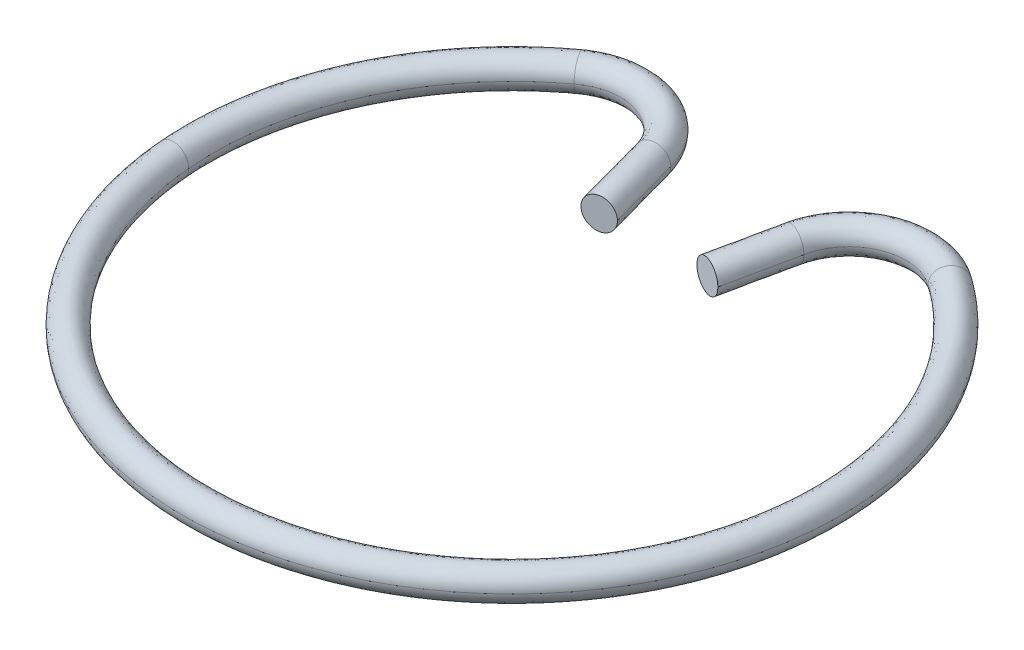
ISO-10303-21;
HEADER;
FILE_DESCRIPTION(('STEP AP214'),'2;1');
FILE_NAME('part.step','',(''),(''),'','','');
FILE_SCHEMA(('AUTOMOTIVE_DESIGN { 1 0 10303 214 1 1 1 1 }'));
ENDSEC;
DATA;
#1=APPLICATION_CONTEXT('core data for automotive mechanical design processes');
#2=APPLICATION_PROTOCOL_DEFINITION('international standard','automotive_design',2000,#1);
#3=PRODUCT_CONTEXT('',#1,'mechanical');
#4=PRODUCT('Part','Part','',(#3));
#5=PRODUCT_RELATED_PRODUCT_CATEGORY('part','',(#4));
#6=PRODUCT_DEFINITION_FORMATION('','',#4);
#7=PRODUCT_DEFINITION_CONTEXT('part definition',#1,'design');
#8=PRODUCT_DEFINITION('design','',#6,#7);
#9=PRODUCT_DEFINITION_SHAPE('','',#8);
#10=(LENGTH_UNIT() NAMED_UNIT(*) SI_UNIT(.MILLI.,.METRE.));
#11=(NAMED_UNIT(*) PLANE_ANGLE_UNIT() SI_UNIT($,.RADIAN.));
#12=(NAMED_UNIT(*) SI_UNIT($,.STERADIAN.) SOLID_ANGLE_UNIT());
#13=UNCERTAINTY_MEASURE_WITH_UNIT(LENGTH_MEASURE(1.E-05),#10,'distance_accuracy_value','');
#14=(GEOMETRIC_REPRESENTATION_CONTEXT(3) GLOBAL_UNCERTAINTY_ASSIGNED_CONTEXT((#13)) GLOBAL_UNIT_ASSIGNED_CONTEXT((#10,
#11,#12)) REPRESENTATION_CONTEXT('',''));
#15=CARTESIAN_POINT('',(0.,0.,0.));
#16=DIRECTION('',(0.,0.,1.));
#17=DIRECTION('',(1.,0.,0.));
#18=AXIS2_PLACEMENT_3D('',#15,#16,#17);
#19=CARTESIAN_POINT('',(1.02879554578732,-0.506055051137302,-5.46280826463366));
#20=DIRECTION('',(-0.288047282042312,0.,0.95761618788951));
#21=DIRECTION('',(0.95761618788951,0.,0.288047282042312));
#22=AXIS2_PLACEMENT_3D('',#19,#20,#21);
#23=PLANE('',#22);
#24=CARTESIAN_POINT('',(1.99221015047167,0.,-5.17301684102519));
#25=CARTESIAN_POINT('',(1.99223302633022,-0.028128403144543,-5.17300996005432));
#26=CARTESIAN_POINT('',(1.98993850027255,-0.0562496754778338,-5.17370014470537));
#27=CARTESIAN_POINT('',(1.98088321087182,-0.111676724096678,-5.17642394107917));
#28=CARTESIAN_POINT('',(1.97412571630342,-0.138983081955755,-5.17845656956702));
#29=CARTESIAN_POINT('',(1.95630846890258,-0.19203482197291,-5.18381592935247));
#30=CARTESIAN_POINT('',(1.94524672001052,-0.217779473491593,-5.18714326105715));
#31=CARTESIAN_POINT('',(1.91914491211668,-0.26695943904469,-5.19499458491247));
#32=CARTESIAN_POINT('',(1.90410563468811,-0.290395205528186,-5.19951834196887));
#33=CARTESIAN_POINT('',(1.87048297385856,-0.334284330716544,-5.20963190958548));
#34=CARTESIAN_POINT('',(1.85190173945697,-0.354739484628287,-5.21522107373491));
#35=CARTESIAN_POINT('',(1.81168798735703,-0.392130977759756,-5.22731721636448));
#36=CARTESIAN_POINT('',(1.79005121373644,-0.409062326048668,-5.23382547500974));
#37=CARTESIAN_POINT('',(1.74439654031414,-0.438865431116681,-5.24755822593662));
#38=CARTESIAN_POINT('',(1.72038234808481,-0.451743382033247,-5.25478160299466));
#39=CARTESIAN_POINT('',(1.67058384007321,-0.473128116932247,-5.2697608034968));
#40=CARTESIAN_POINT('',(1.64479663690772,-0.481627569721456,-5.27751749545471));
#41=CARTESIAN_POINT('',(1.5922212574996,-0.493980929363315,-5.29333196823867));
#42=CARTESIAN_POINT('',(1.56543308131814,-0.497834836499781,-5.30138974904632));
#43=CARTESIAN_POINT('',(1.51166252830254,-0.500785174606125,-5.31756372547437));
#44=CARTESIAN_POINT('',(1.48468054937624,-0.499889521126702,-5.32567980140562));
#45=CARTESIAN_POINT('',(1.43120236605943,-0.493379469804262,-5.34176583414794));
#46=CARTESIAN_POINT('',(1.40470695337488,-0.487757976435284,-5.3497355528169));
#47=CARTESIAN_POINT('',(1.3530318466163,-0.471957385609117,-5.36527922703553));
#48=CARTESIAN_POINT('',(1.32785044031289,-0.461784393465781,-5.37285369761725));
#49=CARTESIAN_POINT('',(1.27946207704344,-0.43716223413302,-5.38740873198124));
#50=CARTESIAN_POINT('',(1.25625650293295,-0.422710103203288,-5.39438887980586));
#51=CARTESIAN_POINT('',(1.21249940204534,-0.389943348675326,-5.4075508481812));
#52=CARTESIAN_POINT('',(1.19194774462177,-0.371628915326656,-5.41373270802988));
#53=CARTESIAN_POINT('',(1.15407941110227,-0.331656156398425,-5.42512335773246));
#54=CARTESIAN_POINT('',(1.1367628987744,-0.309997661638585,-5.43033209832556));
#55=CARTESIAN_POINT('',(1.10585887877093,-0.263952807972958,-5.43962790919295));
#56=CARTESIAN_POINT('',(1.09227117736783,-0.239566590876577,-5.44371503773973));
#57=CARTESIAN_POINT('',(1.06919893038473,-0.188740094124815,-5.45065508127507));
#58=CARTESIAN_POINT('',(1.05971764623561,-0.162298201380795,-5.4535070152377));
#59=CARTESIAN_POINT('',(1.04515907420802,-0.108160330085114,-5.45788617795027));
#60=CARTESIAN_POINT('',(1.04007506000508,-0.0804663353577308,-5.45941542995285));
#61=CARTESIAN_POINT('',(1.03547555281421,-0.0350834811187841,-5.46079894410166));
#62=CARTESIAN_POINT('',(1.03458680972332,-0.0175371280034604,-5.46106627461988));
#63=CARTESIAN_POINT('',(1.03459396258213,0.,-5.46106412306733));
#64=B_SPLINE_CURVE_WITH_KNOTS('',3,(#24,#25,#26,#27,#28,#29,#30,#31,#32,#33,#34,#35,#36,#37,#38,
#39,#40,#41,#42,#43,#44,#45,#46,#47,#48,#49,#50,#51,#52,#53,#54,#55,#56,#57,#58,#59,#60,#61,#62,
#63),.UNSPECIFIED.,.F.,.F.,(4,2,2,2,2,2,2,2,2,2,2,2,2,2,2,2,2,2,2,4),(0.,0.0842731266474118,
0.168484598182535,0.252735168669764,0.3369691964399,0.421152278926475,0.505453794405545,
0.589625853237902,0.673938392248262,0.758250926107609,0.842422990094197,0.926721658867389,
1.01090758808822,1.09515196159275,1.17939218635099,1.26363667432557,1.34787678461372,
1.43218367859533,1.51636138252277,1.56897272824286),.UNSPECIFIED.);
#65=CARTESIAN_POINT('',(1.99221015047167,0.,-5.17301684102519));
#66=VERTEX_POINT('',#65);
#67=CARTESIAN_POINT('',(1.03459396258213,0.,-5.46106412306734));
#68=VERTEX_POINT('',#67);
#69=EDGE_CURVE('E56',#66,#68,#64,.T.);
#70=ORIENTED_EDGE('',*,*,#69,.F.);
#71=CARTESIAN_POINT('',(1.03459396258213,0.,-5.46106412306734));
#72=CARTESIAN_POINT('',(1.03457108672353,0.0281284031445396,-5.46107100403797));
#73=CARTESIAN_POINT('',(1.0368656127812,0.0562496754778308,-5.46038081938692));
#74=CARTESIAN_POINT('',(1.04592090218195,0.111676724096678,-5.45765702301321));
#75=CARTESIAN_POINT('',(1.05267839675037,0.138983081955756,-5.45562439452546));
#76=CARTESIAN_POINT('',(1.0704956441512,0.192034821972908,-5.45026503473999));
#77=CARTESIAN_POINT('',(1.08155739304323,0.217779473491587,-5.44693770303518));
#78=CARTESIAN_POINT('',(1.10765920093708,0.266959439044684,-5.43908637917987));
#79=CARTESIAN_POINT('',(1.12269847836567,0.290395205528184,-5.4345626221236));
#80=CARTESIAN_POINT('',(1.15632113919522,0.33428433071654,-5.42444905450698));
#81=CARTESIAN_POINT('',(1.17490237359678,0.354739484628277,-5.41885989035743));
#82=CARTESIAN_POINT('',(1.21511612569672,0.392130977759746,-5.40676374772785));
#83=CARTESIAN_POINT('',(1.23675289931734,0.409062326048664,-5.40025548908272));
#84=CARTESIAN_POINT('',(1.28240757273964,0.438865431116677,-5.38652273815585));
#85=CARTESIAN_POINT('',(1.30642176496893,0.45174338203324,-5.37929936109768));
#86=CARTESIAN_POINT('',(1.35622027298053,0.47312811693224,-5.36432016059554));
#87=CARTESIAN_POINT('',(1.38200747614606,0.481627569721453,-5.35656346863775));
#88=CARTESIAN_POINT('',(1.43458285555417,0.493980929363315,-5.34074899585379));
#89=CARTESIAN_POINT('',(1.4613710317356,0.49783483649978,-5.33269121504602));
#90=CARTESIAN_POINT('',(1.5151415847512,0.500785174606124,-5.31651723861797));
#91=CARTESIAN_POINT('',(1.54212356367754,0.499889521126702,-5.30840116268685));
#92=CARTESIAN_POINT('',(1.59560174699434,0.493379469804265,-5.29231512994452));
#93=CARTESIAN_POINT('',(1.62209715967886,0.487757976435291,-5.28434541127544));
#94=CARTESIAN_POINT('',(1.67377226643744,0.471957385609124,-5.26880173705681));
#95=CARTESIAN_POINT('',(1.69895367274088,0.461784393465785,-5.26122726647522));
#96=CARTESIAN_POINT('',(1.74734203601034,0.437162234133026,-5.24667223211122));
#97=CARTESIAN_POINT('',(1.7705476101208,0.422710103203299,-5.23969208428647));
#98=CARTESIAN_POINT('',(1.81430471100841,0.389943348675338,-5.22653011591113));
#99=CARTESIAN_POINT('',(1.834856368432,0.371628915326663,-5.22034825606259));
#100=CARTESIAN_POINT('',(1.87272470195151,0.331656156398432,-5.20895760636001));
#101=CARTESIAN_POINT('',(1.89004121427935,0.309997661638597,-5.20374886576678));
#102=CARTESIAN_POINT('',(1.92094523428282,0.263952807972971,-5.19445305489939));
#103=CARTESIAN_POINT('',(1.93453293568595,0.239566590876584,-5.19036592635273));
#104=CARTESIAN_POINT('',(1.95760518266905,0.188740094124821,-5.1834258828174));
#105=CARTESIAN_POINT('',(1.96708646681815,0.162298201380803,-5.18057394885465));
#106=CARTESIAN_POINT('',(1.98164503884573,0.108160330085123,-5.17619478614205));
#107=CARTESIAN_POINT('',(1.9867290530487,0.0804663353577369,-5.17466553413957));
#108=CARTESIAN_POINT('',(1.99132856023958,0.0350834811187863,-5.17328201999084));
#109=CARTESIAN_POINT('',(1.99221730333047,0.0175371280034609,-5.17301468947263));
#110=CARTESIAN_POINT('',(1.99221015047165,0.,-5.17301684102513));
#111=B_SPLINE_CURVE_WITH_KNOTS('',3,(#71,#72,#73,#74,#75,#76,#77,#78,#79,#80,#81,#82,#83,#84,
#85,#86,#87,#88,#89,#90,#91,#92,#93,#94,#95,#96,#97,#98,#99,#100,#101,#102,#103,#104,#105,#106,
#107,#108,#109,#110),.UNSPECIFIED.,.F.,.F.,(4,2,2,2,2,2,2,2,2,2,2,2,2,2,2,2,2,2,2,4),(0.,
0.0842731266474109,0.168484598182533,0.252735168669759,0.336969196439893,0.421152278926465,
0.505453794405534,0.589625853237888,0.673938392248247,0.758250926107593,0.842422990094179,
0.926721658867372,1.01090758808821,1.09515196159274,1.17939218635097,1.26363667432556,
1.34787678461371,1.43218367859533,1.51636138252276,1.56897272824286),.UNSPECIFIED.);
#112=EDGE_CURVE('E22',#68,#66,#111,.T.);
#113=ORIENTED_EDGE('',*,*,#112,.F.);
#114=EDGE_LOOP('',(#70,#113));
#115=FACE_BOUND('',#114,.T.);
#116=ADVANCED_FACE('F17',(#115),#23,.T.);
#117=CARTESIAN_POINT('',(1.03459396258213,0.,-5.46106412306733));
#118=CARTESIAN_POINT('',(1.11473926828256,0.,-5.8394120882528));
#119=CARTESIAN_POINT('',(1.1948845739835,0.,-6.21776005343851));
#120=CARTESIAN_POINT('',(1.31510253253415,0.,-6.78528200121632));
#121=CARTESIAN_POINT('',(1.35517518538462,0.,-6.97445598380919));
#122=CARTESIAN_POINT('',(1.4152841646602,0.,-7.25821695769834));
#123=CARTESIAN_POINT('',(1.43532049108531,0.,-7.35280394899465));
#124=CARTESIAN_POINT('',(1.46537498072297,0.,-7.49468443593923));
#125=CARTESIAN_POINT('',(1.47539314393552,0.,-7.54197793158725));
#126=CARTESIAN_POINT('',(1.49042038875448,0.,-7.61291817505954));
#127=CARTESIAN_POINT('',(1.49542947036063,0.,-7.63656492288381));
#128=CARTESIAN_POINT('',(1.50294309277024,0.,-7.67203504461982));
#129=CARTESIAN_POINT('',(1.50544763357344,0.,-7.68385841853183));
#130=CARTESIAN_POINT('',(1.51045671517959,0.,-7.7075051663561));
#131=CARTESIAN_POINT('',(1.51255115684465,0.,-7.71797083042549));
#132=CARTESIAN_POINT('',(1.51546579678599,0.,-7.73115191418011));
#133=CARTESIAN_POINT('',(1.03459396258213,1.00000000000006,-5.46106412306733));
#134=CARTESIAN_POINT('',(1.11473926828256,1.00000000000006,-5.8394120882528));
#135=CARTESIAN_POINT('',(1.1948845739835,1.00000000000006,-6.21776005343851));
#136=CARTESIAN_POINT('',(1.31510253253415,1.00000000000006,-6.78528200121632));
#137=CARTESIAN_POINT('',(1.35517518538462,1.00000000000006,-6.97445598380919));
#138=CARTESIAN_POINT('',(1.4152841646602,1.00000000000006,-7.25821695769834));
#139=CARTESIAN_POINT('',(1.43532049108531,1.00000000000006,-7.35280394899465));
#140=CARTESIAN_POINT('',(1.46537498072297,1.00000000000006,-7.49468443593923));
#141=CARTESIAN_POINT('',(1.47539314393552,1.00000000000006,-7.54197793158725));
#142=CARTESIAN_POINT('',(1.49042038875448,1.00000000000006,-7.61291817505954));
#143=CARTESIAN_POINT('',(1.49542947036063,1.00000000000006,-7.63656492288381));
#144=CARTESIAN_POINT('',(1.50294309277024,1.00000000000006,-7.67203504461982));
#145=CARTESIAN_POINT('',(1.50544763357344,1.00000000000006,-7.68385841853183));
#146=CARTESIAN_POINT('',(1.51045671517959,1.00000000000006,-7.7075051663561));
#147=CARTESIAN_POINT('',(1.51255115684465,1.00000000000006,-7.71797083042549));
#148=CARTESIAN_POINT('',(1.51546579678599,1.00000000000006,-7.73115191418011));
#149=CARTESIAN_POINT('',(1.99221015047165,1.00000000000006,-5.17301684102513));
#150=CARTESIAN_POINT('',(2.07235545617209,1.00000000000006,-5.55136480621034));
#151=CARTESIAN_POINT('',(2.15250076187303,1.00000000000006,-5.92971277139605));
#152=CARTESIAN_POINT('',(2.27271872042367,1.00000000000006,-6.49723471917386));
#153=CARTESIAN_POINT('',(2.31279137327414,1.00000000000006,-6.68640870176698));
#154=CARTESIAN_POINT('',(2.37290035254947,1.00000000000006,-6.97016967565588));
#155=CARTESIAN_POINT('',(2.39293667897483,1.00000000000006,-7.06475666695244));
#156=CARTESIAN_POINT('',(2.42299116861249,1.00000000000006,-7.20663715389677));
#157=CARTESIAN_POINT('',(2.43300933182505,1.00000000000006,-7.25393064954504));
#158=CARTESIAN_POINT('',(2.44803657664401,1.00000000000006,-7.32487089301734));
#159=CARTESIAN_POINT('',(2.45304565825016,1.00000000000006,-7.34851764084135));
#160=CARTESIAN_POINT('',(2.46055928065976,1.00000000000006,-7.38398776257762));
#161=CARTESIAN_POINT('',(2.46306382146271,1.00000000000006,-7.39581113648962));
#162=CARTESIAN_POINT('',(2.46807290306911,1.00000000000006,-7.41945788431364));
#163=CARTESIAN_POINT('',(2.47093175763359,1.00000000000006,-7.4324628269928));
#164=CARTESIAN_POINT('',(2.47308198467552,1.00000000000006,-7.44310463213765));
#165=CARTESIAN_POINT('',(1.99221015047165,0.,-5.17301684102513));
#166=CARTESIAN_POINT('',(2.07235545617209,0.,-5.55136480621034));
#167=CARTESIAN_POINT('',(2.15250076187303,0.,-5.92971277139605));
#168=CARTESIAN_POINT('',(2.27271872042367,0.,-6.49723471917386));
#169=CARTESIAN_POINT('',(2.31279137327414,0.,-6.68640870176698));
#170=CARTESIAN_POINT('',(2.37290035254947,0.,-6.97016967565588));
#171=CARTESIAN_POINT('',(2.39293667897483,0.,-7.06475666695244));
#172=CARTESIAN_POINT('',(2.42299116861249,0.,-7.20663715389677));
#173=CARTESIAN_POINT('',(2.43300933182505,0.,-7.25393064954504));
#174=CARTESIAN_POINT('',(2.44803657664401,0.,-7.32487089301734));
#175=CARTESIAN_POINT('',(2.45304565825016,0.,-7.34851764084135));
#176=CARTESIAN_POINT('',(2.46055928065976,0.,-7.38398776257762));
#177=CARTESIAN_POINT('',(2.46306382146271,0.,-7.39581113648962));
#178=CARTESIAN_POINT('',(2.46807290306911,0.,-7.41945788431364));
#179=CARTESIAN_POINT('',(2.47093175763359,0.,-7.4324628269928));
#180=CARTESIAN_POINT('',(2.47308198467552,0.,-7.44310463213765));
#181=(BOUNDED_SURFACE() B_SPLINE_SURFACE(3,3,((#117,#118,#119,#120,#121,#122,#123,#124,#125,
#126,#127,#128,#129,#130,#131,#132),(#133,#134,#135,#136,#137,#138,#139,#140,#141,#142,#143,
#144,#145,#146,#147,#148),(#149,#150,#151,#152,#153,#154,#155,#156,#157,#158,#159,#160,#161,
#162,#163,#164),(#165,#166,#167,#168,#169,#170,#171,#172,#173,#174,#175,#176,#177,#178,#179,
#180)),.UNSPECIFIED.,.F.,.F.,.F.) B_SPLINE_SURFACE_WITH_KNOTS((4,4),(4,2,2,2,2,2,2,4),(0.5,1.),
(0.,0.01813919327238,0.02720878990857,0.03174358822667,0.03401098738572,0.03514468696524,
0.035711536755,0.03627838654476),
.UNSPECIFIED.) GEOMETRIC_REPRESENTATION_ITEM() RATIONAL_B_SPLINE_SURFACE(((1.,1.,1.,1.,1.,1.,1.,
1.,1.,1.,1.,1.,1.,1.,1.,1.),(0.33333333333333,0.33333333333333,0.33333333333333,
0.33333333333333,0.33333333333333,0.33333333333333,0.33333333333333,0.33333333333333,
0.33333333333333,0.33333333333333,0.33333333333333,0.33333333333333,0.33333333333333,
0.33333333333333,0.33333333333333,0.33333333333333),(0.33333333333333,0.33333333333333,
0.33333333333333,0.33333333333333,0.33333333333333,0.33333333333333,0.33333333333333,
0.33333333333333,0.33333333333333,0.33333333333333,0.33333333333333,0.33333333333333,
0.33333333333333,0.33333333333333,0.33333333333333,0.33333333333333),(1.,1.,1.,1.,1.,1.,1.,1.,
1.,1.,1.,1.,1.,1.,1.,1.))) REPRESENTATION_ITEM('') SURFACE());
#182=CARTESIAN_POINT('',(1.99221015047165,0.,-5.17301684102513));
#183=CARTESIAN_POINT('',(2.07235545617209,0.,-5.55136480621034));
#184=CARTESIAN_POINT('',(2.15250076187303,0.,-5.92971277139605));
#185=CARTESIAN_POINT('',(2.27271872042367,0.,-6.49723471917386));
#186=CARTESIAN_POINT('',(2.31279137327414,0.,-6.68640870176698));
#187=CARTESIAN_POINT('',(2.37290035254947,0.,-6.97016967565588));
#188=CARTESIAN_POINT('',(2.39293667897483,0.,-7.06475666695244));
#189=CARTESIAN_POINT('',(2.42299116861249,0.,-7.20663715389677));
#190=CARTESIAN_POINT('',(2.43300933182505,0.,-7.25393064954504));
#191=CARTESIAN_POINT('',(2.44803657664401,0.,-7.32487089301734));
#192=CARTESIAN_POINT('',(2.45304565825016,0.,-7.34851764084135));
#193=CARTESIAN_POINT('',(2.46055928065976,0.,-7.38398776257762));
#194=CARTESIAN_POINT('',(2.46306382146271,0.,-7.39581113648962));
#195=CARTESIAN_POINT('',(2.46807290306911,0.,-7.41945788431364));
#196=CARTESIAN_POINT('',(2.47093175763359,0.,-7.4324628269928));
#197=CARTESIAN_POINT('',(2.47308198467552,0.,-7.44310463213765));
#198=B_SPLINE_CURVE_WITH_KNOTS('',3,(#182,#183,#184,#185,#186,#187,#188,#189,#190,#191,#192,
#193,#194,#195,#196,#197),.UNSPECIFIED.,.F.,.F.,(4,2,2,2,2,2,2,4),(0.,0.01813919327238,
0.02720878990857,0.03174358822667,0.03401098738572,0.03514468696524,0.035711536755,
0.03627838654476),.UNSPECIFIED.);
#199=CARTESIAN_POINT('',(2.47308198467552,0.,-7.44310463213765));
#200=VERTEX_POINT('',#199);
#201=EDGE_CURVE('E66',#200,#66,#198,.F.);
#202=CARTESIAN_POINT('',(1.99427389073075,0.,-7.58712827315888));
#203=DIRECTION('',(-0.288047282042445,0.,0.95761618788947));
#204=DIRECTION('',(0.95761618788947,0.,0.288047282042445));
#205=AXIS2_PLACEMENT_3D('',#202,#203,#204);
#206=CIRCLE('',#205,0.500000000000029);
#207=CARTESIAN_POINT('',(1.51546579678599,0.,-7.73115191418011));
#208=VERTEX_POINT('',#207);
#209=EDGE_CURVE('E61',#200,#208,#206,.T.);
#210=CARTESIAN_POINT('',(1.03459396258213,0.,-5.46106412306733));
#211=CARTESIAN_POINT('',(1.11473926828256,0.,-5.8394120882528));
#212=CARTESIAN_POINT('',(1.1948845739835,0.,-6.21776005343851));
#213=CARTESIAN_POINT('',(1.31510253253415,0.,-6.78528200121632));
#214=CARTESIAN_POINT('',(1.35517518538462,0.,-6.97445598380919));
#215=CARTESIAN_POINT('',(1.4152841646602,0.,-7.25821695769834));
#216=CARTESIAN_POINT('',(1.43532049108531,0.,-7.35280394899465));
#217=CARTESIAN_POINT('',(1.46537498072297,0.,-7.49468443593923));
#218=CARTESIAN_POINT('',(1.47539314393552,0.,-7.54197793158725));
#219=CARTESIAN_POINT('',(1.49042038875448,0.,-7.61291817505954));
#220=CARTESIAN_POINT('',(1.49542947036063,0.,-7.63656492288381));
#221=CARTESIAN_POINT('',(1.50294309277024,0.,-7.67203504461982));
#222=CARTESIAN_POINT('',(1.50544763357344,0.,-7.68385841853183));
#223=CARTESIAN_POINT('',(1.51045671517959,0.,-7.7075051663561));
#224=CARTESIAN_POINT('',(1.51255115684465,0.,-7.71797083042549));
#225=CARTESIAN_POINT('',(1.51546579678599,0.,-7.73115191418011));
#226=B_SPLINE_CURVE_WITH_KNOTS('',3,(#210,#211,#212,#213,#214,#215,#216,#217,#218,#219,#220,
#221,#222,#223,#224,#225),.UNSPECIFIED.,.F.,.F.,(4,2,2,2,2,2,2,4),(0.,0.01813919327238,
0.02720878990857,0.03174358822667,0.03401098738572,0.03514468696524,0.035711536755,
0.03627838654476),.UNSPECIFIED.);
#227=EDGE_CURVE('E60',#68,#208,#226,.T.);
#228=ORIENTED_EDGE('',*,*,#201,.F.);
#229=ORIENTED_EDGE('',*,*,#209,.T.);
#230=ORIENTED_EDGE('',*,*,#227,.F.);
#231=ORIENTED_EDGE('',*,*,#112,.T.);
#232=EDGE_LOOP('',(#228,#229,#230,#231));
#233=FACE_BOUND('',#232,.T.);
#234=ADVANCED_FACE('F64',(#233),#181,.T.);
#235=CARTESIAN_POINT('',(1.99221015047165,0.,-5.17301684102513));
#236=CARTESIAN_POINT('',(2.07235545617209,0.,-5.55136480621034));
#237=CARTESIAN_POINT('',(2.15250076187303,0.,-5.92971277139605));
#238=CARTESIAN_POINT('',(2.27271872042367,0.,-6.49723471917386));
#239=CARTESIAN_POINT('',(2.31279137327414,0.,-6.68640870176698));
#240=CARTESIAN_POINT('',(2.37290035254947,0.,-6.97016967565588));
#241=CARTESIAN_POINT('',(2.39293667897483,0.,-7.06475666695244));
#242=CARTESIAN_POINT('',(2.42299116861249,0.,-7.20663715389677));
#243=CARTESIAN_POINT('',(2.43300933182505,0.,-7.25393064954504));
#244=CARTESIAN_POINT('',(2.44803657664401,0.,-7.32487089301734));
#245=CARTESIAN_POINT('',(2.45304565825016,0.,-7.34851764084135));
#246=CARTESIAN_POINT('',(2.46055928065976,0.,-7.38398776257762));
#247=CARTESIAN_POINT('',(2.46306382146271,0.,-7.39581113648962));
#248=CARTESIAN_POINT('',(2.46807290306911,0.,-7.41945788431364));
#249=CARTESIAN_POINT('',(2.47093175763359,0.,-7.4324628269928));
#250=CARTESIAN_POINT('',(2.47308198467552,0.,-7.44310463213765));
#251=CARTESIAN_POINT('',(1.99221015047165,-1.00000000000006,-5.17301684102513));
#252=CARTESIAN_POINT('',(2.07235545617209,-1.00000000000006,-5.55136480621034));
#253=CARTESIAN_POINT('',(2.15250076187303,-1.00000000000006,-5.92971277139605));
#254=CARTESIAN_POINT('',(2.27271872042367,-1.00000000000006,-6.49723471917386));
#255=CARTESIAN_POINT('',(2.31279137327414,-1.00000000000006,-6.68640870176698));
#256=CARTESIAN_POINT('',(2.37290035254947,-1.00000000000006,-6.97016967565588));
#257=CARTESIAN_POINT('',(2.39293667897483,-1.00000000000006,-7.06475666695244));
#258=CARTESIAN_POINT('',(2.42299116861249,-1.00000000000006,-7.20663715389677));
#259=CARTESIAN_POINT('',(2.43300933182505,-1.00000000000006,-7.25393064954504));
#260=CARTESIAN_POINT('',(2.44803657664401,-1.00000000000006,-7.32487089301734));
#261=CARTESIAN_POINT('',(2.45304565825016,-1.00000000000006,-7.34851764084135));
#262=CARTESIAN_POINT('',(2.46055928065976,-1.00000000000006,-7.38398776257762));
#263=CARTESIAN_POINT('',(2.46306382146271,-1.00000000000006,-7.39581113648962));
#264=CARTESIAN_POINT('',(2.46807290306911,-1.00000000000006,-7.41945788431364));
#265=CARTESIAN_POINT('',(2.47093175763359,-1.00000000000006,-7.4324628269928));
#266=CARTESIAN_POINT('',(2.47308198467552,-1.00000000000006,-7.44310463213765));
#267=CARTESIAN_POINT('',(1.03459396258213,-1.00000000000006,-5.46106412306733));
#268=CARTESIAN_POINT('',(1.11473926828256,-1.00000000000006,-5.8394120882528));
#269=CARTESIAN_POINT('',(1.1948845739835,-1.00000000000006,-6.21776005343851));
#270=CARTESIAN_POINT('',(1.31510253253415,-1.00000000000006,-6.78528200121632));
#271=CARTESIAN_POINT('',(1.35517518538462,-1.00000000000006,-6.97445598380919));
#272=CARTESIAN_POINT('',(1.4152841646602,-1.00000000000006,-7.25821695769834));
#273=CARTESIAN_POINT('',(1.43532049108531,-1.00000000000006,-7.35280394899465));
#274=CARTESIAN_POINT('',(1.46537498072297,-1.00000000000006,-7.49468443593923));
#275=CARTESIAN_POINT('',(1.47539314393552,-1.00000000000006,-7.54197793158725));
#276=CARTESIAN_POINT('',(1.49042038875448,-1.00000000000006,-7.61291817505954));
#277=CARTESIAN_POINT('',(1.49542947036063,-1.00000000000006,-7.63656492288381));
#278=CARTESIAN_POINT('',(1.50294309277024,-1.00000000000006,-7.67203504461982));
#279=CARTESIAN_POINT('',(1.50544763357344,-1.00000000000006,-7.68385841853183));
#280=CARTESIAN_POINT('',(1.51045671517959,-1.00000000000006,-7.7075051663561));
#281=CARTESIAN_POINT('',(1.51255115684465,-1.00000000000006,-7.71797083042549));
#282=CARTESIAN_POINT('',(1.51546579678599,-1.00000000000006,-7.73115191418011));
#283=CARTESIAN_POINT('',(1.03459396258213,0.,-5.46106412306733));
#284=CARTESIAN_POINT('',(1.11473926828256,0.,-5.8394120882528));
#285=CARTESIAN_POINT('',(1.1948845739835,0.,-6.21776005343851));
#286=CARTESIAN_POINT('',(1.31510253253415,0.,-6.78528200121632));
#287=CARTESIAN_POINT('',(1.35517518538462,0.,-6.97445598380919));
#288=CARTESIAN_POINT('',(1.4152841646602,0.,-7.25821695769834));
#289=CARTESIAN_POINT('',(1.43532049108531,0.,-7.35280394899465));
#290=CARTESIAN_POINT('',(1.46537498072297,0.,-7.49468443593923));
#291=CARTESIAN_POINT('',(1.47539314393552,0.,-7.54197793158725));
#292=CARTESIAN_POINT('',(1.49042038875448,0.,-7.61291817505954));
#293=CARTESIAN_POINT('',(1.49542947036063,0.,-7.63656492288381));
#294=CARTESIAN_POINT('',(1.50294309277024,0.,-7.67203504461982));
#295=CARTESIAN_POINT('',(1.50544763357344,0.,-7.68385841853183));
#296=CARTESIAN_POINT('',(1.51045671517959,0.,-7.7075051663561));
#297=CARTESIAN_POINT('',(1.51255115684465,0.,-7.71797083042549));
#298=CARTESIAN_POINT('',(1.51546579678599,0.,-7.73115191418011));
#299=(BOUNDED_SURFACE() B_SPLINE_SURFACE(3,3,((#235,#236,#237,#238,#239,#240,#241,#242,#243,
#244,#245,#246,#247,#248,#249,#250),(#251,#252,#253,#254,#255,#256,#257,#258,#259,#260,#261,
#262,#263,#264,#265,#266),(#267,#268,#269,#270,#271,#272,#273,#274,#275,#276,#277,#278,#279,
#280,#281,#282),(#283,#284,#285,#286,#287,#288,#289,#290,#291,#292,#293,#294,#295,#296,#297,
#298)),.UNSPECIFIED.,.F.,.F.,.F.) B_SPLINE_SURFACE_WITH_KNOTS((4,4),(4,2,2,2,2,2,2,4),(0.,0.5),
(0.,0.01813919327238,0.02720878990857,0.03174358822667,0.03401098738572,0.03514468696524,
0.035711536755,0.03627838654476),
.UNSPECIFIED.) GEOMETRIC_REPRESENTATION_ITEM() RATIONAL_B_SPLINE_SURFACE(((1.,1.,1.,1.,1.,1.,1.,
1.,1.,1.,1.,1.,1.,1.,1.,1.),(0.33333333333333,0.33333333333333,0.33333333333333,
0.33333333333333,0.33333333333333,0.33333333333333,0.33333333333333,0.33333333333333,
0.33333333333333,0.33333333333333,0.33333333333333,0.33333333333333,0.33333333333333,
0.33333333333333,0.33333333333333,0.33333333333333),(0.33333333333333,0.33333333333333,
0.33333333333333,0.33333333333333,0.33333333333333,0.33333333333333,0.33333333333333,
0.33333333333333,0.33333333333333,0.33333333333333,0.33333333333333,0.33333333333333,
0.33333333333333,0.33333333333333,0.33333333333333,0.33333333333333),(1.,1.,1.,1.,1.,1.,1.,1.,
1.,1.,1.,1.,1.,1.,1.,1.))) REPRESENTATION_ITEM('') SURFACE());
#300=CARTESIAN_POINT('',(1.99427389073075,0.,-7.58712827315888));
#301=DIRECTION('',(0.288047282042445,0.,-0.95761618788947));
#302=DIRECTION('',(-0.95761618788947,0.,-0.288047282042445));
#303=AXIS2_PLACEMENT_3D('',#300,#301,#302);
#304=CIRCLE('',#303,0.500000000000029);
#305=EDGE_CURVE('E70',#200,#208,#304,.T.);
#306=ORIENTED_EDGE('',*,*,#305,.F.);
#307=ORIENTED_EDGE('',*,*,#201,.T.);
#308=ORIENTED_EDGE('',*,*,#69,.T.);
#309=ORIENTED_EDGE('',*,*,#227,.T.);
#310=EDGE_LOOP('',(#306,#307,#308,#309));
#311=FACE_BOUND('',#310,.T.);
#312=ADVANCED_FACE('F68',(#311),#299,.T.);
#313=CARTESIAN_POINT('',(1.51546579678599,0.,-7.73115191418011));
#314=CARTESIAN_POINT('',(1.51830640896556,0.,-7.74399821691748));
#315=CARTESIAN_POINT('',(1.52204994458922,0.,-7.75946687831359));
#316=CARTESIAN_POINT('',(1.52896263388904,0.,-7.7877021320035));
#317=CARTESIAN_POINT('',(1.53252836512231,0.,-7.80179267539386));
#318=CARTESIAN_POINT('',(1.54355249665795,0.,-7.84397835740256));
#319=CARTESIAN_POINT('',(1.55133786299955,0.,-7.87198756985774));
#320=CARTESIAN_POINT('',(1.5759911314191,0.,-7.95563335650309));
#321=CARTESIAN_POINT('',(1.59415667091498,0.,-8.01088821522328));
#322=CARTESIAN_POINT('',(1.65374226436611,0.,-8.17481432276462));
#323=CARTESIAN_POINT('',(1.70025887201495,0.,-8.28164536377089));
#324=CARTESIAN_POINT('',(1.8591083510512,0.,-8.5922771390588));
#325=CARTESIAN_POINT('',(1.99079297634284,0.,-8.78609727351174));
#326=CARTESIAN_POINT('',(2.45127080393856,0.,-9.31025171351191));
#327=CARTESIAN_POINT('',(2.84638503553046,0.,-9.5816485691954));
#328=CARTESIAN_POINT('',(3.71904093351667,0.,-9.90391286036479));
#329=CARTESIAN_POINT('',(4.19571332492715,0.,-9.95445928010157));
#330=CARTESIAN_POINT('',(4.88633948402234,0.,-9.85539760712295));
#331=CARTESIAN_POINT('',(5.1123898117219,0.,-9.79368590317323));
#332=CARTESIAN_POINT('',(5.4350061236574,0.,-9.66085528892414));
#333=CARTESIAN_POINT('',(5.53979221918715,0.,-9.60989903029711));
#334=CARTESIAN_POINT('',(5.69161918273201,0.,-9.52404575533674));
#335=CARTESIAN_POINT('',(5.74133729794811,0.,-9.49385974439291));
#336=CARTESIAN_POINT('',(5.81443852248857,0.,-9.44631384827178));
#337=CARTESIAN_POINT('',(5.83855971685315,0.,-9.43008745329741));
#338=CARTESIAN_POINT('',(5.87435624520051,0.,-9.40519223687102));
#339=CARTESIAN_POINT('',(5.88622421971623,0.,-9.39680122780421));
#340=CARTESIAN_POINT('',(5.90982911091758,0.,-9.379835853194));
#341=CARTESIAN_POINT('',(5.92237717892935,0.,-9.37056782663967));
#342=CARTESIAN_POINT('',(5.9332361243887,0.,-9.36259636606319));
#343=CARTESIAN_POINT('',(1.51546579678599,1.00000000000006,-7.73115191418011));
#344=CARTESIAN_POINT('',(1.51830640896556,1.00000000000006,-7.74399821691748));
#345=CARTESIAN_POINT('',(1.52204994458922,1.00000000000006,-7.75946687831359));
#346=CARTESIAN_POINT('',(1.52896263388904,1.00000000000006,-7.7877021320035));
#347=CARTESIAN_POINT('',(1.53252836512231,1.00000000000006,-7.80179267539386));
#348=CARTESIAN_POINT('',(1.54355249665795,1.00000000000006,-7.84397835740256));
#349=CARTESIAN_POINT('',(1.55133786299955,1.00000000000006,-7.87198756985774));
#350=CARTESIAN_POINT('',(1.5759911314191,1.00000000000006,-7.95563335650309));
#351=CARTESIAN_POINT('',(1.59415667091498,1.00000000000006,-8.01088821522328));
#352=CARTESIAN_POINT('',(1.65374226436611,1.00000000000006,-8.17481432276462));
#353=CARTESIAN_POINT('',(1.70025887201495,1.00000000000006,-8.28164536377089));
#354=CARTESIAN_POINT('',(1.8591083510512,1.00000000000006,-8.5922771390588));
#355=CARTESIAN_POINT('',(1.99079297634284,1.00000000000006,-8.78609727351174));
#356=CARTESIAN_POINT('',(2.45127080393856,1.00000000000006,-9.31025171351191));
#357=CARTESIAN_POINT('',(2.84638503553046,1.00000000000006,-9.5816485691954));
#358=CARTESIAN_POINT('',(3.71904093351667,1.00000000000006,-9.90391286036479));
#359=CARTESIAN_POINT('',(4.19571332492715,1.00000000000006,-9.95445928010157));
#360=CARTESIAN_POINT('',(4.88633948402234,1.00000000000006,-9.85539760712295));
#361=CARTESIAN_POINT('',(5.1123898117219,1.00000000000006,-9.79368590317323));
#362=CARTESIAN_POINT('',(5.4350061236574,1.00000000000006,-9.66085528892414));
#363=CARTESIAN_POINT('',(5.53979221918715,1.00000000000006,-9.60989903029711));
#364=CARTESIAN_POINT('',(5.69161918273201,1.00000000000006,-9.52404575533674));
#365=CARTESIAN_POINT('',(5.74133729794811,1.00000000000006,-9.49385974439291));
#366=CARTESIAN_POINT('',(5.81443852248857,1.00000000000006,-9.44631384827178));
#367=CARTESIAN_POINT('',(5.83855971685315,1.00000000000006,-9.43008745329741));
#368=CARTESIAN_POINT('',(5.87435624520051,1.00000000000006,-9.40519223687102));
#369=CARTESIAN_POINT('',(5.88622421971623,1.00000000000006,-9.39680122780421));
#370=CARTESIAN_POINT('',(5.90982911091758,1.00000000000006,-9.379835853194));
#371=CARTESIAN_POINT('',(5.92237717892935,1.00000000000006,-9.37056782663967));
#372=CARTESIAN_POINT('',(5.9332361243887,1.00000000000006,-9.36259636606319));
#373=CARTESIAN_POINT('',(2.47308198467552,1.00000000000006,-7.44310463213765));
#374=CARTESIAN_POINT('',(2.47517759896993,1.00000000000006,-7.45347615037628));
#375=CARTESIAN_POINT('',(2.47664997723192,1.00000000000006,-7.46153149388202));
#376=CARTESIAN_POINT('',(2.48043185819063,1.00000000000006,-7.47991481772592));
#377=CARTESIAN_POINT('',(2.48239402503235,1.00000000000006,-7.48909163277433));
#378=CARTESIAN_POINT('',(2.4884935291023,1.00000000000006,-7.51657447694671));
#379=CARTESIAN_POINT('',(2.49284388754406,1.00000000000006,-7.53483291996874));
#380=CARTESIAN_POINT('',(2.50674106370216,1.00000000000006,-7.5893930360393));
#381=CARTESIAN_POINT('',(2.51713428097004,1.00000000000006,-7.62547959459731));
#382=CARTESIAN_POINT('',(2.55164147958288,1.00000000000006,-7.73267532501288));
#383=CARTESIAN_POINT('',(2.57908793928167,1.00000000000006,-7.80271961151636));
#384=CARTESIAN_POINT('',(2.6741162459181,1.00000000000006,-8.0069535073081));
#385=CARTESIAN_POINT('',(2.75442349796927,1.00000000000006,-8.13516846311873));
#386=CARTESIAN_POINT('',(3.03893296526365,1.00000000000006,-8.4844110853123));
#387=CARTESIAN_POINT('',(3.28734086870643,1.00000000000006,-8.66900542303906));
#388=CARTESIAN_POINT('',(3.8426353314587,1.00000000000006,-8.89788901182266));
#389=CARTESIAN_POINT('',(4.14896874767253,1.00000000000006,-8.94195026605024));
#390=CARTESIAN_POINT('',(4.59693776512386,1.00000000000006,-8.89462368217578));
#391=CARTESIAN_POINT('',(4.74426690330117,1.00000000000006,-8.86023684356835));
#392=CARTESIAN_POINT('',(4.95560825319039,1.00000000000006,-8.78228367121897));
#393=CARTESIAN_POINT('',(5.02443978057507,1.00000000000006,-8.75192364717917));
#394=CARTESIAN_POINT('',(5.12446008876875,1.00000000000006,-8.70017802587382));
#395=CARTESIAN_POINT('',(5.15726307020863,1.00000000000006,-8.68189625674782));
#396=CARTESIAN_POINT('',(5.20556971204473,1.00000000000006,-8.65297556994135));
#397=CARTESIAN_POINT('',(5.22152235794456,1.00000000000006,-8.64308570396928));
#398=CARTESIAN_POINT('',(5.24521610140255,1.00000000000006,-8.62788316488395));
#399=CARTESIAN_POINT('',(5.25307481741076,1.00000000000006,-8.62275436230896));
#400=CARTESIAN_POINT('',(5.26871209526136,1.00000000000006,-8.61237530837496));
#401=CARTESIAN_POINT('',(5.27578397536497,1.00000000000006,-8.60772693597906));
#402=CARTESIAN_POINT('',(5.28422828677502,1.00000000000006,-8.60181464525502));
#403=CARTESIAN_POINT('',(2.47308198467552,0.,-7.44310463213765));
#404=CARTESIAN_POINT('',(2.47517759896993,0.,-7.45347615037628));
#405=CARTESIAN_POINT('',(2.47664997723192,0.,-7.46153149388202));
#406=CARTESIAN_POINT('',(2.48043185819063,0.,-7.47991481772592));
#407=CARTESIAN_POINT('',(2.48239402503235,0.,-7.48909163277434));
#408=CARTESIAN_POINT('',(2.4884935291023,0.,-7.51657447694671));
#409=CARTESIAN_POINT('',(2.49284388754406,0.,-7.53483291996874));
#410=CARTESIAN_POINT('',(2.50674106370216,0.,-7.5893930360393));
#411=CARTESIAN_POINT('',(2.51713428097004,0.,-7.62547959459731));
#412=CARTESIAN_POINT('',(2.55164147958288,0.,-7.73267532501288));
#413=CARTESIAN_POINT('',(2.57908793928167,0.,-7.80271961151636));
#414=CARTESIAN_POINT('',(2.6741162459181,0.,-8.0069535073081));
#415=CARTESIAN_POINT('',(2.75442349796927,0.,-8.13516846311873));
#416=CARTESIAN_POINT('',(3.03893296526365,0.,-8.4844110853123));
#417=CARTESIAN_POINT('',(3.28734086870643,0.,-8.66900542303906));
#418=CARTESIAN_POINT('',(3.8426353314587,0.,-8.89788901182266));
#419=CARTESIAN_POINT('',(4.14896874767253,0.,-8.94195026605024));
#420=CARTESIAN_POINT('',(4.59693776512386,0.,-8.89462368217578));
#421=CARTESIAN_POINT('',(4.74426690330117,0.,-8.86023684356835));
#422=CARTESIAN_POINT('',(4.95560825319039,0.,-8.78228367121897));
#423=CARTESIAN_POINT('',(5.02443978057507,0.,-8.75192364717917));
#424=CARTESIAN_POINT('',(5.12446008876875,0.,-8.70017802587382));
#425=CARTESIAN_POINT('',(5.15726307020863,0.,-8.68189625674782));
#426=CARTESIAN_POINT('',(5.20556971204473,0.,-8.65297556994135));
#427=CARTESIAN_POINT('',(5.22152235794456,0.,-8.64308570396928));
#428=CARTESIAN_POINT('',(5.24521610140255,0.,-8.62788316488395));
#429=CARTESIAN_POINT('',(5.25307481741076,0.,-8.62275436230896));
#430=CARTESIAN_POINT('',(5.26871209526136,0.,-8.61237530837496));
#431=CARTESIAN_POINT('',(5.27578397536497,0.,-8.60772693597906));
#432=CARTESIAN_POINT('',(5.28422828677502,0.,-8.60181464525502));
#433=(BOUNDED_SURFACE() B_SPLINE_SURFACE(3,3,((#313,#314,#315,#316,#317,#318,#319,#320,#321,
#322,#323,#324,#325,#326,#327,#328,#329,#330,#331,#332,#333,#334,#335,#336,#337,#338,#339,#340,
#341,#342),(#343,#344,#345,#346,#347,#348,#349,#350,#351,#352,#353,#354,#355,#356,#357,#358,
#359,#360,#361,#362,#363,#364,#365,#366,#367,#368,#369,#370,#371,#372),(#373,#374,#375,#376,
#377,#378,#379,#380,#381,#382,#383,#384,#385,#386,#387,#388,#389,#390,#391,#392,#393,#394,#395,
#396,#397,#398,#399,#400,#401,#402),(#403,#404,#405,#406,#407,#408,#409,#410,#411,#412,#413,
#414,#415,#416,#417,#418,#419,#420,#421,#422,#423,#424,#425,#426,#427,#428,#429,#430,#431,
#432)),.UNSPECIFIED.,.F.,.F.,.F.) B_SPLINE_SURFACE_WITH_KNOTS((4,4),(4,2,2,2,2,2,2,2,2,2,2,2,2,
2,4),(0.5,1.),(0.03627838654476,0.03683083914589,0.03738329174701,0.03848819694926,
0.04069800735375,0.04511762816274,0.05395686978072,0.07163535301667,0.08931383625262,
0.0981530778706,0.10257269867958,0.10478250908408,0.10588741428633,0.10643986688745,
0.10699231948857),.UNSPECIFIED.) GEOMETRIC_REPRESENTATION_ITEM() RATIONAL_B_SPLINE_SURFACE(((1.,
1.,1.,1.,1.,1.,1.,1.,1.,1.,1.,1.,1.,1.,1.,1.,1.,1.,1.,1.,1.,1.,1.,1.,1.,1.,1.,1.,1.,1.),
(0.33333333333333,0.33333333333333,0.33333333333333,0.33333333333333,0.33333333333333,
0.33333333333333,0.33333333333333,0.33333333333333,0.33333333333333,0.33333333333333,
0.33333333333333,0.33333333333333,0.33333333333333,0.33333333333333,0.33333333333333,
0.33333333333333,0.33333333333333,0.33333333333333,0.33333333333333,0.33333333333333,
0.33333333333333,0.33333333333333,0.33333333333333,0.33333333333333,0.33333333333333,
0.33333333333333,0.33333333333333,0.33333333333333,0.33333333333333,0.33333333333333),
(0.33333333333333,0.33333333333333,0.33333333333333,0.33333333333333,0.33333333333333,
0.33333333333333,0.33333333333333,0.33333333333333,0.33333333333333,0.33333333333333,
0.33333333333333,0.33333333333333,0.33333333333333,0.33333333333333,0.33333333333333,
0.33333333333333,0.33333333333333,0.33333333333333,0.33333333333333,0.33333333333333,
0.33333333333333,0.33333333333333,0.33333333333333,0.33333333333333,0.33333333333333,
0.33333333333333,0.33333333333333,0.33333333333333,0.33333333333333,0.33333333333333),(1.,1.,1.,
1.,1.,1.,1.,1.,1.,1.,1.,1.,1.,1.,1.,1.,1.,1.,1.,1.,1.,1.,1.,1.,1.,1.,1.,1.,1.,1.))) REPRESENTATION_ITEM('') SURFACE());
#434=CARTESIAN_POINT('',(2.47308198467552,0.,-7.44310463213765));
#435=CARTESIAN_POINT('',(2.47517759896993,0.,-7.45347615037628));
#436=CARTESIAN_POINT('',(2.47664997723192,0.,-7.46153149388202));
#437=CARTESIAN_POINT('',(2.48043185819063,0.,-7.47991481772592));
#438=CARTESIAN_POINT('',(2.48239402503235,0.,-7.48909163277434));
#439=CARTESIAN_POINT('',(2.4884935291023,0.,-7.51657447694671));
#440=CARTESIAN_POINT('',(2.49284388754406,0.,-7.53483291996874));
#441=CARTESIAN_POINT('',(2.50674106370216,0.,-7.5893930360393));
#442=CARTESIAN_POINT('',(2.51713428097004,0.,-7.62547959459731));
#443=CARTESIAN_POINT('',(2.55164147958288,0.,-7.73267532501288));
#444=CARTESIAN_POINT('',(2.57908793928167,0.,-7.80271961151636));
#445=CARTESIAN_POINT('',(2.6741162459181,0.,-8.0069535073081));
#446=CARTESIAN_POINT('',(2.75442349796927,0.,-8.13516846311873));
#447=CARTESIAN_POINT('',(3.03893296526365,0.,-8.4844110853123));
#448=CARTESIAN_POINT('',(3.28734086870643,0.,-8.66900542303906));
#449=CARTESIAN_POINT('',(3.8426353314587,0.,-8.89788901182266));
#450=CARTESIAN_POINT('',(4.14896874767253,0.,-8.94195026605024));
#451=CARTESIAN_POINT('',(4.59693776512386,0.,-8.89462368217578));
#452=CARTESIAN_POINT('',(4.74426690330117,0.,-8.86023684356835));
#453=CARTESIAN_POINT('',(4.95560825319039,0.,-8.78228367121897));
#454=CARTESIAN_POINT('',(5.02443978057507,0.,-8.75192364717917));
#455=CARTESIAN_POINT('',(5.12446008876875,0.,-8.70017802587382));
#456=CARTESIAN_POINT('',(5.15726307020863,0.,-8.68189625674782));
#457=CARTESIAN_POINT('',(5.20556971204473,0.,-8.65297556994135));
#458=CARTESIAN_POINT('',(5.22152235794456,0.,-8.64308570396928));
#459=CARTESIAN_POINT('',(5.24521610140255,0.,-8.62788316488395));
#460=CARTESIAN_POINT('',(5.25307481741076,0.,-8.62275436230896));
#461=CARTESIAN_POINT('',(5.26871209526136,0.,-8.61237530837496));
#462=CARTESIAN_POINT('',(5.27578397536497,0.,-8.60772693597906));
#463=CARTESIAN_POINT('',(5.28422828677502,0.,-8.60181464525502));
#464=B_SPLINE_CURVE_WITH_KNOTS('',3,(#434,#435,#436,#437,#438,#439,#440,#441,#442,#443,#444,
#445,#446,#447,#448,#449,#450,#451,#452,#453,#454,#455,#456,#457,#458,#459,#460,#461,#462,#463),
.UNSPECIFIED.,.F.,.F.,(4,2,2,2,2,2,2,2,2,2,2,2,2,2,4),(0.03627838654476,0.03683083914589,
0.03738329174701,0.03848819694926,0.04069800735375,0.04511762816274,0.05395686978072,
0.07163535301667,0.08931383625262,0.0981530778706,0.10257269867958,0.10478250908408,
0.10588741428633,0.10643986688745,0.10699231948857),.UNSPECIFIED.);
#465=CARTESIAN_POINT('',(5.28422828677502,0.,-8.60181464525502));
#466=VERTEX_POINT('',#465);
#467=EDGE_CURVE('E334',#466,#200,#464,.F.);
#468=CARTESIAN_POINT('',(5.60873220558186,0.,-8.98220550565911));
#469=DIRECTION('',(-0.760781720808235,0.,-0.649007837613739));
#470=DIRECTION('',(-0.649007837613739,0.,0.760781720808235));
#471=AXIS2_PLACEMENT_3D('',#468,#469,#470);
#472=CIRCLE('',#471,0.499999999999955);
#473=CARTESIAN_POINT('',(5.9332361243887,0.,-9.36259636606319));
#474=VERTEX_POINT('',#473);
#475=EDGE_CURVE('E72',#466,#474,#472,.T.);
#476=CARTESIAN_POINT('',(1.51546579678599,0.,-7.73115191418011));
#477=CARTESIAN_POINT('',(1.51830640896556,0.,-7.74399821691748));
#478=CARTESIAN_POINT('',(1.52204994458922,0.,-7.75946687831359));
#479=CARTESIAN_POINT('',(1.52896263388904,0.,-7.7877021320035));
#480=CARTESIAN_POINT('',(1.53252836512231,0.,-7.80179267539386));
#481=CARTESIAN_POINT('',(1.54355249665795,0.,-7.84397835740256));
#482=CARTESIAN_POINT('',(1.55133786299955,0.,-7.87198756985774));
#483=CARTESIAN_POINT('',(1.5759911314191,0.,-7.95563335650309));
#484=CARTESIAN_POINT('',(1.59415667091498,0.,-8.01088821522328));
#485=CARTESIAN_POINT('',(1.65374226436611,0.,-8.17481432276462));
#486=CARTESIAN_POINT('',(1.70025887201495,0.,-8.28164536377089));
#487=CARTESIAN_POINT('',(1.8591083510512,0.,-8.5922771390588));
#488=CARTESIAN_POINT('',(1.99079297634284,0.,-8.78609727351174));
#489=CARTESIAN_POINT('',(2.45127080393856,0.,-9.31025171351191));
#490=CARTESIAN_POINT('',(2.84638503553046,0.,-9.5816485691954));
#491=CARTESIAN_POINT('',(3.71904093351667,0.,-9.90391286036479));
#492=CARTESIAN_POINT('',(4.19571332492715,0.,-9.95445928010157));
#493=CARTESIAN_POINT('',(4.88633948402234,0.,-9.85539760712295));
#494=CARTESIAN_POINT('',(5.1123898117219,0.,-9.79368590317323));
#495=CARTESIAN_POINT('',(5.4350061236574,0.,-9.66085528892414));
#496=CARTESIAN_POINT('',(5.53979221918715,0.,-9.60989903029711));
#497=CARTESIAN_POINT('',(5.69161918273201,0.,-9.52404575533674));
#498=CARTESIAN_POINT('',(5.74133729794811,0.,-9.49385974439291));
#499=CARTESIAN_POINT('',(5.81443852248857,0.,-9.44631384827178));
#500=CARTESIAN_POINT('',(5.83855971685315,0.,-9.43008745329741));
#501=CARTESIAN_POINT('',(5.87435624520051,0.,-9.40519223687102));
#502=CARTESIAN_POINT('',(5.88622421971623,0.,-9.39680122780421));
#503=CARTESIAN_POINT('',(5.90982911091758,0.,-9.379835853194));
#504=CARTESIAN_POINT('',(5.92237717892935,0.,-9.37056782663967));
#505=CARTESIAN_POINT('',(5.9332361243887,0.,-9.36259636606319));
#506=B_SPLINE_CURVE_WITH_KNOTS('',3,(#476,#477,#478,#479,#480,#481,#482,#483,#484,#485,#486,
#487,#488,#489,#490,#491,#492,#493,#494,#495,#496,#497,#498,#499,#500,#501,#502,#503,#504,#505),
.UNSPECIFIED.,.F.,.F.,(4,2,2,2,2,2,2,2,2,2,2,2,2,2,4),(0.03627838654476,0.03683083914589,
0.03738329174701,0.03848819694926,0.04069800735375,0.04511762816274,0.05395686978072,
0.07163535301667,0.08931383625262,0.0981530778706,0.10257269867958,0.10478250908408,
0.10588741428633,0.10643986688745,0.10699231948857),.UNSPECIFIED.);
#507=EDGE_CURVE('E342',#208,#474,#506,.T.);
#508=ORIENTED_EDGE('',*,*,#467,.F.);
#509=ORIENTED_EDGE('',*,*,#475,.T.);
#510=ORIENTED_EDGE('',*,*,#507,.F.);
#511=ORIENTED_EDGE('',*,*,#209,.F.);
#512=EDGE_LOOP('',(#508,#509,#510,#511));
#513=FACE_BOUND('',#512,.T.);
#514=ADVANCED_FACE('F137',(#513),#433,.T.);
#515=CARTESIAN_POINT('',(2.47308198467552,0.,-7.44310463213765));
#516=CARTESIAN_POINT('',(2.47517759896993,0.,-7.45347615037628));
#517=CARTESIAN_POINT('',(2.47664997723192,0.,-7.46153149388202));
#518=CARTESIAN_POINT('',(2.48043185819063,0.,-7.47991481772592));
#519=CARTESIAN_POINT('',(2.48239402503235,0.,-7.48909163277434));
#520=CARTESIAN_POINT('',(2.4884935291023,0.,-7.51657447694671));
#521=CARTESIAN_POINT('',(2.49284388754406,0.,-7.53483291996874));
#522=CARTESIAN_POINT('',(2.50674106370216,0.,-7.5893930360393));
#523=CARTESIAN_POINT('',(2.51713428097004,0.,-7.62547959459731));
#524=CARTESIAN_POINT('',(2.55164147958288,0.,-7.73267532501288));
#525=CARTESIAN_POINT('',(2.57908793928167,0.,-7.80271961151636));
#526=CARTESIAN_POINT('',(2.6741162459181,0.,-8.0069535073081));
#527=CARTESIAN_POINT('',(2.75442349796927,0.,-8.13516846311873));
#528=CARTESIAN_POINT('',(3.03893296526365,0.,-8.4844110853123));
#529=CARTESIAN_POINT('',(3.28734086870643,0.,-8.66900542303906));
#530=CARTESIAN_POINT('',(3.8426353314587,0.,-8.89788901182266));
#531=CARTESIAN_POINT('',(4.14896874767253,0.,-8.94195026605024));
#532=CARTESIAN_POINT('',(4.59693776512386,0.,-8.89462368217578));
#533=CARTESIAN_POINT('',(4.74426690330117,0.,-8.86023684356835));
#534=CARTESIAN_POINT('',(4.95560825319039,0.,-8.78228367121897));
#535=CARTESIAN_POINT('',(5.02443978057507,0.,-8.75192364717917));
#536=CARTESIAN_POINT('',(5.12446008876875,0.,-8.70017802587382));
#537=CARTESIAN_POINT('',(5.15726307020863,0.,-8.68189625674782));
#538=CARTESIAN_POINT('',(5.20556971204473,0.,-8.65297556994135));
#539=CARTESIAN_POINT('',(5.22152235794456,0.,-8.64308570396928));
#540=CARTESIAN_POINT('',(5.24521610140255,0.,-8.62788316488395));
#541=CARTESIAN_POINT('',(5.25307481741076,0.,-8.62275436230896));
#542=CARTESIAN_POINT('',(5.26871209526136,0.,-8.61237530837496));
#543=CARTESIAN_POINT('',(5.27578397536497,0.,-8.60772693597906));
#544=CARTESIAN_POINT('',(5.28422828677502,0.,-8.60181464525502));
#545=CARTESIAN_POINT('',(2.47308198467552,-1.00000000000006,-7.44310463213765));
#546=CARTESIAN_POINT('',(2.47517759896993,-1.00000000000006,-7.45347615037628));
#547=CARTESIAN_POINT('',(2.47664997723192,-1.00000000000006,-7.46153149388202));
#548=CARTESIAN_POINT('',(2.48043185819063,-1.00000000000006,-7.47991481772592));
#549=CARTESIAN_POINT('',(2.48239402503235,-1.00000000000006,-7.48909163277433));
#550=CARTESIAN_POINT('',(2.4884935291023,-1.00000000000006,-7.51657447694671));
#551=CARTESIAN_POINT('',(2.49284388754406,-1.00000000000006,-7.53483291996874));
#552=CARTESIAN_POINT('',(2.50674106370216,-1.00000000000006,-7.5893930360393));
#553=CARTESIAN_POINT('',(2.51713428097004,-1.00000000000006,-7.62547959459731));
#554=CARTESIAN_POINT('',(2.55164147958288,-1.00000000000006,-7.73267532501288));
#555=CARTESIAN_POINT('',(2.57908793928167,-1.00000000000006,-7.80271961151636));
#556=CARTESIAN_POINT('',(2.6741162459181,-1.00000000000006,-8.0069535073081));
#557=CARTESIAN_POINT('',(2.75442349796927,-1.00000000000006,-8.13516846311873));
#558=CARTESIAN_POINT('',(3.03893296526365,-1.00000000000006,-8.4844110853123));
#559=CARTESIAN_POINT('',(3.28734086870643,-1.00000000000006,-8.66900542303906));
#560=CARTESIAN_POINT('',(3.8426353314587,-1.00000000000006,-8.89788901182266));
#561=CARTESIAN_POINT('',(4.14896874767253,-1.00000000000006,-8.94195026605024));
#562=CARTESIAN_POINT('',(4.59693776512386,-1.00000000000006,-8.89462368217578));
#563=CARTESIAN_POINT('',(4.74426690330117,-1.00000000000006,-8.86023684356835));
#564=CARTESIAN_POINT('',(4.95560825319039,-1.00000000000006,-8.78228367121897));
#565=CARTESIAN_POINT('',(5.02443978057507,-1.00000000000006,-8.75192364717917));
#566=CARTESIAN_POINT('',(5.12446008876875,-1.00000000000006,-8.70017802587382));
#567=CARTESIAN_POINT('',(5.15726307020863,-1.00000000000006,-8.68189625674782));
#568=CARTESIAN_POINT('',(5.20556971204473,-1.00000000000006,-8.65297556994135));
#569=CARTESIAN_POINT('',(5.22152235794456,-1.00000000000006,-8.64308570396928));
#570=CARTESIAN_POINT('',(5.24521610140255,-1.00000000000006,-8.62788316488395));
#571=CARTESIAN_POINT('',(5.25307481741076,-1.00000000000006,-8.62275436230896));
#572=CARTESIAN_POINT('',(5.26871209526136,-1.00000000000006,-8.61237530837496));
#573=CARTESIAN_POINT('',(5.27578397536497,-1.00000000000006,-8.60772693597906));
#574=CARTESIAN_POINT('',(5.28422828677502,-1.00000000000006,-8.60181464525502));
#575=CARTESIAN_POINT('',(1.51546579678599,-1.00000000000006,-7.73115191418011));
#576=CARTESIAN_POINT('',(1.51830640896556,-1.00000000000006,-7.74399821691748));
#577=CARTESIAN_POINT('',(1.52204994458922,-1.00000000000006,-7.75946687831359));
#578=CARTESIAN_POINT('',(1.52896263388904,-1.00000000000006,-7.7877021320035));
#579=CARTESIAN_POINT('',(1.53252836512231,-1.00000000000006,-7.80179267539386));
#580=CARTESIAN_POINT('',(1.54355249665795,-1.00000000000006,-7.84397835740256));
#581=CARTESIAN_POINT('',(1.55133786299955,-1.00000000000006,-7.87198756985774));
#582=CARTESIAN_POINT('',(1.5759911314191,-1.00000000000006,-7.95563335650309));
#583=CARTESIAN_POINT('',(1.59415667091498,-1.00000000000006,-8.01088821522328));
#584=CARTESIAN_POINT('',(1.65374226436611,-1.00000000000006,-8.17481432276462));
#585=CARTESIAN_POINT('',(1.70025887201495,-1.00000000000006,-8.28164536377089));
#586=CARTESIAN_POINT('',(1.8591083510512,-1.00000000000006,-8.5922771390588));
#587=CARTESIAN_POINT('',(1.99079297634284,-1.00000000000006,-8.78609727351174));
#588=CARTESIAN_POINT('',(2.45127080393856,-1.00000000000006,-9.31025171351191));
#589=CARTESIAN_POINT('',(2.84638503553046,-1.00000000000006,-9.5816485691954));
#590=CARTESIAN_POINT('',(3.71904093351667,-1.00000000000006,-9.90391286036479));
#591=CARTESIAN_POINT('',(4.19571332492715,-1.00000000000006,-9.95445928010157));
#592=CARTESIAN_POINT('',(4.88633948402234,-1.00000000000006,-9.85539760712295));
#593=CARTESIAN_POINT('',(5.1123898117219,-1.00000000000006,-9.79368590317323));
#594=CARTESIAN_POINT('',(5.4350061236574,-1.00000000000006,-9.66085528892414));
#595=CARTESIAN_POINT('',(5.53979221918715,-1.00000000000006,-9.60989903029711));
#596=CARTESIAN_POINT('',(5.69161918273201,-1.00000000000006,-9.52404575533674));
#597=CARTESIAN_POINT('',(5.74133729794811,-1.00000000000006,-9.49385974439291));
#598=CARTESIAN_POINT('',(5.81443852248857,-1.00000000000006,-9.44631384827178));
#599=CARTESIAN_POINT('',(5.83855971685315,-1.00000000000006,-9.43008745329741));
#600=CARTESIAN_POINT('',(5.87435624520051,-1.00000000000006,-9.40519223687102));
#601=CARTESIAN_POINT('',(5.88622421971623,-1.00000000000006,-9.39680122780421));
#602=CARTESIAN_POINT('',(5.90982911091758,-1.00000000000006,-9.379835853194));
#603=CARTESIAN_POINT('',(5.92237717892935,-1.00000000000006,-9.37056782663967));
#604=CARTESIAN_POINT('',(5.9332361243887,-1.00000000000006,-9.36259636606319));
#605=CARTESIAN_POINT('',(1.51546579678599,0.,-7.73115191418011));
#606=CARTESIAN_POINT('',(1.51830640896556,0.,-7.74399821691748));
#607=CARTESIAN_POINT('',(1.52204994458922,0.,-7.75946687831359));
#608=CARTESIAN_POINT('',(1.52896263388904,0.,-7.7877021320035));
#609=CARTESIAN_POINT('',(1.53252836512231,0.,-7.80179267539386));
#610=CARTESIAN_POINT('',(1.54355249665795,0.,-7.84397835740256));
#611=CARTESIAN_POINT('',(1.55133786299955,0.,-7.87198756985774));
#612=CARTESIAN_POINT('',(1.5759911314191,0.,-7.95563335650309));
#613=CARTESIAN_POINT('',(1.59415667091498,0.,-8.01088821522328));
#614=CARTESIAN_POINT('',(1.65374226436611,0.,-8.17481432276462));
#615=CARTESIAN_POINT('',(1.70025887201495,0.,-8.28164536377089));
#616=CARTESIAN_POINT('',(1.8591083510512,0.,-8.5922771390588));
#617=CARTESIAN_POINT('',(1.99079297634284,0.,-8.78609727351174));
#618=CARTESIAN_POINT('',(2.45127080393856,0.,-9.31025171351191));
#619=CARTESIAN_POINT('',(2.84638503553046,0.,-9.5816485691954));
#620=CARTESIAN_POINT('',(3.71904093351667,0.,-9.90391286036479));
#621=CARTESIAN_POINT('',(4.19571332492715,0.,-9.95445928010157));
#622=CARTESIAN_POINT('',(4.88633948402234,0.,-9.85539760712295));
#623=CARTESIAN_POINT('',(5.1123898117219,0.,-9.79368590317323));
#624=CARTESIAN_POINT('',(5.4350061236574,0.,-9.66085528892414));
#625=CARTESIAN_POINT('',(5.53979221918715,0.,-9.60989903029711));
#626=CARTESIAN_POINT('',(5.69161918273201,0.,-9.52404575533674));
#627=CARTESIAN_POINT('',(5.74133729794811,0.,-9.49385974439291));
#628=CARTESIAN_POINT('',(5.81443852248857,0.,-9.44631384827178));
#629=CARTESIAN_POINT('',(5.83855971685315,0.,-9.43008745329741));
#630=CARTESIAN_POINT('',(5.87435624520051,0.,-9.40519223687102));
#631=CARTESIAN_POINT('',(5.88622421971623,0.,-9.39680122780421));
#632=CARTESIAN_POINT('',(5.90982911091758,0.,-9.379835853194));
#633=CARTESIAN_POINT('',(5.92237717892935,0.,-9.37056782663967));
#634=CARTESIAN_POINT('',(5.9332361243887,0.,-9.36259636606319));
#635=(BOUNDED_SURFACE() B_SPLINE_SURFACE(3,3,((#515,#516,#517,#518,#519,#520,#521,#522,#523,
#524,#525,#526,#527,#528,#529,#530,#531,#532,#533,#534,#535,#536,#537,#538,#539,#540,#541,#542,
#543,#544),(#545,#546,#547,#548,#549,#550,#551,#552,#553,#554,#555,#556,#557,#558,#559,#560,
#561,#562,#563,#564,#565,#566,#567,#568,#569,#570,#571,#572,#573,#574),(#575,#576,#577,#578,
#579,#580,#581,#582,#583,#584,#585,#586,#587,#588,#589,#590,#591,#592,#593,#594,#595,#596,#597,
#598,#599,#600,#601,#602,#603,#604),(#605,#606,#607,#608,#609,#610,#611,#612,#613,#614,#615,
#616,#617,#618,#619,#620,#621,#622,#623,#624,#625,#626,#627,#628,#629,#630,#631,#632,#633,
#634)),.UNSPECIFIED.,.F.,.F.,.F.) B_SPLINE_SURFACE_WITH_KNOTS((4,4),(4,2,2,2,2,2,2,2,2,2,2,2,2,
2,4),(0.,0.5),(0.03627838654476,0.03683083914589,0.03738329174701,0.03848819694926,
0.04069800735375,0.04511762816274,0.05395686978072,0.07163535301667,0.08931383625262,
0.0981530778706,0.10257269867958,0.10478250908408,0.10588741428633,0.10643986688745,
0.10699231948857),.UNSPECIFIED.) GEOMETRIC_REPRESENTATION_ITEM() RATIONAL_B_SPLINE_SURFACE(((1.,
1.,1.,1.,1.,1.,1.,1.,1.,1.,1.,1.,1.,1.,1.,1.,1.,1.,1.,1.,1.,1.,1.,1.,1.,1.,1.,1.,1.,1.),
(0.33333333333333,0.33333333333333,0.33333333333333,0.33333333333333,0.33333333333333,
0.33333333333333,0.33333333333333,0.33333333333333,0.33333333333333,0.33333333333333,
0.33333333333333,0.33333333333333,0.33333333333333,0.33333333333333,0.33333333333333,
0.33333333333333,0.33333333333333,0.33333333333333,0.33333333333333,0.33333333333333,
0.33333333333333,0.33333333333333,0.33333333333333,0.33333333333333,0.33333333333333,
0.33333333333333,0.33333333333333,0.33333333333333,0.33333333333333,0.33333333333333),
(0.33333333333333,0.33333333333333,0.33333333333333,0.33333333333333,0.33333333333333,
0.33333333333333,0.33333333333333,0.33333333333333,0.33333333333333,0.33333333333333,
0.33333333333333,0.33333333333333,0.33333333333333,0.33333333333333,0.33333333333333,
0.33333333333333,0.33333333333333,0.33333333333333,0.33333333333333,0.33333333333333,
0.33333333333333,0.33333333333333,0.33333333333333,0.33333333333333,0.33333333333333,
0.33333333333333,0.33333333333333,0.33333333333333,0.33333333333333,0.33333333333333),(1.,1.,1.,
1.,1.,1.,1.,1.,1.,1.,1.,1.,1.,1.,1.,1.,1.,1.,1.,1.,1.,1.,1.,1.,1.,1.,1.,1.,1.,1.))) REPRESENTATION_ITEM('') SURFACE());
#636=CARTESIAN_POINT('',(5.60873220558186,0.,-8.98220550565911));
#637=DIRECTION('',(0.760781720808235,0.,0.649007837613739));
#638=DIRECTION('',(0.649007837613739,0.,-0.760781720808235));
#639=AXIS2_PLACEMENT_3D('',#636,#637,#638);
#640=CIRCLE('',#639,0.499999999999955);
#641=EDGE_CURVE('E323',#466,#474,#640,.T.);
#642=ORIENTED_EDGE('',*,*,#641,.F.);
#643=ORIENTED_EDGE('',*,*,#467,.T.);
#644=ORIENTED_EDGE('',*,*,#305,.T.);
#645=ORIENTED_EDGE('',*,*,#507,.T.);
#646=EDGE_LOOP('',(#642,#643,#644,#645));
#647=FACE_BOUND('',#646,.T.);
#648=ADVANCED_FACE('F150',(#647),#635,.T.);
#649=CARTESIAN_POINT('',(5.9332361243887,0.,-9.36259636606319));
#650=CARTESIAN_POINT('',(5.94525847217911,0.,-9.35377086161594));
#651=CARTESIAN_POINT('',(5.95546555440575,0.,-9.34645498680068));
#652=CARTESIAN_POINT('',(5.97764748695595,0.,-9.33024848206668));
#653=CARTESIAN_POINT('',(5.9887225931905,0.,-9.3221235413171));
#654=CARTESIAN_POINT('',(6.02190008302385,0.,-9.29768383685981));
#655=CARTESIAN_POINT('',(6.04395463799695,0.,-9.28130419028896));
#656=CARTESIAN_POINT('',(6.10992500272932,0.,-9.23190719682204));
#657=CARTESIAN_POINT('',(6.15364751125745,0.,-9.19863178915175));
#658=CARTESIAN_POINT('',(6.28402600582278,0.,-9.09778538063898));
#659=CARTESIAN_POINT('',(6.36989292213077,0.,-9.029194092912));
#660=CARTESIAN_POINT('',(6.62421200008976,0.,-8.8194392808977));
#661=CARTESIAN_POINT('',(6.78938147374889,0.,-8.67429340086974));
#662=CARTESIAN_POINT('',(7.27078577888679,0.,-8.2237832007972));
#663=CARTESIAN_POINT('',(7.57289113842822,0.,-7.90333401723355));
#664=CARTESIAN_POINT('',(8.41565259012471,0.,-6.88915317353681));
#665=CARTESIAN_POINT('',(8.89237331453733,0.,-6.14237415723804));
#666=CARTESIAN_POINT('',(9.64596639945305,0.,-4.55387970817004));
#667=CARTESIAN_POINT('',(9.92278960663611,0.,-3.71226788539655));
#668=CARTESIAN_POINT('',(10.2592965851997,0.,-1.98658535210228));
#669=CARTESIAN_POINT('',(10.3189584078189,0.,-1.1026271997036));
#670=CARTESIAN_POINT('',(10.2173932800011,0.,0.652622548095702));
#671=CARTESIAN_POINT('',(10.0561729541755,0.,1.52379965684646));
#672=CARTESIAN_POINT('',(9.52286975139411,0.,3.19915181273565));
#673=CARTESIAN_POINT('',(9.15082165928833,0.,4.00321758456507));
#674=CARTESIAN_POINT('',(8.21903942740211,0.,5.4941900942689));
#675=CARTESIAN_POINT('',(7.65936606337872,0.,6.18099958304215));
#676=CARTESIAN_POINT('',(6.38721468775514,0.,7.39460908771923));
#677=CARTESIAN_POINT('',(5.67481965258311,0.,7.9213299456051));
#678=CARTESIAN_POINT('',(4.14163587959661,0.,8.7818906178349));
#679=CARTESIAN_POINT('',(3.32094714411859,0.,9.11567430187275));
#680=CARTESIAN_POINT('',(1.62234680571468,0.,9.56951793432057));
#681=CARTESIAN_POINT('',(0.744545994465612,0.,9.6895482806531));
#682=CARTESIAN_POINT('',(-1.01353899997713,0.,9.70837126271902));
#683=CARTESIAN_POINT('',(-1.89370851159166,0.,9.60716267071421));
#684=CARTESIAN_POINT('',(-3.60163653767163,0.,9.18979112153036));
#685=CARTESIAN_POINT('',(-4.42928365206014,0.,8.87365538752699));
#686=CARTESIAN_POINT('',(-5.98054108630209,0.,8.04611836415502));
#687=CARTESIAN_POINT('',(-6.70405022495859,0.,7.53477105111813));
#688=CARTESIAN_POINT('',(-8.0018940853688,0.,6.3486772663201));
#689=CARTESIAN_POINT('',(-8.57614415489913,0.,5.67400815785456));
#690=CARTESIAN_POINT('',(-9.53963540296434,0.,4.2033274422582));
#691=CARTESIAN_POINT('',(-9.92881373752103,0.,3.40741176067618));
#692=CARTESIAN_POINT('',(-10.4978649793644,0.,1.74386199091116));
#693=CARTESIAN_POINT('',(-10.6777007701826,0.,0.876336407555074));
#694=CARTESIAN_POINT('',(-10.7472621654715,0.,0.));
#695=CARTESIAN_POINT('',(5.9332361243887,1.00000000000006,-9.36259636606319));
#696=CARTESIAN_POINT('',(5.94525847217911,1.00000000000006,-9.35377086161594));
#697=CARTESIAN_POINT('',(5.95546555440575,1.00000000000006,-9.34645498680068));
#698=CARTESIAN_POINT('',(5.97764748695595,1.00000000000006,-9.33024848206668));
#699=CARTESIAN_POINT('',(5.9887225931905,1.00000000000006,-9.3221235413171));
#700=CARTESIAN_POINT('',(6.02190008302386,1.00000000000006,-9.29768383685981));
#701=CARTESIAN_POINT('',(6.04395463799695,1.00000000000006,-9.28130419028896));
#702=CARTESIAN_POINT('',(6.10992500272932,1.00000000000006,-9.23190719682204));
#703=CARTESIAN_POINT('',(6.15364751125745,1.00000000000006,-9.19863178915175));
#704=CARTESIAN_POINT('',(6.28402600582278,1.00000000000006,-9.09778538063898));
#705=CARTESIAN_POINT('',(6.36989292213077,1.00000000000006,-9.029194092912));
#706=CARTESIAN_POINT('',(6.62421200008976,1.00000000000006,-8.8194392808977));
#707=CARTESIAN_POINT('',(6.78938147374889,1.00000000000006,-8.67429340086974));
#708=CARTESIAN_POINT('',(7.27078577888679,1.00000000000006,-8.2237832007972));
#709=CARTESIAN_POINT('',(7.57289113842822,1.00000000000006,-7.90333401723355));
#710=CARTESIAN_POINT('',(8.41565259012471,1.00000000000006,-6.88915317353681));
#711=CARTESIAN_POINT('',(8.89237331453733,1.00000000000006,-6.14237415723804));
#712=CARTESIAN_POINT('',(9.64596639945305,1.00000000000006,-4.55387970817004));
#713=CARTESIAN_POINT('',(9.92278960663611,1.00000000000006,-3.71226788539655));
#714=CARTESIAN_POINT('',(10.2592965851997,1.00000000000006,-1.98658535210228));
#715=CARTESIAN_POINT('',(10.3189584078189,1.00000000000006,-1.1026271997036));
#716=CARTESIAN_POINT('',(10.2173932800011,1.00000000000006,0.652622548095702));
#717=CARTESIAN_POINT('',(10.0561729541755,1.00000000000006,1.52379965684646));
#718=CARTESIAN_POINT('',(9.52286975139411,1.00000000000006,3.19915181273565));
#719=CARTESIAN_POINT('',(9.15082165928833,1.00000000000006,4.00321758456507));
#720=CARTESIAN_POINT('',(8.21903942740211,1.00000000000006,5.4941900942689));
#721=CARTESIAN_POINT('',(7.65936606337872,1.00000000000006,6.18099958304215));
#722=CARTESIAN_POINT('',(6.38721468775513,1.00000000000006,7.39460908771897));
#723=CARTESIAN_POINT('',(5.67481965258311,1.00000000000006,7.9213299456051));
#724=CARTESIAN_POINT('',(4.14163587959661,1.00000000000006,8.7818906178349));
#725=CARTESIAN_POINT('',(3.32094714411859,1.00000000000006,9.11567430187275));
#726=CARTESIAN_POINT('',(1.62234680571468,1.00000000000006,9.56951793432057));
#727=CARTESIAN_POINT('',(0.744545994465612,1.00000000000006,9.6895482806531));
#728=CARTESIAN_POINT('',(-1.01353899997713,1.00000000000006,9.70837126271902));
#729=CARTESIAN_POINT('',(-1.89370851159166,1.00000000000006,9.60716267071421));
#730=CARTESIAN_POINT('',(-3.60163653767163,1.00000000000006,9.18979112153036));
#731=CARTESIAN_POINT('',(-4.42928365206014,1.00000000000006,8.87365538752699));
#732=CARTESIAN_POINT('',(-5.98054108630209,1.00000000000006,8.04611836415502));
#733=CARTESIAN_POINT('',(-6.70405022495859,1.00000000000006,7.53477105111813));
#734=CARTESIAN_POINT('',(-8.0018940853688,1.00000000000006,6.3486772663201));
#735=CARTESIAN_POINT('',(-8.57614415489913,1.00000000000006,5.67400815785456));
#736=CARTESIAN_POINT('',(-9.53963540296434,1.00000000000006,4.2033274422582));
#737=CARTESIAN_POINT('',(-9.92881373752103,1.00000000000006,3.40741176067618));
#738=CARTESIAN_POINT('',(-10.4978649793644,1.00000000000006,1.74386199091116));
#739=CARTESIAN_POINT('',(-10.6777007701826,1.00000000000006,0.876336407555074));
#740=CARTESIAN_POINT('',(-10.7472621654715,1.00000000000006,0.));
#741=CARTESIAN_POINT('',(5.28422828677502,1.00000000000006,-8.60181464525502));
#742=CARTESIAN_POINT('',(5.29357730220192,1.00000000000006,-8.59526892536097));
#743=CARTESIAN_POINT('',(5.30447514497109,1.00000000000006,-8.58736791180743));
#744=CARTESIAN_POINT('',(5.32467949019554,1.00000000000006,-8.57286185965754));
#745=CARTESIAN_POINT('',(5.33476746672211,1.00000000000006,-8.56558907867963));
#746=CARTESIAN_POINT('',(5.36498858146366,1.00000000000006,-8.54371163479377));
#747=CARTESIAN_POINT('',(5.38507890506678,1.00000000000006,-8.52904787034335));
#748=CARTESIAN_POINT('',(5.44517680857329,1.00000000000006,-8.4848214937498));
#749=CARTESIAN_POINT('',(5.48501132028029,1.00000000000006,-8.45502379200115));
#750=CARTESIAN_POINT('',(5.60380816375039,1.00000000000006,-8.36470112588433));
#751=CARTESIAN_POINT('',(5.6820637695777,1.00000000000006,-8.30324650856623));
#752=CARTESIAN_POINT('',(5.91388940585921,1.00000000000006,-8.11525381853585));
#753=CARTESIAN_POINT('',(6.06451734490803,1.00000000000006,-7.98508562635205));
#754=CARTESIAN_POINT('',(6.50374511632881,1.00000000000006,-7.58082902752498));
#755=CARTESIAN_POINT('',(6.77966603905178,1.00000000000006,-7.29297726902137));
#756=CARTESIAN_POINT('',(7.55028600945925,1.00000000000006,-6.38111148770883));
#757=CARTESIAN_POINT('',(7.98749916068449,1.00000000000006,-5.70859029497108));
#758=CARTESIAN_POINT('',(8.68170430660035,1.00000000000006,-4.27609509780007));
#759=CARTESIAN_POINT('',(8.93865102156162,1.00000000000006,-3.51621452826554));
#760=CARTESIAN_POINT('',(9.25627444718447,1.00000000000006,-1.95638164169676));
#761=CARTESIAN_POINT('',(9.3169304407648,1.00000000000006,-1.15653106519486));
#762=CARTESIAN_POINT('',(9.2381638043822,1.00000000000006,0.433361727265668));
#763=CARTESIAN_POINT('',(9.09874631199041,1.00000000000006,1.22330024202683));
#764=CARTESIAN_POINT('',(8.6285018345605,1.00000000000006,2.7441004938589));
#765=CARTESIAN_POINT('',(8.29770552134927,1.00000000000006,3.47486303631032));
#766=CARTESIAN_POINT('',(7.46530963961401,1.00000000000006,4.8317272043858));
#767=CARTESIAN_POINT('',(6.96376436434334,1.00000000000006,5.45774032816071));
#768=CARTESIAN_POINT('',(5.82112881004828,1.00000000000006,6.5660486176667));
#769=CARTESIAN_POINT('',(5.18011305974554,1.00000000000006,7.04827149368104));
#770=CARTESIAN_POINT('',(3.7984974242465,1.00000000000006,7.83890510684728));
#771=CARTESIAN_POINT('',(3.05798765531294,1.00000000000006,8.1472642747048));
#772=CARTESIAN_POINT('',(1.52355533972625,1.00000000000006,8.57091595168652));
#773=CARTESIAN_POINT('',(0.729732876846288,1.00000000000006,8.6861808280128));
#774=CARTESIAN_POINT('',(-0.861822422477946,1.00000000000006,8.71642985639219));
#775=CARTESIAN_POINT('',(-1.65945144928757,1.00000000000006,8.6314120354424));
#776=CARTESIAN_POINT('',(-3.20887360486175,1.00000000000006,8.26637195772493));
#777=CARTESIAN_POINT('',(-3.96056567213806,1.00000000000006,7.98637351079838));
#778=CARTESIAN_POINT('',(-5.3712261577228,1.00000000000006,7.24880977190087));
#779=CARTESIAN_POINT('',(-6.03010256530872,1.00000000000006,6.79129258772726));
#780=CARTESIAN_POINT('',(-7.21402661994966,1.00000000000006,5.72720278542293));
#781=CARTESIAN_POINT('',(-7.73899704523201,1.00000000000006,5.12069957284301));
#782=CARTESIAN_POINT('',(-8.62235015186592,1.00000000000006,3.79644485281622));
#783=CARTESIAN_POINT('',(-8.98067521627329,1.00000000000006,3.07877972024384));
#784=CARTESIAN_POINT('',(-9.5083677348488,1.00000000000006,1.57694621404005));
#785=CARTESIAN_POINT('',(-9.67770077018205,1.00000000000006,0.792875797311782));
#786=CARTESIAN_POINT('',(-9.74726216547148,1.00000000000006,0.));
#787=CARTESIAN_POINT('',(5.28422828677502,0.,-8.60181464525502));
#788=CARTESIAN_POINT('',(5.29357730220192,0.,-8.59526892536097));
#789=CARTESIAN_POINT('',(5.30447514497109,0.,-8.58736791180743));
#790=CARTESIAN_POINT('',(5.32467949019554,0.,-8.57286185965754));
#791=CARTESIAN_POINT('',(5.33476746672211,0.,-8.56558907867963));
#792=CARTESIAN_POINT('',(5.36498858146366,0.,-8.54371163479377));
#793=CARTESIAN_POINT('',(5.38507890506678,0.,-8.52904787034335));
#794=CARTESIAN_POINT('',(5.44517680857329,0.,-8.4848214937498));
#795=CARTESIAN_POINT('',(5.48501132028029,0.,-8.45502379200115));
#796=CARTESIAN_POINT('',(5.60380816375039,0.,-8.36470112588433));
#797=CARTESIAN_POINT('',(5.6820637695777,0.,-8.30324650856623));
#798=CARTESIAN_POINT('',(5.91388940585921,0.,-8.11525381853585));
#799=CARTESIAN_POINT('',(6.06451734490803,0.,-7.98508562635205));
#800=CARTESIAN_POINT('',(6.50374511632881,0.,-7.58082902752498));
#801=CARTESIAN_POINT('',(6.77966603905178,0.,-7.29297726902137));
#802=CARTESIAN_POINT('',(7.55028600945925,0.,-6.38111148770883));
#803=CARTESIAN_POINT('',(7.98749916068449,0.,-5.70859029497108));
#804=CARTESIAN_POINT('',(8.68170430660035,0.,-4.27609509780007));
#805=CARTESIAN_POINT('',(8.93865102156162,0.,-3.51621452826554));
#806=CARTESIAN_POINT('',(9.25627444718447,0.,-1.95638164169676));
#807=CARTESIAN_POINT('',(9.3169304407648,0.,-1.15653106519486));
#808=CARTESIAN_POINT('',(9.2381638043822,0.,0.433361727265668));
#809=CARTESIAN_POINT('',(9.09874631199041,0.,1.22330024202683));
#810=CARTESIAN_POINT('',(8.6285018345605,0.,2.7441004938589));
#811=CARTESIAN_POINT('',(8.29770552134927,0.,3.47486303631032));
#812=CARTESIAN_POINT('',(7.46530963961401,0.,4.8317272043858));
#813=CARTESIAN_POINT('',(6.96376436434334,0.,5.45774032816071));
#814=CARTESIAN_POINT('',(5.82112881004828,0.,6.5660486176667));
#815=CARTESIAN_POINT('',(5.18011305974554,0.,7.04827149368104));
#816=CARTESIAN_POINT('',(3.7984974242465,0.,7.83890510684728));
#817=CARTESIAN_POINT('',(3.05798765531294,0.,8.1472642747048));
#818=CARTESIAN_POINT('',(1.52355533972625,0.,8.57091595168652));
#819=CARTESIAN_POINT('',(0.729732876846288,0.,8.6861808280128));
#820=CARTESIAN_POINT('',(-0.861822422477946,0.,8.71642985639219));
#821=CARTESIAN_POINT('',(-1.65945144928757,0.,8.6314120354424));
#822=CARTESIAN_POINT('',(-3.20887360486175,0.,8.26637195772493));
#823=CARTESIAN_POINT('',(-3.96056567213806,0.,7.98637351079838));
#824=CARTESIAN_POINT('',(-5.3712261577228,0.,7.24880977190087));
#825=CARTESIAN_POINT('',(-6.03010256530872,0.,6.79129258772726));
#826=CARTESIAN_POINT('',(-7.21402661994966,0.,5.72720278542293));
#827=CARTESIAN_POINT('',(-7.73899704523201,0.,5.12069957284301));
#828=CARTESIAN_POINT('',(-8.62235015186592,0.,3.79644485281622));
#829=CARTESIAN_POINT('',(-8.98067521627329,0.,3.07877972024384));
#830=CARTESIAN_POINT('',(-9.5083677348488,0.,1.57694621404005));
#831=CARTESIAN_POINT('',(-9.67770077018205,0.,0.792875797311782));
#832=CARTESIAN_POINT('',(-9.74726216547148,0.,0.));
#833=(BOUNDED_SURFACE() B_SPLINE_SURFACE(3,3,((#649,#650,#651,#652,#653,#654,#655,#656,#657,
#658,#659,#660,#661,#662,#663,#664,#665,#666,#667,#668,#669,#670,#671,#672,#673,#674,#675,#676,
#677,#678,#679,#680,#681,#682,#683,#684,#685,#686,#687,#688,#689,#690,#691,#692,#693,#694),
(#695,#696,#697,#698,#699,#700,#701,#702,#703,#704,#705,#706,#707,#708,#709,#710,#711,#712,#713,
#714,#715,#716,#717,#718,#719,#720,#721,#722,#723,#724,#725,#726,#727,#728,#729,#730,#731,#732,
#733,#734,#735,#736,#737,#738,#739,#740),(#741,#742,#743,#744,#745,#746,#747,#748,#749,#750,
#751,#752,#753,#754,#755,#756,#757,#758,#759,#760,#761,#762,#763,#764,#765,#766,#767,#768,#769,
#770,#771,#772,#773,#774,#775,#776,#777,#778,#779,#780,#781,#782,#783,#784,#785,#786),(#787,
#788,#789,#790,#791,#792,#793,#794,#795,#796,#797,#798,#799,#800,#801,#802,#803,#804,#805,#806,
#807,#808,#809,#810,#811,#812,#813,#814,#815,#816,#817,#818,#819,#820,#821,#822,#823,#824,#825,
#826,#827,#828,#829,#830,#831,#832)),.UNSPECIFIED.,.F.,.F.,.F.) B_SPLINE_SURFACE_WITH_KNOTS((4,
4),(4,2,2,2,2,2,2,2,2,2,2,2,2,2,2,2,2,2,2,2,2,2,4),(0.5,1.),(0.10699231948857,0.10760396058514,
0.1082156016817,0.10943888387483,0.11188544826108,0.1167785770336,0.12656483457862,
0.14613734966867,0.18528237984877,0.22442741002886,0.26357244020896,0.30271747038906,
0.34186250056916,0.38100753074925,0.42015256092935,0.45929759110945,0.49844262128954,
0.53758765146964,0.57673268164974,0.61587771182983,0.65502274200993,0.69416777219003,
0.73331280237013),.UNSPECIFIED.) GEOMETRIC_REPRESENTATION_ITEM() RATIONAL_B_SPLINE_SURFACE(((1.,
1.,1.,1.,1.,1.,1.,1.,1.,1.,1.,1.,1.,1.,1.,1.,1.,1.,1.,1.,1.,1.,1.,1.,1.,1.,1.,1.,1.,1.,1.,1.,1.,
1.,1.,1.,1.,1.,1.,1.,1.,1.,1.,1.,1.,1.),(0.33333333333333,0.33333333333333,0.33333333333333,
0.33333333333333,0.33333333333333,0.33333333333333,0.33333333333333,0.33333333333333,
0.33333333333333,0.33333333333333,0.33333333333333,0.33333333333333,0.33333333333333,
0.33333333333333,0.33333333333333,0.33333333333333,0.33333333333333,0.33333333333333,
0.33333333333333,0.33333333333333,0.33333333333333,0.33333333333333,0.33333333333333,
0.33333333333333,0.33333333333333,0.33333333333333,0.33333333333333,0.33333333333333,
0.33333333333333,0.33333333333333,0.33333333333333,0.33333333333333,0.33333333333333,
0.33333333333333,0.33333333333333,0.33333333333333,0.33333333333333,0.33333333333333,
0.33333333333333,0.33333333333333,0.33333333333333,0.33333333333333,0.33333333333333,
0.33333333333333,0.33333333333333,0.33333333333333),(0.33333333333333,0.33333333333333,
0.33333333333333,0.33333333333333,0.33333333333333,0.33333333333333,0.33333333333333,
0.33333333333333,0.33333333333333,0.33333333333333,0.33333333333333,0.33333333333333,
0.33333333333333,0.33333333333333,0.33333333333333,0.33333333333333,0.33333333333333,
0.33333333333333,0.33333333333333,0.33333333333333,0.33333333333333,0.33333333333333,
0.33333333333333,0.33333333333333,0.33333333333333,0.33333333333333,0.33333333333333,
0.33333333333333,0.33333333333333,0.33333333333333,0.33333333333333,0.33333333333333,
0.33333333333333,0.33333333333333,0.33333333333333,0.33333333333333,0.33333333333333,
0.33333333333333,0.33333333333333,0.33333333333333,0.33333333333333,0.33333333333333,
0.33333333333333,0.33333333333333,0.33333333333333,0.33333333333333),(1.,1.,1.,1.,1.,1.,1.,1.,
1.,1.,1.,1.,1.,1.,1.,1.,1.,1.,1.,1.,1.,1.,1.,1.,1.,1.,1.,1.,1.,1.,1.,1.,1.,1.,1.,1.,1.,1.,1.,1.,
1.,1.,1.,1.,1.,1.))) REPRESENTATION_ITEM('') SURFACE());
#834=CARTESIAN_POINT('',(5.28422828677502,0.,-8.60181464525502));
#835=CARTESIAN_POINT('',(5.29357730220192,0.,-8.59526892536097));
#836=CARTESIAN_POINT('',(5.30447514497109,0.,-8.58736791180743));
#837=CARTESIAN_POINT('',(5.32467949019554,0.,-8.57286185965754));
#838=CARTESIAN_POINT('',(5.33476746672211,0.,-8.56558907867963));
#839=CARTESIAN_POINT('',(5.36498858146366,0.,-8.54371163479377));
#840=CARTESIAN_POINT('',(5.38507890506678,0.,-8.52904787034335));
#841=CARTESIAN_POINT('',(5.44517680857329,0.,-8.4848214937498));
#842=CARTESIAN_POINT('',(5.48501132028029,0.,-8.45502379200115));
#843=CARTESIAN_POINT('',(5.60380816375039,0.,-8.36470112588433));
#844=CARTESIAN_POINT('',(5.6820637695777,0.,-8.30324650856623));
#845=CARTESIAN_POINT('',(5.91388940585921,0.,-8.11525381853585));
#846=CARTESIAN_POINT('',(6.06451734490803,0.,-7.98508562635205));
#847=CARTESIAN_POINT('',(6.50374511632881,0.,-7.58082902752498));
#848=CARTESIAN_POINT('',(6.77966603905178,0.,-7.29297726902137));
#849=CARTESIAN_POINT('',(7.55028600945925,0.,-6.38111148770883));
#850=CARTESIAN_POINT('',(7.98749916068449,0.,-5.70859029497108));
#851=CARTESIAN_POINT('',(8.68170430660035,0.,-4.27609509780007));
#852=CARTESIAN_POINT('',(8.93865102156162,0.,-3.51621452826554));
#853=CARTESIAN_POINT('',(9.25627444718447,0.,-1.95638164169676));
#854=CARTESIAN_POINT('',(9.3169304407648,0.,-1.15653106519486));
#855=CARTESIAN_POINT('',(9.2381638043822,0.,0.433361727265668));
#856=CARTESIAN_POINT('',(9.09874631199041,0.,1.22330024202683));
#857=CARTESIAN_POINT('',(8.6285018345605,0.,2.7441004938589));
#858=CARTESIAN_POINT('',(8.29770552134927,0.,3.47486303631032));
#859=CARTESIAN_POINT('',(7.46530963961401,0.,4.8317272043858));
#860=CARTESIAN_POINT('',(6.96376436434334,0.,5.45774032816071));
#861=CARTESIAN_POINT('',(5.82112881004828,0.,6.5660486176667));
#862=CARTESIAN_POINT('',(5.18011305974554,0.,7.04827149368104));
#863=CARTESIAN_POINT('',(3.7984974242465,0.,7.83890510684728));
#864=CARTESIAN_POINT('',(3.05798765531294,0.,8.1472642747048));
#865=CARTESIAN_POINT('',(1.52355533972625,0.,8.57091595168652));
#866=CARTESIAN_POINT('',(0.729732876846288,0.,8.6861808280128));
#867=CARTESIAN_POINT('',(-0.861822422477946,0.,8.71642985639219));
#868=CARTESIAN_POINT('',(-1.65945144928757,0.,8.6314120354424));
#869=CARTESIAN_POINT('',(-3.20887360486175,0.,8.26637195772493));
#870=CARTESIAN_POINT('',(-3.96056567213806,0.,7.98637351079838));
#871=CARTESIAN_POINT('',(-5.3712261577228,0.,7.24880977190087));
#872=CARTESIAN_POINT('',(-6.03010256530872,0.,6.79129258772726));
#873=CARTESIAN_POINT('',(-7.21402661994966,0.,5.72720278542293));
#874=CARTESIAN_POINT('',(-7.73899704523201,0.,5.12069957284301));
#875=CARTESIAN_POINT('',(-8.62235015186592,0.,3.79644485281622));
#876=CARTESIAN_POINT('',(-8.98067521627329,0.,3.07877972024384));
#877=CARTESIAN_POINT('',(-9.5083677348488,0.,1.57694621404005));
#878=CARTESIAN_POINT('',(-9.67770077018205,0.,0.792875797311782));
#879=CARTESIAN_POINT('',(-9.74726216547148,0.,0.));
#880=B_SPLINE_CURVE_WITH_KNOTS('',3,(#834,#835,#836,#837,#838,#839,#840,#841,#842,#843,#844,
#845,#846,#847,#848,#849,#850,#851,#852,#853,#854,#855,#856,#857,#858,#859,#860,#861,#862,#863,
#864,#865,#866,#867,#868,#869,#870,#871,#872,#873,#874,#875,#876,#877,#878,#879),.UNSPECIFIED.,
.F.,.F.,(4,2,2,2,2,2,2,2,2,2,2,2,2,2,2,2,2,2,2,2,2,2,4),(0.10699231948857,0.10760396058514,
0.1082156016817,0.10943888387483,0.11188544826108,0.1167785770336,0.12656483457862,
0.14613734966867,0.18528237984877,0.22442741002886,0.26357244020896,0.30271747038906,
0.34186250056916,0.38100753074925,0.42015256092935,0.45929759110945,0.49844262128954,
0.53758765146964,0.57673268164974,0.61587771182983,0.65502274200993,0.69416777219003,
0.73331280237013),.UNSPECIFIED.);
#881=CARTESIAN_POINT('',(-9.74726216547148,0.,0.));
#882=VERTEX_POINT('',#881);
#883=EDGE_CURVE('E304',#882,#466,#880,.F.);
#884=CARTESIAN_POINT('',(-10.2472621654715,0.,0.));
#885=DIRECTION('',(0.,0.,1.));
#886=DIRECTION('',(1.,0.,0.));
#887=AXIS2_PLACEMENT_3D('',#884,#885,#886);
#888=CIRCLE('',#887,0.500000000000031);
#889=CARTESIAN_POINT('',(-10.7472621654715,0.,0.));
#890=VERTEX_POINT('',#889);
#891=EDGE_CURVE('E328',#882,#890,#888,.T.);
#892=CARTESIAN_POINT('',(5.9332361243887,0.,-9.36259636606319));
#893=CARTESIAN_POINT('',(5.94525847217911,0.,-9.35377086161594));
#894=CARTESIAN_POINT('',(5.95546555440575,0.,-9.34645498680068));
#895=CARTESIAN_POINT('',(5.97764748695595,0.,-9.33024848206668));
#896=CARTESIAN_POINT('',(5.9887225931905,0.,-9.3221235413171));
#897=CARTESIAN_POINT('',(6.02190008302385,0.,-9.29768383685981));
#898=CARTESIAN_POINT('',(6.04395463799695,0.,-9.28130419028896));
#899=CARTESIAN_POINT('',(6.10992500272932,0.,-9.23190719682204));
#900=CARTESIAN_POINT('',(6.15364751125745,0.,-9.19863178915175));
#901=CARTESIAN_POINT('',(6.28402600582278,0.,-9.09778538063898));
#902=CARTESIAN_POINT('',(6.36989292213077,0.,-9.029194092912));
#903=CARTESIAN_POINT('',(6.62421200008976,0.,-8.8194392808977));
#904=CARTESIAN_POINT('',(6.78938147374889,0.,-8.67429340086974));
#905=CARTESIAN_POINT('',(7.27078577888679,0.,-8.2237832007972));
#906=CARTESIAN_POINT('',(7.57289113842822,0.,-7.90333401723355));
#907=CARTESIAN_POINT('',(8.41565259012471,0.,-6.88915317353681));
#908=CARTESIAN_POINT('',(8.89237331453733,0.,-6.14237415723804));
#909=CARTESIAN_POINT('',(9.64596639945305,0.,-4.55387970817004));
#910=CARTESIAN_POINT('',(9.92278960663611,0.,-3.71226788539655));
#911=CARTESIAN_POINT('',(10.2592965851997,0.,-1.98658535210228));
#912=CARTESIAN_POINT('',(10.3189584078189,0.,-1.1026271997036));
#913=CARTESIAN_POINT('',(10.2173932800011,0.,0.652622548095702));
#914=CARTESIAN_POINT('',(10.0561729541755,0.,1.52379965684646));
#915=CARTESIAN_POINT('',(9.52286975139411,0.,3.19915181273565));
#916=CARTESIAN_POINT('',(9.15082165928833,0.,4.00321758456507));
#917=CARTESIAN_POINT('',(8.21903942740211,0.,5.4941900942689));
#918=CARTESIAN_POINT('',(7.65936606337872,0.,6.18099958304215));
#919=CARTESIAN_POINT('',(6.38721468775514,0.,7.39460908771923));
#920=CARTESIAN_POINT('',(5.67481965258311,0.,7.9213299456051));
#921=CARTESIAN_POINT('',(4.14163587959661,0.,8.7818906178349));
#922=CARTESIAN_POINT('',(3.32094714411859,0.,9.11567430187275));
#923=CARTESIAN_POINT('',(1.62234680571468,0.,9.56951793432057));
#924=CARTESIAN_POINT('',(0.744545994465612,0.,9.6895482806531));
#925=CARTESIAN_POINT('',(-1.01353899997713,0.,9.70837126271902));
#926=CARTESIAN_POINT('',(-1.89370851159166,0.,9.60716267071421));
#927=CARTESIAN_POINT('',(-3.60163653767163,0.,9.18979112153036));
#928=CARTESIAN_POINT('',(-4.42928365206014,0.,8.87365538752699));
#929=CARTESIAN_POINT('',(-5.98054108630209,0.,8.04611836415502));
#930=CARTESIAN_POINT('',(-6.70405022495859,0.,7.53477105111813));
#931=CARTESIAN_POINT('',(-8.0018940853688,0.,6.3486772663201));
#932=CARTESIAN_POINT('',(-8.57614415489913,0.,5.67400815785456));
#933=CARTESIAN_POINT('',(-9.53963540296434,0.,4.2033274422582));
#934=CARTESIAN_POINT('',(-9.92881373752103,0.,3.40741176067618));
#935=CARTESIAN_POINT('',(-10.4978649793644,0.,1.74386199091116));
#936=CARTESIAN_POINT('',(-10.6777007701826,0.,0.876336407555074));
#937=CARTESIAN_POINT('',(-10.7472621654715,0.,0.));
#938=B_SPLINE_CURVE_WITH_KNOTS('',3,(#892,#893,#894,#895,#896,#897,#898,#899,#900,#901,#902,
#903,#904,#905,#906,#907,#908,#909,#910,#911,#912,#913,#914,#915,#916,#917,#918,#919,#920,#921,
#922,#923,#924,#925,#926,#927,#928,#929,#930,#931,#932,#933,#934,#935,#936,#937),.UNSPECIFIED.,
.F.,.F.,(4,2,2,2,2,2,2,2,2,2,2,2,2,2,2,2,2,2,2,2,2,2,4),(0.10699231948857,0.10760396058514,
0.1082156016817,0.10943888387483,0.11188544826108,0.1167785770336,0.12656483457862,
0.14613734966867,0.18528237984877,0.22442741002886,0.26357244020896,0.30271747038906,
0.34186250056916,0.38100753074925,0.42015256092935,0.45929759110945,0.49844262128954,
0.53758765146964,0.57673268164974,0.61587771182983,0.65502274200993,0.69416777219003,
0.73331280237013),.UNSPECIFIED.);
#939=EDGE_CURVE('E313',#474,#890,#938,.T.);
#940=ORIENTED_EDGE('',*,*,#883,.F.);
#941=ORIENTED_EDGE('',*,*,#891,.T.);
#942=ORIENTED_EDGE('',*,*,#939,.F.);
#943=ORIENTED_EDGE('',*,*,#475,.F.);
#944=EDGE_LOOP('',(#940,#941,#942,#943));
#945=FACE_BOUND('',#944,.T.);
#946=ADVANCED_FACE('F161',(#945),#833,.T.);
#947=CARTESIAN_POINT('',(5.28422828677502,0.,-8.60181464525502));
#948=CARTESIAN_POINT('',(5.29357730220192,0.,-8.59526892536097));
#949=CARTESIAN_POINT('',(5.30447514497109,0.,-8.58736791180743));
#950=CARTESIAN_POINT('',(5.32467949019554,0.,-8.57286185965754));
#951=CARTESIAN_POINT('',(5.33476746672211,0.,-8.56558907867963));
#952=CARTESIAN_POINT('',(5.36498858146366,0.,-8.54371163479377));
#953=CARTESIAN_POINT('',(5.38507890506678,0.,-8.52904787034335));
#954=CARTESIAN_POINT('',(5.44517680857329,0.,-8.4848214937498));
#955=CARTESIAN_POINT('',(5.48501132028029,0.,-8.45502379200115));
#956=CARTESIAN_POINT('',(5.60380816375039,0.,-8.36470112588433));
#957=CARTESIAN_POINT('',(5.6820637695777,0.,-8.30324650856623));
#958=CARTESIAN_POINT('',(5.91388940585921,0.,-8.11525381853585));
#959=CARTESIAN_POINT('',(6.06451734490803,0.,-7.98508562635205));
#960=CARTESIAN_POINT('',(6.50374511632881,0.,-7.58082902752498));
#961=CARTESIAN_POINT('',(6.77966603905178,0.,-7.29297726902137));
#962=CARTESIAN_POINT('',(7.55028600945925,0.,-6.38111148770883));
#963=CARTESIAN_POINT('',(7.98749916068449,0.,-5.70859029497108));
#964=CARTESIAN_POINT('',(8.68170430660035,0.,-4.27609509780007));
#965=CARTESIAN_POINT('',(8.93865102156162,0.,-3.51621452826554));
#966=CARTESIAN_POINT('',(9.25627444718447,0.,-1.95638164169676));
#967=CARTESIAN_POINT('',(9.3169304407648,0.,-1.15653106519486));
#968=CARTESIAN_POINT('',(9.2381638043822,0.,0.433361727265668));
#969=CARTESIAN_POINT('',(9.09874631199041,0.,1.22330024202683));
#970=CARTESIAN_POINT('',(8.6285018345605,0.,2.7441004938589));
#971=CARTESIAN_POINT('',(8.29770552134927,0.,3.47486303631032));
#972=CARTESIAN_POINT('',(7.46530963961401,0.,4.8317272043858));
#973=CARTESIAN_POINT('',(6.96376436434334,0.,5.45774032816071));
#974=CARTESIAN_POINT('',(5.82112881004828,0.,6.5660486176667));
#975=CARTESIAN_POINT('',(5.18011305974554,0.,7.04827149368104));
#976=CARTESIAN_POINT('',(3.7984974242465,0.,7.83890510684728));
#977=CARTESIAN_POINT('',(3.05798765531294,0.,8.1472642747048));
#978=CARTESIAN_POINT('',(1.52355533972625,0.,8.57091595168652));
#979=CARTESIAN_POINT('',(0.729732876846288,0.,8.6861808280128));
#980=CARTESIAN_POINT('',(-0.861822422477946,0.,8.71642985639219));
#981=CARTESIAN_POINT('',(-1.65945144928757,0.,8.6314120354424));
#982=CARTESIAN_POINT('',(-3.20887360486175,0.,8.26637195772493));
#983=CARTESIAN_POINT('',(-3.96056567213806,0.,7.98637351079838));
#984=CARTESIAN_POINT('',(-5.3712261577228,0.,7.24880977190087));
#985=CARTESIAN_POINT('',(-6.03010256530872,0.,6.79129258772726));
#986=CARTESIAN_POINT('',(-7.21402661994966,0.,5.72720278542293));
#987=CARTESIAN_POINT('',(-7.73899704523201,0.,5.12069957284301));
#988=CARTESIAN_POINT('',(-8.62235015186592,0.,3.79644485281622));
#989=CARTESIAN_POINT('',(-8.98067521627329,0.,3.07877972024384));
#990=CARTESIAN_POINT('',(-9.5083677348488,0.,1.57694621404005));
#991=CARTESIAN_POINT('',(-9.67770077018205,0.,0.792875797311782));
#992=CARTESIAN_POINT('',(-9.74726216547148,0.,0.));
#993=CARTESIAN_POINT('',(5.28422828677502,-1.00000000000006,-8.60181464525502));
#994=CARTESIAN_POINT('',(5.29357730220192,-1.00000000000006,-8.59526892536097));
#995=CARTESIAN_POINT('',(5.30447514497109,-1.00000000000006,-8.58736791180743));
#996=CARTESIAN_POINT('',(5.32467949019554,-1.00000000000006,-8.57286185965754));
#997=CARTESIAN_POINT('',(5.33476746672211,-1.00000000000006,-8.56558907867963));
#998=CARTESIAN_POINT('',(5.36498858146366,-1.00000000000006,-8.54371163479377));
#999=CARTESIAN_POINT('',(5.38507890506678,-1.00000000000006,-8.52904787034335));
#1000=CARTESIAN_POINT('',(5.44517680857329,-1.00000000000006,-8.4848214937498));
#1001=CARTESIAN_POINT('',(5.48501132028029,-1.00000000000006,-8.45502379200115));
#1002=CARTESIAN_POINT('',(5.60380816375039,-1.00000000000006,-8.36470112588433));
#1003=CARTESIAN_POINT('',(5.6820637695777,-1.00000000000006,-8.30324650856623));
#1004=CARTESIAN_POINT('',(5.91388940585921,-1.00000000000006,-8.11525381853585));
#1005=CARTESIAN_POINT('',(6.06451734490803,-1.00000000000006,-7.98508562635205));
#1006=CARTESIAN_POINT('',(6.50374511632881,-1.00000000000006,-7.58082902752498));
#1007=CARTESIAN_POINT('',(6.77966603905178,-1.00000000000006,-7.29297726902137));
#1008=CARTESIAN_POINT('',(7.55028600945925,-1.00000000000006,-6.38111148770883));
#1009=CARTESIAN_POINT('',(7.98749916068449,-1.00000000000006,-5.70859029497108));
#1010=CARTESIAN_POINT('',(8.68170430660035,-1.00000000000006,-4.27609509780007));
#1011=CARTESIAN_POINT('',(8.93865102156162,-1.00000000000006,-3.51621452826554));
#1012=CARTESIAN_POINT('',(9.25627444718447,-1.00000000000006,-1.95638164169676));
#1013=CARTESIAN_POINT('',(9.3169304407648,-1.00000000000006,-1.15653106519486));
#1014=CARTESIAN_POINT('',(9.2381638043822,-1.00000000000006,0.433361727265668));
#1015=CARTESIAN_POINT('',(9.09874631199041,-1.00000000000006,1.22330024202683));
#1016=CARTESIAN_POINT('',(8.6285018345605,-1.00000000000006,2.7441004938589));
#1017=CARTESIAN_POINT('',(8.29770552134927,-1.00000000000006,3.47486303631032));
#1018=CARTESIAN_POINT('',(7.46530963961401,-1.00000000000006,4.8317272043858));
#1019=CARTESIAN_POINT('',(6.96376436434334,-1.00000000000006,5.45774032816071));
#1020=CARTESIAN_POINT('',(5.82112881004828,-1.00000000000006,6.5660486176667));
#1021=CARTESIAN_POINT('',(5.18011305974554,-1.00000000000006,7.04827149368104));
#1022=CARTESIAN_POINT('',(3.7984974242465,-1.00000000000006,7.83890510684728));
#1023=CARTESIAN_POINT('',(3.05798765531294,-1.00000000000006,8.1472642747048));
#1024=CARTESIAN_POINT('',(1.52355533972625,-1.00000000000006,8.57091595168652));
#1025=CARTESIAN_POINT('',(0.729732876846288,-1.00000000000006,8.6861808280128));
#1026=CARTESIAN_POINT('',(-0.861822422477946,-1.00000000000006,8.71642985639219));
#1027=CARTESIAN_POINT('',(-1.65945144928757,-1.00000000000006,8.6314120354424));
#1028=CARTESIAN_POINT('',(-3.20887360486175,-1.00000000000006,8.26637195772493));
#1029=CARTESIAN_POINT('',(-3.96056567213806,-1.00000000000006,7.98637351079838));
#1030=CARTESIAN_POINT('',(-5.3712261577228,-1.00000000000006,7.24880977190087));
#1031=CARTESIAN_POINT('',(-6.03010256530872,-1.00000000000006,6.79129258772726));
#1032=CARTESIAN_POINT('',(-7.21402661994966,-1.00000000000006,5.72720278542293));
#1033=CARTESIAN_POINT('',(-7.73899704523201,-1.00000000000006,5.12069957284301));
#1034=CARTESIAN_POINT('',(-8.62235015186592,-1.00000000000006,3.79644485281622));
#1035=CARTESIAN_POINT('',(-8.98067521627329,-1.00000000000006,3.07877972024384));
#1036=CARTESIAN_POINT('',(-9.5083677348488,-1.00000000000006,1.57694621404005));
#1037=CARTESIAN_POINT('',(-9.67770077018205,-1.00000000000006,0.792875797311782));
#1038=CARTESIAN_POINT('',(-9.74726216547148,-1.00000000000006,0.));
#1039=CARTESIAN_POINT('',(5.9332361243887,-1.00000000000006,-9.36259636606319));
#1040=CARTESIAN_POINT('',(5.94525847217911,-1.00000000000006,-9.35377086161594));
#1041=CARTESIAN_POINT('',(5.95546555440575,-1.00000000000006,-9.34645498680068));
#1042=CARTESIAN_POINT('',(5.97764748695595,-1.00000000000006,-9.33024848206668));
#1043=CARTESIAN_POINT('',(5.9887225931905,-1.00000000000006,-9.3221235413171));
#1044=CARTESIAN_POINT('',(6.02190008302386,-1.00000000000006,-9.29768383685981));
#1045=CARTESIAN_POINT('',(6.04395463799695,-1.00000000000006,-9.28130419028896));
#1046=CARTESIAN_POINT('',(6.10992500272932,-1.00000000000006,-9.23190719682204));
#1047=CARTESIAN_POINT('',(6.15364751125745,-1.00000000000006,-9.19863178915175));
#1048=CARTESIAN_POINT('',(6.28402600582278,-1.00000000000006,-9.09778538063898));
#1049=CARTESIAN_POINT('',(6.36989292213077,-1.00000000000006,-9.029194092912));
#1050=CARTESIAN_POINT('',(6.62421200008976,-1.00000000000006,-8.8194392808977));
#1051=CARTESIAN_POINT('',(6.78938147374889,-1.00000000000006,-8.67429340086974));
#1052=CARTESIAN_POINT('',(7.27078577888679,-1.00000000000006,-8.2237832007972));
#1053=CARTESIAN_POINT('',(7.57289113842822,-1.00000000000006,-7.90333401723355));
#1054=CARTESIAN_POINT('',(8.41565259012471,-1.00000000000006,-6.88915317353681));
#1055=CARTESIAN_POINT('',(8.89237331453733,-1.00000000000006,-6.14237415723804));
#1056=CARTESIAN_POINT('',(9.64596639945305,-1.00000000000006,-4.55387970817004));
#1057=CARTESIAN_POINT('',(9.92278960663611,-1.00000000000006,-3.71226788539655));
#1058=CARTESIAN_POINT('',(10.2592965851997,-1.00000000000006,-1.98658535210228));
#1059=CARTESIAN_POINT('',(10.3189584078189,-1.00000000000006,-1.1026271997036));
#1060=CARTESIAN_POINT('',(10.2173932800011,-1.00000000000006,0.652622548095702));
#1061=CARTESIAN_POINT('',(10.0561729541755,-1.00000000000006,1.52379965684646));
#1062=CARTESIAN_POINT('',(9.52286975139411,-1.00000000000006,3.19915181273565));
#1063=CARTESIAN_POINT('',(9.15082165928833,-1.00000000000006,4.00321758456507));
#1064=CARTESIAN_POINT('',(8.21903942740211,-1.00000000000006,5.4941900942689));
#1065=CARTESIAN_POINT('',(7.65936606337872,-1.00000000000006,6.18099958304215));
#1066=CARTESIAN_POINT('',(6.38721468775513,-1.00000000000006,7.39460908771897));
#1067=CARTESIAN_POINT('',(5.67481965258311,-1.00000000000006,7.9213299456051));
#1068=CARTESIAN_POINT('',(4.14163587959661,-1.00000000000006,8.7818906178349));
#1069=CARTESIAN_POINT('',(3.32094714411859,-1.00000000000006,9.11567430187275));
#1070=CARTESIAN_POINT('',(1.62234680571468,-1.00000000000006,9.56951793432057));
#1071=CARTESIAN_POINT('',(0.744545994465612,-1.00000000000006,9.6895482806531));
#1072=CARTESIAN_POINT('',(-1.01353899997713,-1.00000000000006,9.70837126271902));
#1073=CARTESIAN_POINT('',(-1.89370851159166,-1.00000000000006,9.60716267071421));
#1074=CARTESIAN_POINT('',(-3.60163653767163,-1.00000000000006,9.18979112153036));
#1075=CARTESIAN_POINT('',(-4.42928365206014,-1.00000000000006,8.87365538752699));
#1076=CARTESIAN_POINT('',(-5.98054108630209,-1.00000000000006,8.04611836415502));
#1077=CARTESIAN_POINT('',(-6.70405022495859,-1.00000000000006,7.53477105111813));
#1078=CARTESIAN_POINT('',(-8.0018940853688,-1.00000000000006,6.3486772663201));
#1079=CARTESIAN_POINT('',(-8.57614415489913,-1.00000000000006,5.67400815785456));
#1080=CARTESIAN_POINT('',(-9.53963540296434,-1.00000000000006,4.2033274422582));
#1081=CARTESIAN_POINT('',(-9.92881373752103,-1.00000000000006,3.40741176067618));
#1082=CARTESIAN_POINT('',(-10.4978649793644,-1.00000000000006,1.74386199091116));
#1083=CARTESIAN_POINT('',(-10.6777007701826,-1.00000000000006,0.876336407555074));
#1084=CARTESIAN_POINT('',(-10.7472621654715,-1.00000000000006,0.));
#1085=CARTESIAN_POINT('',(5.9332361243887,0.,-9.36259636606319));
#1086=CARTESIAN_POINT('',(5.94525847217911,0.,-9.35377086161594));
#1087=CARTESIAN_POINT('',(5.95546555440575,0.,-9.34645498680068));
#1088=CARTESIAN_POINT('',(5.97764748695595,0.,-9.33024848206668));
#1089=CARTESIAN_POINT('',(5.9887225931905,0.,-9.3221235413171));
#1090=CARTESIAN_POINT('',(6.02190008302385,0.,-9.29768383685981));
#1091=CARTESIAN_POINT('',(6.04395463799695,0.,-9.28130419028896));
#1092=CARTESIAN_POINT('',(6.10992500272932,0.,-9.23190719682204));
#1093=CARTESIAN_POINT('',(6.15364751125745,0.,-9.19863178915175));
#1094=CARTESIAN_POINT('',(6.28402600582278,0.,-9.09778538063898));
#1095=CARTESIAN_POINT('',(6.36989292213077,0.,-9.029194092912));
#1096=CARTESIAN_POINT('',(6.62421200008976,0.,-8.8194392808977));
#1097=CARTESIAN_POINT('',(6.78938147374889,0.,-8.67429340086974));
#1098=CARTESIAN_POINT('',(7.27078577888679,0.,-8.2237832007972));
#1099=CARTESIAN_POINT('',(7.57289113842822,0.,-7.90333401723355));
#1100=CARTESIAN_POINT('',(8.41565259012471,0.,-6.88915317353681));
#1101=CARTESIAN_POINT('',(8.89237331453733,0.,-6.14237415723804));
#1102=CARTESIAN_POINT('',(9.64596639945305,0.,-4.55387970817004));
#1103=CARTESIAN_POINT('',(9.92278960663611,0.,-3.71226788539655));
#1104=CARTESIAN_POINT('',(10.2592965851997,0.,-1.98658535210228));
#1105=CARTESIAN_POINT('',(10.3189584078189,0.,-1.1026271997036));
#1106=CARTESIAN_POINT('',(10.2173932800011,0.,0.652622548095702));
#1107=CARTESIAN_POINT('',(10.0561729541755,0.,1.52379965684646));
#1108=CARTESIAN_POINT('',(9.52286975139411,0.,3.19915181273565));
#1109=CARTESIAN_POINT('',(9.15082165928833,0.,4.00321758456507));
#1110=CARTESIAN_POINT('',(8.21903942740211,0.,5.4941900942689));
#1111=CARTESIAN_POINT('',(7.65936606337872,0.,6.18099958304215));
#1112=CARTESIAN_POINT('',(6.38721468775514,0.,7.39460908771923));
#1113=CARTESIAN_POINT('',(5.67481965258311,0.,7.9213299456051));
#1114=CARTESIAN_POINT('',(4.14163587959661,0.,8.7818906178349));
#1115=CARTESIAN_POINT('',(3.32094714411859,0.,9.11567430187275));
#1116=CARTESIAN_POINT('',(1.62234680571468,0.,9.56951793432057));
#1117=CARTESIAN_POINT('',(0.744545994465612,0.,9.6895482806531));
#1118=CARTESIAN_POINT('',(-1.01353899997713,0.,9.70837126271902));
#1119=CARTESIAN_POINT('',(-1.89370851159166,0.,9.60716267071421));
#1120=CARTESIAN_POINT('',(-3.60163653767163,0.,9.18979112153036));
#1121=CARTESIAN_POINT('',(-4.42928365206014,0.,8.87365538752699));
#1122=CARTESIAN_POINT('',(-5.98054108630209,0.,8.04611836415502));
#1123=CARTESIAN_POINT('',(-6.70405022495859,0.,7.53477105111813));
#1124=CARTESIAN_POINT('',(-8.0018940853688,0.,6.3486772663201));
#1125=CARTESIAN_POINT('',(-8.57614415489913,0.,5.67400815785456));
#1126=CARTESIAN_POINT('',(-9.53963540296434,0.,4.2033274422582));
#1127=CARTESIAN_POINT('',(-9.92881373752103,0.,3.40741176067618));
#1128=CARTESIAN_POINT('',(-10.4978649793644,0.,1.74386199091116));
#1129=CARTESIAN_POINT('',(-10.6777007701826,0.,0.876336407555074));
#1130=CARTESIAN_POINT('',(-10.7472621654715,0.,0.));
#1131=(BOUNDED_SURFACE() B_SPLINE_SURFACE(3,3,((#947,#948,#949,#950,#951,#952,#953,#954,#955,
#956,#957,#958,#959,#960,#961,#962,#963,#964,#965,#966,#967,#968,#969,#970,#971,#972,#973,#974,
#975,#976,#977,#978,#979,#980,#981,#982,#983,#984,#985,#986,#987,#988,#989,#990,#991,#992),
(#993,#994,#995,#996,#997,#998,#999,#1000,#1001,#1002,#1003,#1004,#1005,#1006,#1007,#1008,#1009,
#1010,#1011,#1012,#1013,#1014,#1015,#1016,#1017,#1018,#1019,#1020,#1021,#1022,#1023,#1024,#1025,
#1026,#1027,#1028,#1029,#1030,#1031,#1032,#1033,#1034,#1035,#1036,#1037,#1038),(#1039,#1040,
#1041,#1042,#1043,#1044,#1045,#1046,#1047,#1048,#1049,#1050,#1051,#1052,#1053,#1054,#1055,#1056,
#1057,#1058,#1059,#1060,#1061,#1062,#1063,#1064,#1065,#1066,#1067,#1068,#1069,#1070,#1071,#1072,
#1073,#1074,#1075,#1076,#1077,#1078,#1079,#1080,#1081,#1082,#1083,#1084),(#1085,#1086,#1087,
#1088,#1089,#1090,#1091,#1092,#1093,#1094,#1095,#1096,#1097,#1098,#1099,#1100,#1101,#1102,#1103,
#1104,#1105,#1106,#1107,#1108,#1109,#1110,#1111,#1112,#1113,#1114,#1115,#1116,#1117,#1118,#1119,
#1120,#1121,#1122,#1123,#1124,#1125,#1126,#1127,#1128,#1129,#1130)),.UNSPECIFIED.,.F.,.F.,
.F.) B_SPLINE_SURFACE_WITH_KNOTS((4,4),(4,2,2,2,2,2,2,2,2,2,2,2,2,2,2,2,2,2,2,2,2,2,4),(0.,0.5),
(0.10699231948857,0.10760396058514,0.1082156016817,0.10943888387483,0.11188544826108,
0.1167785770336,0.12656483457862,0.14613734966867,0.18528237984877,0.22442741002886,
0.26357244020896,0.30271747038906,0.34186250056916,0.38100753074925,0.42015256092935,
0.45929759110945,0.49844262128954,0.53758765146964,0.57673268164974,0.61587771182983,
0.65502274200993,0.69416777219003,0.73331280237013),
.UNSPECIFIED.) GEOMETRIC_REPRESENTATION_ITEM() RATIONAL_B_SPLINE_SURFACE(((1.,1.,1.,1.,1.,1.,1.,
1.,1.,1.,1.,1.,1.,1.,1.,1.,1.,1.,1.,1.,1.,1.,1.,1.,1.,1.,1.,1.,1.,1.,1.,1.,1.,1.,1.,1.,1.,1.,1.,
1.,1.,1.,1.,1.,1.,1.),(0.33333333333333,0.33333333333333,0.33333333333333,0.33333333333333,
0.33333333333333,0.33333333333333,0.33333333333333,0.33333333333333,0.33333333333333,
0.33333333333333,0.33333333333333,0.33333333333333,0.33333333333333,0.33333333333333,
0.33333333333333,0.33333333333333,0.33333333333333,0.33333333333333,0.33333333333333,
0.33333333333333,0.33333333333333,0.33333333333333,0.33333333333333,0.33333333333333,
0.33333333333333,0.33333333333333,0.33333333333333,0.33333333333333,0.33333333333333,
0.33333333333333,0.33333333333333,0.33333333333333,0.33333333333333,0.33333333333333,
0.33333333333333,0.33333333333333,0.33333333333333,0.33333333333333,0.33333333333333,
0.33333333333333,0.33333333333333,0.33333333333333,0.33333333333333,0.33333333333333,
0.33333333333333,0.33333333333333),(0.33333333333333,0.33333333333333,0.33333333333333,
0.33333333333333,0.33333333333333,0.33333333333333,0.33333333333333,0.33333333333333,
0.33333333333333,0.33333333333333,0.33333333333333,0.33333333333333,0.33333333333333,
0.33333333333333,0.33333333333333,0.33333333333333,0.33333333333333,0.33333333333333,
0.33333333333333,0.33333333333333,0.33333333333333,0.33333333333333,0.33333333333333,
0.33333333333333,0.33333333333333,0.33333333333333,0.33333333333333,0.33333333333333,
0.33333333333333,0.33333333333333,0.33333333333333,0.33333333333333,0.33333333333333,
0.33333333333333,0.33333333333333,0.33333333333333,0.33333333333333,0.33333333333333,
0.33333333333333,0.33333333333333,0.33333333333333,0.33333333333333,0.33333333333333,
0.33333333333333,0.33333333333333,0.33333333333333),(1.,1.,1.,1.,1.,1.,1.,1.,1.,1.,1.,1.,1.,1.,
1.,1.,1.,1.,1.,1.,1.,1.,1.,1.,1.,1.,1.,1.,1.,1.,1.,1.,1.,1.,1.,1.,1.,1.,1.,1.,1.,1.,1.,1.,1.,1.))) REPRESENTATION_ITEM('') SURFACE());
#1132=CARTESIAN_POINT('',(-10.2472621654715,0.,0.));
#1133=DIRECTION('',(0.,0.,-1.));
#1134=DIRECTION('',(-1.,0.,0.));
#1135=AXIS2_PLACEMENT_3D('',#1132,#1133,#1134);
#1136=CIRCLE('',#1135,0.500000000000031);
#1137=EDGE_CURVE('E295',#882,#890,#1136,.T.);
#1138=ORIENTED_EDGE('',*,*,#1137,.F.);
#1139=ORIENTED_EDGE('',*,*,#883,.T.);
#1140=ORIENTED_EDGE('',*,*,#641,.T.);
#1141=ORIENTED_EDGE('',*,*,#939,.T.);
#1142=EDGE_LOOP('',(#1138,#1139,#1140,#1141));
#1143=FACE_BOUND('',#1142,.T.);
#1144=ADVANCED_FACE('F172',(#1143),#1131,.T.);
#1145=CARTESIAN_POINT('',(-10.7472621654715,0.,0.));
#1146=CARTESIAN_POINT('',(-10.8181440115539,0.,-0.892971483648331));
#1147=CARTESIAN_POINT('',(-10.7744929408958,0.,-1.79497111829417));
#1148=CARTESIAN_POINT('',(-10.4609389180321,0.,-3.55887959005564));
#1149=CARTESIAN_POINT('',(-10.1910580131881,0.,-4.42066439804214));
#1150=CARTESIAN_POINT('',(-9.44248619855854,0.,-6.04834049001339));
#1151=CARTESIAN_POINT('',(-8.96384792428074,0.,-6.81411732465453));
#1152=CARTESIAN_POINT('',(-8.11250340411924,0.,-7.85366659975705));
#1153=CARTESIAN_POINT('',(-7.8065939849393,0.,-8.18205366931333));
#1154=CARTESIAN_POINT('',(-7.31824969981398,0.,-8.64345413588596));
#1155=CARTESIAN_POINT('',(-7.15056179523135,0.,-8.79206084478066));
#1156=CARTESIAN_POINT('',(-6.89218387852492,0.,-9.00672598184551));
#1157=CARTESIAN_POINT('',(-6.80491717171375,0.,-9.07690725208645));
#1158=CARTESIAN_POINT('',(-6.67237217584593,0.,-9.18006533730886));
#1159=CARTESIAN_POINT('',(-6.62791636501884,0.,-9.21409908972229));
#1160=CARTESIAN_POINT('',(-6.56082978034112,0.,-9.26461490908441));
#1161=CARTESIAN_POINT('',(-6.53840044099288,0.,-9.2813643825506));
#1162=CARTESIAN_POINT('',(-6.50465676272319,0.,-9.30635410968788));
#1163=CARTESIAN_POINT('',(-6.4933922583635,0.,-9.31466160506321));
#1164=CARTESIAN_POINT('',(-6.47083020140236,0.,-9.33123163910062));
#1165=CARTESIAN_POINT('',(-6.46055973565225,0.,-9.33886579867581));
#1166=CARTESIAN_POINT('',(-6.44821865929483,0.,-9.3477341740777));
#1167=CARTESIAN_POINT('',(-10.7472621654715,1.00000000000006,0.));
#1168=CARTESIAN_POINT('',(-10.8181440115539,1.00000000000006,-0.892971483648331));
#1169=CARTESIAN_POINT('',(-10.7744929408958,1.00000000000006,-1.79497111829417));
#1170=CARTESIAN_POINT('',(-10.4609389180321,1.00000000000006,-3.55887959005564));
#1171=CARTESIAN_POINT('',(-10.1910580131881,1.00000000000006,-4.42066439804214));
#1172=CARTESIAN_POINT('',(-9.44248619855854,1.00000000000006,-6.04834049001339));
#1173=CARTESIAN_POINT('',(-8.96384792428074,1.00000000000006,-6.81411732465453));
#1174=CARTESIAN_POINT('',(-8.11250340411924,1.00000000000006,-7.85366659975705));
#1175=CARTESIAN_POINT('',(-7.8065939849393,1.00000000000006,-8.18205366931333));
#1176=CARTESIAN_POINT('',(-7.31824969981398,1.00000000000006,-8.64345413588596));
#1177=CARTESIAN_POINT('',(-7.15056179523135,1.00000000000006,-8.79206084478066));
#1178=CARTESIAN_POINT('',(-6.89218387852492,1.00000000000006,-9.00672598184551));
#1179=CARTESIAN_POINT('',(-6.80491717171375,1.00000000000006,-9.07690725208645));
#1180=CARTESIAN_POINT('',(-6.67237217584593,1.00000000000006,-9.18006533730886));
#1181=CARTESIAN_POINT('',(-6.62791636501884,1.00000000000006,-9.21409908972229));
#1182=CARTESIAN_POINT('',(-6.56082978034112,1.00000000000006,-9.26461490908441));
#1183=CARTESIAN_POINT('',(-6.53840044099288,1.00000000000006,-9.2813643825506));
#1184=CARTESIAN_POINT('',(-6.5046567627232,1.00000000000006,-9.30635410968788));
#1185=CARTESIAN_POINT('',(-6.4933922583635,1.00000000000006,-9.31466160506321));
#1186=CARTESIAN_POINT('',(-6.47083020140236,1.00000000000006,-9.33123163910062));
#1187=CARTESIAN_POINT('',(-6.46055973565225,1.00000000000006,-9.33886579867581));
#1188=CARTESIAN_POINT('',(-6.44821865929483,1.00000000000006,-9.3477341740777));
#1189=CARTESIAN_POINT('',(-9.74726216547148,1.00000000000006,0.));
#1190=CARTESIAN_POINT('',(-9.81814401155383,1.00000000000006,-0.807926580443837));
#1191=CARTESIAN_POINT('',(-9.78540036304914,1.00000000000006,-1.62488729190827));
#1192=CARTESIAN_POINT('',(-9.51477288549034,1.00000000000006,-3.22421188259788));
#1193=CARTESIAN_POINT('',(-9.27690808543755,1.00000000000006,-4.00646330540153));
#1194=CARTESIAN_POINT('',(-8.61141023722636,1.00000000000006,-5.48571683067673));
#1195=CARTESIAN_POINT('',(-8.18382398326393,1.00000000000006,-6.18261492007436));
#1196=CARTESIAN_POINT('',(-7.42086176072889,1.00000000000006,-7.13017506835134));
#1197=CARTESIAN_POINT('',(-7.1463711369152,1.00000000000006,-7.42978112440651));
#1198=CARTESIAN_POINT('',(-6.70771086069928,1.00000000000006,-7.85118248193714));
#1199=CARTESIAN_POINT('',(-6.5570096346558,1.00000000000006,-7.9869845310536));
#1200=CARTESIAN_POINT('',(-6.32469771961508,1.00000000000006,-8.18327442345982));
#1201=CARTESIAN_POINT('',(-6.24621732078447,1.00000000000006,-8.24746919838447));
#1202=CARTESIAN_POINT('',(-6.12699158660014,1.00000000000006,-8.341859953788));
#1203=CARTESIAN_POINT('',(-6.08699882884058,1.00000000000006,-8.37300666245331));
#1204=CARTESIAN_POINT('',(-6.02664093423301,1.00000000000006,-8.41924555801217));
#1205=CARTESIAN_POINT('',(-6.00646017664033,1.00000000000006,-8.4345783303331));
#1206=CARTESIAN_POINT('',(-5.97609779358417,1.00000000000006,-8.45745648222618));
#1207=CARTESIAN_POINT('',(-5.96596179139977,1.00000000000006,-8.46506236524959));
#1208=CARTESIAN_POINT('',(-5.9456595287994,1.00000000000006,-8.4802336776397));
#1209=CARTESIAN_POINT('',(-5.93460106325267,1.00000000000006,-8.48834742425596));
#1210=CARTESIAN_POINT('',(-5.92531195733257,1.00000000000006,-8.49534425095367));
#1211=CARTESIAN_POINT('',(-9.74726216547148,0.,0.));
#1212=CARTESIAN_POINT('',(-9.81814401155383,0.,-0.807926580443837));
#1213=CARTESIAN_POINT('',(-9.78540036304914,0.,-1.62488729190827));
#1214=CARTESIAN_POINT('',(-9.51477288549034,0.,-3.22421188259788));
#1215=CARTESIAN_POINT('',(-9.27690808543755,0.,-4.00646330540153));
#1216=CARTESIAN_POINT('',(-8.61141023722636,0.,-5.48571683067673));
#1217=CARTESIAN_POINT('',(-8.18382398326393,0.,-6.18261492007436));
#1218=CARTESIAN_POINT('',(-7.42086176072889,0.,-7.13017506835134));
#1219=CARTESIAN_POINT('',(-7.1463711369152,0.,-7.42978112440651));
#1220=CARTESIAN_POINT('',(-6.70771086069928,0.,-7.85118248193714));
#1221=CARTESIAN_POINT('',(-6.5570096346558,0.,-7.9869845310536));
#1222=CARTESIAN_POINT('',(-6.32469771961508,0.,-8.18327442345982));
#1223=CARTESIAN_POINT('',(-6.24621732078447,0.,-8.24746919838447));
#1224=CARTESIAN_POINT('',(-6.12699158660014,0.,-8.341859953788));
#1225=CARTESIAN_POINT('',(-6.08699882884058,0.,-8.37300666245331));
#1226=CARTESIAN_POINT('',(-6.02664093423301,0.,-8.41924555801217));
#1227=CARTESIAN_POINT('',(-6.00646017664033,0.,-8.4345783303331));
#1228=CARTESIAN_POINT('',(-5.97609779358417,0.,-8.45745648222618));
#1229=CARTESIAN_POINT('',(-5.96596179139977,0.,-8.46506236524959));
#1230=CARTESIAN_POINT('',(-5.9456595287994,0.,-8.4802336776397));
#1231=CARTESIAN_POINT('',(-5.93460106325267,0.,-8.48834742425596));
#1232=CARTESIAN_POINT('',(-5.92531195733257,0.,-8.49534425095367));
#1233=(BOUNDED_SURFACE() B_SPLINE_SURFACE(3,3,((#1145,#1146,#1147,#1148,#1149,#1150,#1151,#1152,
#1153,#1154,#1155,#1156,#1157,#1158,#1159,#1160,#1161,#1162,#1163,#1164,#1165,#1166),(#1167,
#1168,#1169,#1170,#1171,#1172,#1173,#1174,#1175,#1176,#1177,#1178,#1179,#1180,#1181,#1182,#1183,
#1184,#1185,#1186,#1187,#1188),(#1189,#1190,#1191,#1192,#1193,#1194,#1195,#1196,#1197,#1198,
#1199,#1200,#1201,#1202,#1203,#1204,#1205,#1206,#1207,#1208,#1209,#1210),(#1211,#1212,#1213,
#1214,#1215,#1216,#1217,#1218,#1219,#1220,#1221,#1222,#1223,#1224,#1225,#1226,#1227,#1228,#1229,
#1230,#1231,#1232)),.UNSPECIFIED.,.F.,.F.,.F.) B_SPLINE_SURFACE_WITH_KNOTS((4,4),(4,2,2,2,2,2,2,
2,2,2,4),(0.5,1.),(0.73331280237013,0.77320090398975,0.81308900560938,0.85297710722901,
0.87292115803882,0.88289318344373,0.88787919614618,0.89037220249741,0.89161870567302,
0.89224195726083,0.89286520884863),
.UNSPECIFIED.) GEOMETRIC_REPRESENTATION_ITEM() RATIONAL_B_SPLINE_SURFACE(((1.,1.,1.,1.,1.,1.,1.,
1.,1.,1.,1.,1.,1.,1.,1.,1.,1.,1.,1.,1.,1.,1.),(0.33333333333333,0.33333333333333,
0.33333333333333,0.33333333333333,0.33333333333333,0.33333333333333,0.33333333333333,
0.33333333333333,0.33333333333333,0.33333333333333,0.33333333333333,0.33333333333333,
0.33333333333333,0.33333333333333,0.33333333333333,0.33333333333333,0.33333333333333,
0.33333333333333,0.33333333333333,0.33333333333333,0.33333333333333,0.33333333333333),
(0.33333333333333,0.33333333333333,0.33333333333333,0.33333333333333,0.33333333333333,
0.33333333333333,0.33333333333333,0.33333333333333,0.33333333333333,0.33333333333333,
0.33333333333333,0.33333333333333,0.33333333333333,0.33333333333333,0.33333333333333,
0.33333333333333,0.33333333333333,0.33333333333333,0.33333333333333,0.33333333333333,
0.33333333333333,0.33333333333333),(1.,1.,1.,1.,1.,1.,1.,1.,1.,1.,1.,1.,1.,1.,1.,1.,1.,1.,1.,1.,
1.,1.))) REPRESENTATION_ITEM('') SURFACE());
#1234=CARTESIAN_POINT('',(-9.74726216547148,0.,0.));
#1235=CARTESIAN_POINT('',(-9.81814401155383,0.,-0.807926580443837));
#1236=CARTESIAN_POINT('',(-9.78540036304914,0.,-1.62488729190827));
#1237=CARTESIAN_POINT('',(-9.51477288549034,0.,-3.22421188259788));
#1238=CARTESIAN_POINT('',(-9.27690808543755,0.,-4.00646330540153));
#1239=CARTESIAN_POINT('',(-8.61141023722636,0.,-5.48571683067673));
#1240=CARTESIAN_POINT('',(-8.18382398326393,0.,-6.18261492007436));
#1241=CARTESIAN_POINT('',(-7.42086176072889,0.,-7.13017506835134));
#1242=CARTESIAN_POINT('',(-7.1463711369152,0.,-7.42978112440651));
#1243=CARTESIAN_POINT('',(-6.70771086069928,0.,-7.85118248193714));
#1244=CARTESIAN_POINT('',(-6.5570096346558,0.,-7.9869845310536));
#1245=CARTESIAN_POINT('',(-6.32469771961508,0.,-8.18327442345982));
#1246=CARTESIAN_POINT('',(-6.24621732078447,0.,-8.24746919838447));
#1247=CARTESIAN_POINT('',(-6.12699158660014,0.,-8.341859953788));
#1248=CARTESIAN_POINT('',(-6.08699882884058,0.,-8.37300666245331));
#1249=CARTESIAN_POINT('',(-6.02664093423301,0.,-8.41924555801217));
#1250=CARTESIAN_POINT('',(-6.00646017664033,0.,-8.4345783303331));
#1251=CARTESIAN_POINT('',(-5.97609779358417,0.,-8.45745648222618));
#1252=CARTESIAN_POINT('',(-5.96596179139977,0.,-8.46506236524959));
#1253=CARTESIAN_POINT('',(-5.9456595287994,0.,-8.4802336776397));
#1254=CARTESIAN_POINT('',(-5.93460106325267,0.,-8.48834742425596));
#1255=CARTESIAN_POINT('',(-5.92531195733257,0.,-8.49534425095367));
#1256=B_SPLINE_CURVE_WITH_KNOTS('',3,(#1234,#1235,#1236,#1237,#1238,#1239,#1240,#1241,#1242,
#1243,#1244,#1245,#1246,#1247,#1248,#1249,#1250,#1251,#1252,#1253,#1254,#1255),.UNSPECIFIED.,
.F.,.F.,(4,2,2,2,2,2,2,2,2,2,4),(0.73331280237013,0.77320090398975,0.81308900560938,
0.85297710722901,0.87292115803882,0.88289318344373,0.88787919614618,0.89037220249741,
0.89161870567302,0.89224195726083,0.89286520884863),.UNSPECIFIED.);
#1257=CARTESIAN_POINT('',(-5.92531195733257,0.,-8.49534425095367));
#1258=VERTEX_POINT('',#1257);
#1259=EDGE_CURVE('E258',#1258,#882,#1256,.F.);
#1260=CARTESIAN_POINT('',(-6.1867653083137,0.,-8.92153921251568));
#1261=DIRECTION('',(-0.852389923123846,0.,0.522906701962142));
#1262=DIRECTION('',(0.522906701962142,0.,0.852389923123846));
#1263=AXIS2_PLACEMENT_3D('',#1260,#1261,#1262);
#1264=CIRCLE('',#1263,0.500000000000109);
#1265=CARTESIAN_POINT('',(-6.44821865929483,0.,-9.3477341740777));
#1266=VERTEX_POINT('',#1265);
#1267=EDGE_CURVE('E262',#1258,#1266,#1264,.T.);
#1268=CARTESIAN_POINT('',(-10.7472621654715,0.,0.));
#1269=CARTESIAN_POINT('',(-10.8181440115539,0.,-0.892971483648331));
#1270=CARTESIAN_POINT('',(-10.7744929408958,0.,-1.79497111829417));
#1271=CARTESIAN_POINT('',(-10.4609389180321,0.,-3.55887959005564));
#1272=CARTESIAN_POINT('',(-10.1910580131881,0.,-4.42066439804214));
#1273=CARTESIAN_POINT('',(-9.44248619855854,0.,-6.04834049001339));
#1274=CARTESIAN_POINT('',(-8.96384792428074,0.,-6.81411732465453));
#1275=CARTESIAN_POINT('',(-8.11250340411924,0.,-7.85366659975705));
#1276=CARTESIAN_POINT('',(-7.8065939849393,0.,-8.18205366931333));
#1277=CARTESIAN_POINT('',(-7.31824969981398,0.,-8.64345413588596));
#1278=CARTESIAN_POINT('',(-7.15056179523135,0.,-8.79206084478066));
#1279=CARTESIAN_POINT('',(-6.89218387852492,0.,-9.00672598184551));
#1280=CARTESIAN_POINT('',(-6.80491717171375,0.,-9.07690725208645));
#1281=CARTESIAN_POINT('',(-6.67237217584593,0.,-9.18006533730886));
#1282=CARTESIAN_POINT('',(-6.62791636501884,0.,-9.21409908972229));
#1283=CARTESIAN_POINT('',(-6.56082978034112,0.,-9.26461490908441));
#1284=CARTESIAN_POINT('',(-6.53840044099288,0.,-9.2813643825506));
#1285=CARTESIAN_POINT('',(-6.50465676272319,0.,-9.30635410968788));
#1286=CARTESIAN_POINT('',(-6.4933922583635,0.,-9.31466160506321));
#1287=CARTESIAN_POINT('',(-6.47083020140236,0.,-9.33123163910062));
#1288=CARTESIAN_POINT('',(-6.46055973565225,0.,-9.33886579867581));
#1289=CARTESIAN_POINT('',(-6.44821865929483,0.,-9.3477341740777));
#1290=B_SPLINE_CURVE_WITH_KNOTS('',3,(#1268,#1269,#1270,#1271,#1272,#1273,#1274,#1275,#1276,
#1277,#1278,#1279,#1280,#1281,#1282,#1283,#1284,#1285,#1286,#1287,#1288,#1289),.UNSPECIFIED.,
.F.,.F.,(4,2,2,2,2,2,2,2,2,2,4),(0.73331280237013,0.77320090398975,0.81308900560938,
0.85297710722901,0.87292115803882,0.88289318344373,0.88787919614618,0.89037220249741,
0.89161870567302,0.89224195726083,0.89286520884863),.UNSPECIFIED.);
#1291=EDGE_CURVE('E285',#890,#1266,#1290,.T.);
#1292=ORIENTED_EDGE('',*,*,#1259,.F.);
#1293=ORIENTED_EDGE('',*,*,#1267,.T.);
#1294=ORIENTED_EDGE('',*,*,#1291,.F.);
#1295=ORIENTED_EDGE('',*,*,#891,.F.);
#1296=EDGE_LOOP('',(#1292,#1293,#1294,#1295));
#1297=FACE_BOUND('',#1296,.T.);
#1298=ADVANCED_FACE('F183',(#1297),#1233,.T.);
#1299=CARTESIAN_POINT('',(-9.74726216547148,0.,0.));
#1300=CARTESIAN_POINT('',(-9.81814401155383,0.,-0.807926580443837));
#1301=CARTESIAN_POINT('',(-9.78540036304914,0.,-1.62488729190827));
#1302=CARTESIAN_POINT('',(-9.51477288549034,0.,-3.22421188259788));
#1303=CARTESIAN_POINT('',(-9.27690808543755,0.,-4.00646330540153));
#1304=CARTESIAN_POINT('',(-8.61141023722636,0.,-5.48571683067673));
#1305=CARTESIAN_POINT('',(-8.18382398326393,0.,-6.18261492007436));
#1306=CARTESIAN_POINT('',(-7.42086176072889,0.,-7.13017506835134));
#1307=CARTESIAN_POINT('',(-7.1463711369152,0.,-7.42978112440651));
#1308=CARTESIAN_POINT('',(-6.70771086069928,0.,-7.85118248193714));
#1309=CARTESIAN_POINT('',(-6.5570096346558,0.,-7.9869845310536));
#1310=CARTESIAN_POINT('',(-6.32469771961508,0.,-8.18327442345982));
#1311=CARTESIAN_POINT('',(-6.24621732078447,0.,-8.24746919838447));
#1312=CARTESIAN_POINT('',(-6.12699158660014,0.,-8.341859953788));
#1313=CARTESIAN_POINT('',(-6.08699882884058,0.,-8.37300666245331));
#1314=CARTESIAN_POINT('',(-6.02664093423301,0.,-8.41924555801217));
#1315=CARTESIAN_POINT('',(-6.00646017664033,0.,-8.4345783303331));
#1316=CARTESIAN_POINT('',(-5.97609779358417,0.,-8.45745648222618));
#1317=CARTESIAN_POINT('',(-5.96596179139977,0.,-8.46506236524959));
#1318=CARTESIAN_POINT('',(-5.9456595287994,0.,-8.4802336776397));
#1319=CARTESIAN_POINT('',(-5.93460106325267,0.,-8.48834742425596));
#1320=CARTESIAN_POINT('',(-5.92531195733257,0.,-8.49534425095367));
#1321=CARTESIAN_POINT('',(-9.74726216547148,-1.00000000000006,0.));
#1322=CARTESIAN_POINT('',(-9.81814401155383,-1.00000000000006,-0.807926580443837));
#1323=CARTESIAN_POINT('',(-9.78540036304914,-1.00000000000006,-1.62488729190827));
#1324=CARTESIAN_POINT('',(-9.51477288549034,-1.00000000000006,-3.22421188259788));
#1325=CARTESIAN_POINT('',(-9.27690808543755,-1.00000000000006,-4.00646330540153));
#1326=CARTESIAN_POINT('',(-8.61141023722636,-1.00000000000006,-5.48571683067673));
#1327=CARTESIAN_POINT('',(-8.18382398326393,-1.00000000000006,-6.18261492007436));
#1328=CARTESIAN_POINT('',(-7.42086176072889,-1.00000000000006,-7.13017506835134));
#1329=CARTESIAN_POINT('',(-7.1463711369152,-1.00000000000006,-7.42978112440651));
#1330=CARTESIAN_POINT('',(-6.70771086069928,-1.00000000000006,-7.85118248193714));
#1331=CARTESIAN_POINT('',(-6.5570096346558,-1.00000000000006,-7.9869845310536));
#1332=CARTESIAN_POINT('',(-6.32469771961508,-1.00000000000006,-8.18327442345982));
#1333=CARTESIAN_POINT('',(-6.24621732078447,-1.00000000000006,-8.24746919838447));
#1334=CARTESIAN_POINT('',(-6.12699158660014,-1.00000000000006,-8.341859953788));
#1335=CARTESIAN_POINT('',(-6.08699882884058,-1.00000000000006,-8.37300666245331));
#1336=CARTESIAN_POINT('',(-6.02664093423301,-1.00000000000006,-8.41924555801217));
#1337=CARTESIAN_POINT('',(-6.00646017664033,-1.00000000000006,-8.4345783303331));
#1338=CARTESIAN_POINT('',(-5.97609779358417,-1.00000000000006,-8.45745648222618));
#1339=CARTESIAN_POINT('',(-5.96596179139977,-1.00000000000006,-8.46506236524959));
#1340=CARTESIAN_POINT('',(-5.9456595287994,-1.00000000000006,-8.4802336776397));
#1341=CARTESIAN_POINT('',(-5.93460106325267,-1.00000000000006,-8.48834742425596));
#1342=CARTESIAN_POINT('',(-5.92531195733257,-1.00000000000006,-8.49534425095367));
#1343=CARTESIAN_POINT('',(-10.7472621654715,-1.00000000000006,0.));
#1344=CARTESIAN_POINT('',(-10.8181440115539,-1.00000000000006,-0.892971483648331));
#1345=CARTESIAN_POINT('',(-10.7744929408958,-1.00000000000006,-1.79497111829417));
#1346=CARTESIAN_POINT('',(-10.4609389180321,-1.00000000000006,-3.55887959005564));
#1347=CARTESIAN_POINT('',(-10.1910580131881,-1.00000000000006,-4.42066439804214));
#1348=CARTESIAN_POINT('',(-9.44248619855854,-1.00000000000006,-6.04834049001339));
#1349=CARTESIAN_POINT('',(-8.96384792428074,-1.00000000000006,-6.81411732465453));
#1350=CARTESIAN_POINT('',(-8.11250340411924,-1.00000000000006,-7.85366659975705));
#1351=CARTESIAN_POINT('',(-7.8065939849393,-1.00000000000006,-8.18205366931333));
#1352=CARTESIAN_POINT('',(-7.31824969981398,-1.00000000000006,-8.64345413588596));
#1353=CARTESIAN_POINT('',(-7.15056179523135,-1.00000000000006,-8.79206084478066));
#1354=CARTESIAN_POINT('',(-6.89218387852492,-1.00000000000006,-9.00672598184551));
#1355=CARTESIAN_POINT('',(-6.80491717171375,-1.00000000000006,-9.07690725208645));
#1356=CARTESIAN_POINT('',(-6.67237217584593,-1.00000000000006,-9.18006533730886));
#1357=CARTESIAN_POINT('',(-6.62791636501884,-1.00000000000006,-9.21409908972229));
#1358=CARTESIAN_POINT('',(-6.56082978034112,-1.00000000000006,-9.26461490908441));
#1359=CARTESIAN_POINT('',(-6.53840044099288,-1.00000000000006,-9.2813643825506));
#1360=CARTESIAN_POINT('',(-6.5046567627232,-1.00000000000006,-9.30635410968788));
#1361=CARTESIAN_POINT('',(-6.4933922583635,-1.00000000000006,-9.31466160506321));
#1362=CARTESIAN_POINT('',(-6.47083020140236,-1.00000000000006,-9.33123163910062));
#1363=CARTESIAN_POINT('',(-6.46055973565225,-1.00000000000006,-9.33886579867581));
#1364=CARTESIAN_POINT('',(-6.44821865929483,-1.00000000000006,-9.3477341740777));
#1365=CARTESIAN_POINT('',(-10.7472621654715,0.,0.));
#1366=CARTESIAN_POINT('',(-10.8181440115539,0.,-0.892971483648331));
#1367=CARTESIAN_POINT('',(-10.7744929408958,0.,-1.79497111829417));
#1368=CARTESIAN_POINT('',(-10.4609389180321,0.,-3.55887959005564));
#1369=CARTESIAN_POINT('',(-10.1910580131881,0.,-4.42066439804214));
#1370=CARTESIAN_POINT('',(-9.44248619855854,0.,-6.04834049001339));
#1371=CARTESIAN_POINT('',(-8.96384792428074,0.,-6.81411732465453));
#1372=CARTESIAN_POINT('',(-8.11250340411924,0.,-7.85366659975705));
#1373=CARTESIAN_POINT('',(-7.8065939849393,0.,-8.18205366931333));
#1374=CARTESIAN_POINT('',(-7.31824969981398,0.,-8.64345413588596));
#1375=CARTESIAN_POINT('',(-7.15056179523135,0.,-8.79206084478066));
#1376=CARTESIAN_POINT('',(-6.89218387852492,0.,-9.00672598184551));
#1377=CARTESIAN_POINT('',(-6.80491717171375,0.,-9.07690725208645));
#1378=CARTESIAN_POINT('',(-6.67237217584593,0.,-9.18006533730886));
#1379=CARTESIAN_POINT('',(-6.62791636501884,0.,-9.21409908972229));
#1380=CARTESIAN_POINT('',(-6.56082978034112,0.,-9.26461490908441));
#1381=CARTESIAN_POINT('',(-6.53840044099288,0.,-9.2813643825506));
#1382=CARTESIAN_POINT('',(-6.50465676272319,0.,-9.30635410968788));
#1383=CARTESIAN_POINT('',(-6.4933922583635,0.,-9.31466160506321));
#1384=CARTESIAN_POINT('',(-6.47083020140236,0.,-9.33123163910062));
#1385=CARTESIAN_POINT('',(-6.46055973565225,0.,-9.33886579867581));
#1386=CARTESIAN_POINT('',(-6.44821865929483,0.,-9.3477341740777));
#1387=(BOUNDED_SURFACE() B_SPLINE_SURFACE(3,3,((#1299,#1300,#1301,#1302,#1303,#1304,#1305,#1306,
#1307,#1308,#1309,#1310,#1311,#1312,#1313,#1314,#1315,#1316,#1317,#1318,#1319,#1320),(#1321,
#1322,#1323,#1324,#1325,#1326,#1327,#1328,#1329,#1330,#1331,#1332,#1333,#1334,#1335,#1336,#1337,
#1338,#1339,#1340,#1341,#1342),(#1343,#1344,#1345,#1346,#1347,#1348,#1349,#1350,#1351,#1352,
#1353,#1354,#1355,#1356,#1357,#1358,#1359,#1360,#1361,#1362,#1363,#1364),(#1365,#1366,#1367,
#1368,#1369,#1370,#1371,#1372,#1373,#1374,#1375,#1376,#1377,#1378,#1379,#1380,#1381,#1382,#1383,
#1384,#1385,#1386)),.UNSPECIFIED.,.F.,.F.,.F.) B_SPLINE_SURFACE_WITH_KNOTS((4,4),(4,2,2,2,2,2,2,
2,2,2,4),(0.,0.5),(0.73331280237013,0.77320090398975,0.81308900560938,0.85297710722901,
0.87292115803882,0.88289318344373,0.88787919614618,0.89037220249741,0.89161870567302,
0.89224195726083,0.89286520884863),
.UNSPECIFIED.) GEOMETRIC_REPRESENTATION_ITEM() RATIONAL_B_SPLINE_SURFACE(((1.,1.,1.,1.,1.,1.,1.,
1.,1.,1.,1.,1.,1.,1.,1.,1.,1.,1.,1.,1.,1.,1.),(0.33333333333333,0.33333333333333,
0.33333333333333,0.33333333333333,0.33333333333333,0.33333333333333,0.33333333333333,
0.33333333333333,0.33333333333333,0.33333333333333,0.33333333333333,0.33333333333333,
0.33333333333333,0.33333333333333,0.33333333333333,0.33333333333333,0.33333333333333,
0.33333333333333,0.33333333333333,0.33333333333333,0.33333333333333,0.33333333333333),
(0.33333333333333,0.33333333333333,0.33333333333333,0.33333333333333,0.33333333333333,
0.33333333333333,0.33333333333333,0.33333333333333,0.33333333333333,0.33333333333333,
0.33333333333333,0.33333333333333,0.33333333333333,0.33333333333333,0.33333333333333,
0.33333333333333,0.33333333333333,0.33333333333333,0.33333333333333,0.33333333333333,
0.33333333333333,0.33333333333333),(1.,1.,1.,1.,1.,1.,1.,1.,1.,1.,1.,1.,1.,1.,1.,1.,1.,1.,1.,1.,
1.,1.))) REPRESENTATION_ITEM('') SURFACE());
#1388=CARTESIAN_POINT('',(-6.1867653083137,0.,-8.92153921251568));
#1389=DIRECTION('',(0.852389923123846,0.,-0.522906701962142));
#1390=DIRECTION('',(-0.522906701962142,0.,-0.852389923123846));
#1391=AXIS2_PLACEMENT_3D('',#1388,#1389,#1390);
#1392=CIRCLE('',#1391,0.500000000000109);
#1393=EDGE_CURVE('E257',#1258,#1266,#1392,.T.);
#1394=ORIENTED_EDGE('',*,*,#1393,.F.);
#1395=ORIENTED_EDGE('',*,*,#1259,.T.);
#1396=ORIENTED_EDGE('',*,*,#1137,.T.);
#1397=ORIENTED_EDGE('',*,*,#1291,.T.);
#1398=EDGE_LOOP('',(#1394,#1395,#1396,#1397));
#1399=FACE_BOUND('',#1398,.T.);
#1400=ADVANCED_FACE('F194',(#1399),#1387,.T.);
#1401=CARTESIAN_POINT('',(-6.44821865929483,0.,-9.3477341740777));
#1402=CARTESIAN_POINT('',(-6.43754918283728,0.,-9.35540132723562));
#1403=CARTESIAN_POINT('',(-6.42504486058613,0.,-9.36407149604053));
#1404=CARTESIAN_POINT('',(-6.40168816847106,0.,-9.38014427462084));
#1405=CARTESIAN_POINT('',(-6.38994926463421,0.,-9.38809220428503));
#1406=CARTESIAN_POINT('',(-6.35455463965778,0.,-9.41166810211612));
#1407=CARTESIAN_POINT('',(-6.33072097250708,0.,-9.42702817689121));
#1408=CARTESIAN_POINT('',(-6.25853921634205,0.,-9.47201692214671));
#1409=CARTESIAN_POINT('',(-6.20950997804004,0.,-9.50055392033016));
#1410=CARTESIAN_POINT('',(-6.05996044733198,0.,-9.58164447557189));
#1411=CARTESIAN_POINT('',(-5.95697428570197,0.,-9.62967188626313));
#1412=CARTESIAN_POINT('',(-5.64044260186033,0.,-9.75457986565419));
#1413=CARTESIAN_POINT('',(-5.41935795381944,0.,-9.81217429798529));
#1414=CARTESIAN_POINT('',(-4.74495242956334,0.,-9.90299403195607));
#1415=CARTESIAN_POINT('',(-4.280822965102,0.,-9.8526097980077));
#1416=CARTESIAN_POINT('',(-3.42854679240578,0.,-9.54138203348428));
#1417=CARTESIAN_POINT('',(-3.04116875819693,0.,-9.28081920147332));
#1418=CARTESIAN_POINT('',(-2.58399066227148,0.,-8.7767763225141));
#1419=CARTESIAN_POINT('',(-2.45204652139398,0.,-8.59026550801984));
#1420=CARTESIAN_POINT('',(-2.29049373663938,0.,-8.2907742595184));
#1421=CARTESIAN_POINT('',(-2.24269186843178,0.,-8.18768321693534));
#1422=CARTESIAN_POINT('',(-2.18059027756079,0.,-8.02930350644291));
#1423=CARTESIAN_POINT('',(-2.16148825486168,0.,-7.97588684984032));
#1424=CARTESIAN_POINT('',(-2.13528370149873,0.,-7.89497013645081));
#1425=CARTESIAN_POINT('',(-2.1269568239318,0.,-7.86786591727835));
#1426=CARTESIAN_POINT('',(-2.11508390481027,0.,-7.82702921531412));
#1427=CARTESIAN_POINT('',(-2.11122915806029,0.,-7.81338691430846));
#1428=CARTESIAN_POINT('',(-2.1037262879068,0.,-7.78604507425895));
#1429=CARTESIAN_POINT('',(-2.09983155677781,0.,-7.77102007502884));
#1430=CARTESIAN_POINT('',(-2.0965337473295,0.,-7.75861880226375));
#1431=CARTESIAN_POINT('',(-6.44821865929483,1.00000000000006,-9.3477341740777));
#1432=CARTESIAN_POINT('',(-6.43754918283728,1.00000000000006,-9.35540132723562));
#1433=CARTESIAN_POINT('',(-6.42504486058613,1.00000000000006,-9.36407149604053));
#1434=CARTESIAN_POINT('',(-6.40168816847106,1.00000000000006,-9.38014427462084));
#1435=CARTESIAN_POINT('',(-6.38994926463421,1.00000000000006,-9.38809220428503));
#1436=CARTESIAN_POINT('',(-6.35455463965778,1.00000000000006,-9.41166810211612));
#1437=CARTESIAN_POINT('',(-6.33072097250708,1.00000000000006,-9.42702817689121));
#1438=CARTESIAN_POINT('',(-6.25853921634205,1.00000000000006,-9.47201692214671));
#1439=CARTESIAN_POINT('',(-6.20950997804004,1.00000000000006,-9.50055392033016));
#1440=CARTESIAN_POINT('',(-6.05996044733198,1.00000000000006,-9.58164447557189));
#1441=CARTESIAN_POINT('',(-5.95697428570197,1.00000000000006,-9.62967188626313));
#1442=CARTESIAN_POINT('',(-5.64044260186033,1.00000000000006,-9.75457986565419));
#1443=CARTESIAN_POINT('',(-5.41935795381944,1.00000000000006,-9.81217429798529));
#1444=CARTESIAN_POINT('',(-4.74495242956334,1.00000000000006,-9.90299403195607));
#1445=CARTESIAN_POINT('',(-4.280822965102,1.00000000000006,-9.8526097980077));
#1446=CARTESIAN_POINT('',(-3.42854679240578,1.00000000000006,-9.54138203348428));
#1447=CARTESIAN_POINT('',(-3.04116875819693,1.00000000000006,-9.28081920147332));
#1448=CARTESIAN_POINT('',(-2.58399066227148,1.00000000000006,-8.7767763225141));
#1449=CARTESIAN_POINT('',(-2.45204652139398,1.00000000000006,-8.59026550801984));
#1450=CARTESIAN_POINT('',(-2.29049373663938,1.00000000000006,-8.2907742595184));
#1451=CARTESIAN_POINT('',(-2.24269186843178,1.00000000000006,-8.18768321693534));
#1452=CARTESIAN_POINT('',(-2.18059027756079,1.00000000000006,-8.02930350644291));
#1453=CARTESIAN_POINT('',(-2.16148825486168,1.00000000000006,-7.97588684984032));
#1454=CARTESIAN_POINT('',(-2.13528370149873,1.00000000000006,-7.89497013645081));
#1455=CARTESIAN_POINT('',(-2.1269568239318,1.00000000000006,-7.86786591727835));
#1456=CARTESIAN_POINT('',(-2.11508390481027,1.00000000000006,-7.82702921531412));
#1457=CARTESIAN_POINT('',(-2.11122915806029,1.00000000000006,-7.81338691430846));
#1458=CARTESIAN_POINT('',(-2.1037262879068,1.00000000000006,-7.78604507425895));
#1459=CARTESIAN_POINT('',(-2.09983155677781,1.00000000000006,-7.77102007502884));
#1460=CARTESIAN_POINT('',(-2.0965337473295,1.00000000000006,-7.75861880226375));
#1461=CARTESIAN_POINT('',(-5.92531195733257,1.00000000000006,-8.49534425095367));
#1462=CARTESIAN_POINT('',(-5.91728106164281,1.00000000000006,-8.50139335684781));
#1463=CARTESIAN_POINT('',(-5.91075269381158,1.00000000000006,-8.50644163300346));
#1464=CARTESIAN_POINT('',(-5.89606907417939,1.00000000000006,-8.51737272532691));
#1465=CARTESIAN_POINT('',(-5.88868606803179,1.00000000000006,-8.52278265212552));
#1466=CARTESIAN_POINT('',(-5.8664158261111,1.00000000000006,-8.53884386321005));
#1467=CARTESIAN_POINT('',(-5.85140734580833,1.00000000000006,-8.54932657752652));
#1468=CARTESIAN_POINT('',(-5.80591646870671,1.00000000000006,-8.58008685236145));
#1469=CARTESIAN_POINT('',(-5.77496837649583,1.00000000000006,-8.59967642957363));
#1470=CARTESIAN_POINT('',(-5.6804271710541,1.00000000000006,-8.65558771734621));
#1471=CARTESIAN_POINT('',(-5.61513437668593,1.00000000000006,-8.68904839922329));
#1472=CARTESIAN_POINT('',(-5.41390925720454,1.00000000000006,-8.77724117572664));
#1473=CARTESIAN_POINT('',(-5.27264949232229,1.00000000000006,-8.81971099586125));
#1474=CARTESIAN_POINT('',(-4.83970660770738,1.00000000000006,-8.8945056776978));
#1475=CARTESIAN_POINT('',(-4.53904166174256,1.00000000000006,-8.8731455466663));
#1476=CARTESIAN_POINT('',(-3.98168071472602,1.00000000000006,-8.69281266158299));
#1477=CARTESIAN_POINT('',(-3.7254874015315,1.00000000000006,-8.53400255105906));
#1478=CARTESIAN_POINT('',(-3.41841133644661,1.00000000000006,-8.21977639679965));
#1479=CARTESIAN_POINT('',(-3.32880173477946,1.00000000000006,-8.1026093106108));
#1480=CARTESIAN_POINT('',(-3.21737513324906,1.00000000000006,-7.91325877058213));
#1481=CARTESIAN_POINT('',(-3.18405745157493,1.00000000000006,-7.84789289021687));
#1482=CARTESIAN_POINT('',(-3.14018569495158,1.00000000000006,-7.74719839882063));
#1483=CARTESIAN_POINT('',(-3.12657815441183,1.00000000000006,-7.71319294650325));
#1484=CARTESIAN_POINT('',(-3.10772757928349,1.00000000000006,-7.66161513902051));
#1485=CARTESIAN_POINT('',(-3.10170410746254,1.00000000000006,-7.64432758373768));
#1486=CARTESIAN_POINT('',(-3.09306291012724,1.00000000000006,-7.61826504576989));
#1487=CARTESIAN_POINT('',(-3.09024817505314,1.00000000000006,-7.60955566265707));
#1488=CARTESIAN_POINT('',(-3.08475064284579,1.00000000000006,-7.59209500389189));
#1489=CARTESIAN_POINT('',(-3.08228463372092,1.00000000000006,-7.58449608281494));
#1490=CARTESIAN_POINT('',(-3.07945130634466,1.00000000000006,-7.57457241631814));
#1491=CARTESIAN_POINT('',(-5.92531195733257,0.,-8.49534425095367));
#1492=CARTESIAN_POINT('',(-5.91728106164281,0.,-8.50139335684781));
#1493=CARTESIAN_POINT('',(-5.91075269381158,0.,-8.50644163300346));
#1494=CARTESIAN_POINT('',(-5.89606907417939,0.,-8.51737272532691));
#1495=CARTESIAN_POINT('',(-5.88868606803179,0.,-8.52278265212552));
#1496=CARTESIAN_POINT('',(-5.8664158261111,0.,-8.53884386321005));
#1497=CARTESIAN_POINT('',(-5.85140734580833,0.,-8.54932657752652));
#1498=CARTESIAN_POINT('',(-5.80591646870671,0.,-8.58008685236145));
#1499=CARTESIAN_POINT('',(-5.77496837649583,0.,-8.59967642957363));
#1500=CARTESIAN_POINT('',(-5.6804271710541,0.,-8.65558771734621));
#1501=CARTESIAN_POINT('',(-5.61513437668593,0.,-8.68904839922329));
#1502=CARTESIAN_POINT('',(-5.41390925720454,0.,-8.77724117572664));
#1503=CARTESIAN_POINT('',(-5.27264949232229,0.,-8.81971099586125));
#1504=CARTESIAN_POINT('',(-4.83970660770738,0.,-8.8945056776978));
#1505=CARTESIAN_POINT('',(-4.53904166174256,0.,-8.8731455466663));
#1506=CARTESIAN_POINT('',(-3.98168071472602,0.,-8.69281266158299));
#1507=CARTESIAN_POINT('',(-3.7254874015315,0.,-8.53400255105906));
#1508=CARTESIAN_POINT('',(-3.41841133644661,0.,-8.21977639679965));
#1509=CARTESIAN_POINT('',(-3.32880173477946,0.,-8.1026093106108));
#1510=CARTESIAN_POINT('',(-3.21737513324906,0.,-7.91325877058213));
#1511=CARTESIAN_POINT('',(-3.18405745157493,0.,-7.84789289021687));
#1512=CARTESIAN_POINT('',(-3.14018569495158,0.,-7.74719839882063));
#1513=CARTESIAN_POINT('',(-3.12657815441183,0.,-7.71319294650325));
#1514=CARTESIAN_POINT('',(-3.10772757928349,0.,-7.66161513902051));
#1515=CARTESIAN_POINT('',(-3.10170410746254,0.,-7.64432758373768));
#1516=CARTESIAN_POINT('',(-3.09306291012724,0.,-7.61826504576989));
#1517=CARTESIAN_POINT('',(-3.09024817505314,0.,-7.60955566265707));
#1518=CARTESIAN_POINT('',(-3.08475064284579,0.,-7.59209500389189));
#1519=CARTESIAN_POINT('',(-3.08228463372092,0.,-7.58449608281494));
#1520=CARTESIAN_POINT('',(-3.07945130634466,0.,-7.57457241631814));
#1521=(BOUNDED_SURFACE() B_SPLINE_SURFACE(3,3,((#1401,#1402,#1403,#1404,#1405,#1406,#1407,#1408,
#1409,#1410,#1411,#1412,#1413,#1414,#1415,#1416,#1417,#1418,#1419,#1420,#1421,#1422,#1423,#1424,
#1425,#1426,#1427,#1428,#1429,#1430),(#1431,#1432,#1433,#1434,#1435,#1436,#1437,#1438,#1439,
#1440,#1441,#1442,#1443,#1444,#1445,#1446,#1447,#1448,#1449,#1450,#1451,#1452,#1453,#1454,#1455,
#1456,#1457,#1458,#1459,#1460),(#1461,#1462,#1463,#1464,#1465,#1466,#1467,#1468,#1469,#1470,
#1471,#1472,#1473,#1474,#1475,#1476,#1477,#1478,#1479,#1480,#1481,#1482,#1483,#1484,#1485,#1486,
#1487,#1488,#1489,#1490),(#1491,#1492,#1493,#1494,#1495,#1496,#1497,#1498,#1499,#1500,#1501,
#1502,#1503,#1504,#1505,#1506,#1507,#1508,#1509,#1510,#1511,#1512,#1513,#1514,#1515,#1516,#1517,
#1518,#1519,#1520)),.UNSPECIFIED.,.F.,.F.,.F.) B_SPLINE_SURFACE_WITH_KNOTS((4,4),(4,2,2,2,2,2,2,
2,2,2,2,2,2,2,4),(0.5,1.),(0.89286520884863,0.89340404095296,0.89394287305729,0.89502053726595,
0.89717586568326,0.90148652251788,0.91010783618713,0.92735046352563,0.94459309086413,
0.95321440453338,0.957525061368,0.95968038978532,0.96075805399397,0.9612968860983,
0.96183571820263),.UNSPECIFIED.) GEOMETRIC_REPRESENTATION_ITEM() RATIONAL_B_SPLINE_SURFACE(((1.,
1.,1.,1.,1.,1.,1.,1.,1.,1.,1.,1.,1.,1.,1.,1.,1.,1.,1.,1.,1.,1.,1.,1.,1.,1.,1.,1.,1.,1.),
(0.33333333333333,0.33333333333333,0.33333333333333,0.33333333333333,0.33333333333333,
0.33333333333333,0.33333333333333,0.33333333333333,0.33333333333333,0.33333333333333,
0.33333333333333,0.33333333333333,0.33333333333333,0.33333333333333,0.33333333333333,
0.33333333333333,0.33333333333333,0.33333333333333,0.33333333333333,0.33333333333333,
0.33333333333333,0.33333333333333,0.33333333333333,0.33333333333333,0.33333333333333,
0.33333333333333,0.33333333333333,0.33333333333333,0.33333333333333,0.33333333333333),
(0.33333333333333,0.33333333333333,0.33333333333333,0.33333333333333,0.33333333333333,
0.33333333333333,0.33333333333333,0.33333333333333,0.33333333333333,0.33333333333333,
0.33333333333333,0.33333333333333,0.33333333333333,0.33333333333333,0.33333333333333,
0.33333333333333,0.33333333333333,0.33333333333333,0.33333333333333,0.33333333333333,
0.33333333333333,0.33333333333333,0.33333333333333,0.33333333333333,0.33333333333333,
0.33333333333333,0.33333333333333,0.33333333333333,0.33333333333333,0.33333333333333),(1.,1.,1.,
1.,1.,1.,1.,1.,1.,1.,1.,1.,1.,1.,1.,1.,1.,1.,1.,1.,1.,1.,1.,1.,1.,1.,1.,1.,1.,1.))) REPRESENTATION_ITEM('') SURFACE());
#1522=CARTESIAN_POINT('',(-5.92531195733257,0.,-8.49534425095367));
#1523=CARTESIAN_POINT('',(-5.91728106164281,0.,-8.50139335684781));
#1524=CARTESIAN_POINT('',(-5.91075269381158,0.,-8.50644163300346));
#1525=CARTESIAN_POINT('',(-5.89606907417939,0.,-8.51737272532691));
#1526=CARTESIAN_POINT('',(-5.88868606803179,0.,-8.52278265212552));
#1527=CARTESIAN_POINT('',(-5.8664158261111,0.,-8.53884386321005));
#1528=CARTESIAN_POINT('',(-5.85140734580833,0.,-8.54932657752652));
#1529=CARTESIAN_POINT('',(-5.80591646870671,0.,-8.58008685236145));
#1530=CARTESIAN_POINT('',(-5.77496837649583,0.,-8.59967642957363));
#1531=CARTESIAN_POINT('',(-5.6804271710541,0.,-8.65558771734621));
#1532=CARTESIAN_POINT('',(-5.61513437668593,0.,-8.68904839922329));
#1533=CARTESIAN_POINT('',(-5.41390925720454,0.,-8.77724117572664));
#1534=CARTESIAN_POINT('',(-5.27264949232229,0.,-8.81971099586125));
#1535=CARTESIAN_POINT('',(-4.83970660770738,0.,-8.8945056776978));
#1536=CARTESIAN_POINT('',(-4.53904166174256,0.,-8.8731455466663));
#1537=CARTESIAN_POINT('',(-3.98168071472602,0.,-8.69281266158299));
#1538=CARTESIAN_POINT('',(-3.7254874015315,0.,-8.53400255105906));
#1539=CARTESIAN_POINT('',(-3.41841133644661,0.,-8.21977639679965));
#1540=CARTESIAN_POINT('',(-3.32880173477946,0.,-8.1026093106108));
#1541=CARTESIAN_POINT('',(-3.21737513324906,0.,-7.91325877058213));
#1542=CARTESIAN_POINT('',(-3.18405745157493,0.,-7.84789289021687));
#1543=CARTESIAN_POINT('',(-3.14018569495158,0.,-7.74719839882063));
#1544=CARTESIAN_POINT('',(-3.12657815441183,0.,-7.71319294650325));
#1545=CARTESIAN_POINT('',(-3.10772757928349,0.,-7.66161513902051));
#1546=CARTESIAN_POINT('',(-3.10170410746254,0.,-7.64432758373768));
#1547=CARTESIAN_POINT('',(-3.09306291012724,0.,-7.61826504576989));
#1548=CARTESIAN_POINT('',(-3.09024817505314,0.,-7.60955566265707));
#1549=CARTESIAN_POINT('',(-3.08475064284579,0.,-7.59209500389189));
#1550=CARTESIAN_POINT('',(-3.08228463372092,0.,-7.58449608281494));
#1551=CARTESIAN_POINT('',(-3.07945130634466,0.,-7.57457241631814));
#1552=B_SPLINE_CURVE_WITH_KNOTS('',3,(#1522,#1523,#1524,#1525,#1526,#1527,#1528,#1529,#1530,
#1531,#1532,#1533,#1534,#1535,#1536,#1537,#1538,#1539,#1540,#1541,#1542,#1543,#1544,#1545,#1546,
#1547,#1548,#1549,#1550,#1551),.UNSPECIFIED.,.F.,.F.,(4,2,2,2,2,2,2,2,2,2,2,2,2,2,4),
(0.89286520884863,0.89340404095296,0.89394287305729,0.89502053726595,0.89717586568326,
0.90148652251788,0.91010783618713,0.92735046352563,0.94459309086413,0.95321440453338,
0.957525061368,0.95968038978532,0.96075805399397,0.9612968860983,0.96183571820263),.UNSPECIFIED.);
#1553=CARTESIAN_POINT('',(-3.07945130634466,0.,-7.57457241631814));
#1554=VERTEX_POINT('',#1553);
#1555=EDGE_CURVE('E245',#1554,#1258,#1552,.F.);
#1556=CARTESIAN_POINT('',(-2.58799252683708,0.,-7.66659560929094));
#1557=DIRECTION('',(-0.184046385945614,0.,-0.982917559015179));
#1558=DIRECTION('',(-0.982917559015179,0.,0.184046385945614));
#1559=AXIS2_PLACEMENT_3D('',#1556,#1557,#1558);
#1560=CIRCLE('',#1559,0.499999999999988);
#1561=CARTESIAN_POINT('',(-2.0965337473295,0.,-7.75861880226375));
#1562=VERTEX_POINT('',#1561);
#1563=EDGE_CURVE('E256',#1554,#1562,#1560,.T.);
#1564=CARTESIAN_POINT('',(-6.44821865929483,0.,-9.3477341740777));
#1565=CARTESIAN_POINT('',(-6.43754918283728,0.,-9.35540132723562));
#1566=CARTESIAN_POINT('',(-6.42504486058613,0.,-9.36407149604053));
#1567=CARTESIAN_POINT('',(-6.40168816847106,0.,-9.38014427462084));
#1568=CARTESIAN_POINT('',(-6.38994926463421,0.,-9.38809220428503));
#1569=CARTESIAN_POINT('',(-6.35455463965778,0.,-9.41166810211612));
#1570=CARTESIAN_POINT('',(-6.33072097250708,0.,-9.42702817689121));
#1571=CARTESIAN_POINT('',(-6.25853921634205,0.,-9.47201692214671));
#1572=CARTESIAN_POINT('',(-6.20950997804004,0.,-9.50055392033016));
#1573=CARTESIAN_POINT('',(-6.05996044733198,0.,-9.58164447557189));
#1574=CARTESIAN_POINT('',(-5.95697428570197,0.,-9.62967188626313));
#1575=CARTESIAN_POINT('',(-5.64044260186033,0.,-9.75457986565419));
#1576=CARTESIAN_POINT('',(-5.41935795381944,0.,-9.81217429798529));
#1577=CARTESIAN_POINT('',(-4.74495242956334,0.,-9.90299403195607));
#1578=CARTESIAN_POINT('',(-4.280822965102,0.,-9.8526097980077));
#1579=CARTESIAN_POINT('',(-3.42854679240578,0.,-9.54138203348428));
#1580=CARTESIAN_POINT('',(-3.04116875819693,0.,-9.28081920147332));
#1581=CARTESIAN_POINT('',(-2.58399066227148,0.,-8.7767763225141));
#1582=CARTESIAN_POINT('',(-2.45204652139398,0.,-8.59026550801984));
#1583=CARTESIAN_POINT('',(-2.29049373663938,0.,-8.2907742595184));
#1584=CARTESIAN_POINT('',(-2.24269186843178,0.,-8.18768321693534));
#1585=CARTESIAN_POINT('',(-2.18059027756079,0.,-8.02930350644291));
#1586=CARTESIAN_POINT('',(-2.16148825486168,0.,-7.97588684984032));
#1587=CARTESIAN_POINT('',(-2.13528370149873,0.,-7.89497013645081));
#1588=CARTESIAN_POINT('',(-2.1269568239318,0.,-7.86786591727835));
#1589=CARTESIAN_POINT('',(-2.11508390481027,0.,-7.82702921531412));
#1590=CARTESIAN_POINT('',(-2.11122915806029,0.,-7.81338691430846));
#1591=CARTESIAN_POINT('',(-2.1037262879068,0.,-7.78604507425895));
#1592=CARTESIAN_POINT('',(-2.09983155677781,0.,-7.77102007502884));
#1593=CARTESIAN_POINT('',(-2.0965337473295,0.,-7.75861880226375));
#1594=B_SPLINE_CURVE_WITH_KNOTS('',3,(#1564,#1565,#1566,#1567,#1568,#1569,#1570,#1571,#1572,
#1573,#1574,#1575,#1576,#1577,#1578,#1579,#1580,#1581,#1582,#1583,#1584,#1585,#1586,#1587,#1588,
#1589,#1590,#1591,#1592,#1593),.UNSPECIFIED.,.F.,.F.,(4,2,2,2,2,2,2,2,2,2,2,2,2,2,4),
(0.89286520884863,0.89340404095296,0.89394287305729,0.89502053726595,0.89717586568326,
0.90148652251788,0.91010783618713,0.92735046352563,0.94459309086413,0.95321440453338,
0.957525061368,0.95968038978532,0.96075805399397,0.9612968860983,0.96183571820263),.UNSPECIFIED.);
#1595=EDGE_CURVE('E247',#1266,#1562,#1594,.T.);
#1596=ORIENTED_EDGE('',*,*,#1555,.F.);
#1597=ORIENTED_EDGE('',*,*,#1563,.T.);
#1598=ORIENTED_EDGE('',*,*,#1595,.F.);
#1599=ORIENTED_EDGE('',*,*,#1267,.F.);
#1600=EDGE_LOOP('',(#1596,#1597,#1598,#1599));
#1601=FACE_BOUND('',#1600,.T.);
#1602=ADVANCED_FACE('F205',(#1601),#1521,.T.);
#1603=CARTESIAN_POINT('',(-5.92531195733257,0.,-8.49534425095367));
#1604=CARTESIAN_POINT('',(-5.91728106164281,0.,-8.50139335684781));
#1605=CARTESIAN_POINT('',(-5.91075269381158,0.,-8.50644163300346));
#1606=CARTESIAN_POINT('',(-5.89606907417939,0.,-8.51737272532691));
#1607=CARTESIAN_POINT('',(-5.88868606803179,0.,-8.52278265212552));
#1608=CARTESIAN_POINT('',(-5.8664158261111,0.,-8.53884386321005));
#1609=CARTESIAN_POINT('',(-5.85140734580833,0.,-8.54932657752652));
#1610=CARTESIAN_POINT('',(-5.80591646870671,0.,-8.58008685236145));
#1611=CARTESIAN_POINT('',(-5.77496837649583,0.,-8.59967642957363));
#1612=CARTESIAN_POINT('',(-5.6804271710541,0.,-8.65558771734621));
#1613=CARTESIAN_POINT('',(-5.61513437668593,0.,-8.68904839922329));
#1614=CARTESIAN_POINT('',(-5.41390925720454,0.,-8.77724117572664));
#1615=CARTESIAN_POINT('',(-5.27264949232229,0.,-8.81971099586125));
#1616=CARTESIAN_POINT('',(-4.83970660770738,0.,-8.8945056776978));
#1617=CARTESIAN_POINT('',(-4.53904166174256,0.,-8.8731455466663));
#1618=CARTESIAN_POINT('',(-3.98168071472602,0.,-8.69281266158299));
#1619=CARTESIAN_POINT('',(-3.7254874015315,0.,-8.53400255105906));
#1620=CARTESIAN_POINT('',(-3.41841133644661,0.,-8.21977639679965));
#1621=CARTESIAN_POINT('',(-3.32880173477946,0.,-8.1026093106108));
#1622=CARTESIAN_POINT('',(-3.21737513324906,0.,-7.91325877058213));
#1623=CARTESIAN_POINT('',(-3.18405745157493,0.,-7.84789289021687));
#1624=CARTESIAN_POINT('',(-3.14018569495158,0.,-7.74719839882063));
#1625=CARTESIAN_POINT('',(-3.12657815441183,0.,-7.71319294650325));
#1626=CARTESIAN_POINT('',(-3.10772757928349,0.,-7.66161513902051));
#1627=CARTESIAN_POINT('',(-3.10170410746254,0.,-7.64432758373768));
#1628=CARTESIAN_POINT('',(-3.09306291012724,0.,-7.61826504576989));
#1629=CARTESIAN_POINT('',(-3.09024817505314,0.,-7.60955566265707));
#1630=CARTESIAN_POINT('',(-3.08475064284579,0.,-7.59209500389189));
#1631=CARTESIAN_POINT('',(-3.08228463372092,0.,-7.58449608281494));
#1632=CARTESIAN_POINT('',(-3.07945130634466,0.,-7.57457241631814));
#1633=CARTESIAN_POINT('',(-5.92531195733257,-1.00000000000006,-8.49534425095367));
#1634=CARTESIAN_POINT('',(-5.91728106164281,-1.00000000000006,-8.50139335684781));
#1635=CARTESIAN_POINT('',(-5.91075269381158,-1.00000000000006,-8.50644163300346));
#1636=CARTESIAN_POINT('',(-5.89606907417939,-1.00000000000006,-8.51737272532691));
#1637=CARTESIAN_POINT('',(-5.88868606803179,-1.00000000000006,-8.52278265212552));
#1638=CARTESIAN_POINT('',(-5.8664158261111,-1.00000000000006,-8.53884386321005));
#1639=CARTESIAN_POINT('',(-5.85140734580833,-1.00000000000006,-8.54932657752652));
#1640=CARTESIAN_POINT('',(-5.80591646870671,-1.00000000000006,-8.58008685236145));
#1641=CARTESIAN_POINT('',(-5.77496837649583,-1.00000000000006,-8.59967642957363));
#1642=CARTESIAN_POINT('',(-5.6804271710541,-1.00000000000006,-8.65558771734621));
#1643=CARTESIAN_POINT('',(-5.61513437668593,-1.00000000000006,-8.68904839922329));
#1644=CARTESIAN_POINT('',(-5.41390925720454,-1.00000000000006,-8.77724117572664));
#1645=CARTESIAN_POINT('',(-5.27264949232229,-1.00000000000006,-8.81971099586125));
#1646=CARTESIAN_POINT('',(-4.83970660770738,-1.00000000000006,-8.8945056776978));
#1647=CARTESIAN_POINT('',(-4.53904166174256,-1.00000000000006,-8.8731455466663));
#1648=CARTESIAN_POINT('',(-3.98168071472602,-1.00000000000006,-8.69281266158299));
#1649=CARTESIAN_POINT('',(-3.7254874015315,-1.00000000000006,-8.53400255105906));
#1650=CARTESIAN_POINT('',(-3.41841133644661,-1.00000000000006,-8.21977639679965));
#1651=CARTESIAN_POINT('',(-3.32880173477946,-1.00000000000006,-8.1026093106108));
#1652=CARTESIAN_POINT('',(-3.21737513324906,-1.00000000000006,-7.91325877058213));
#1653=CARTESIAN_POINT('',(-3.18405745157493,-1.00000000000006,-7.84789289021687));
#1654=CARTESIAN_POINT('',(-3.14018569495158,-1.00000000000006,-7.74719839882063));
#1655=CARTESIAN_POINT('',(-3.12657815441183,-1.00000000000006,-7.71319294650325));
#1656=CARTESIAN_POINT('',(-3.10772757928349,-1.00000000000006,-7.66161513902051));
#1657=CARTESIAN_POINT('',(-3.10170410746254,-1.00000000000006,-7.64432758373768));
#1658=CARTESIAN_POINT('',(-3.09306291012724,-1.00000000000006,-7.61826504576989));
#1659=CARTESIAN_POINT('',(-3.09024817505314,-1.00000000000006,-7.60955566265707));
#1660=CARTESIAN_POINT('',(-3.08475064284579,-1.00000000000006,-7.59209500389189));
#1661=CARTESIAN_POINT('',(-3.08228463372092,-1.00000000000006,-7.58449608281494));
#1662=CARTESIAN_POINT('',(-3.07945130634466,-1.00000000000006,-7.57457241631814));
#1663=CARTESIAN_POINT('',(-6.44821865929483,-1.00000000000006,-9.3477341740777));
#1664=CARTESIAN_POINT('',(-6.43754918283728,-1.00000000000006,-9.35540132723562));
#1665=CARTESIAN_POINT('',(-6.42504486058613,-1.00000000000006,-9.36407149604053));
#1666=CARTESIAN_POINT('',(-6.40168816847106,-1.00000000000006,-9.38014427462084));
#1667=CARTESIAN_POINT('',(-6.38994926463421,-1.00000000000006,-9.38809220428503));
#1668=CARTESIAN_POINT('',(-6.35455463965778,-1.00000000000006,-9.41166810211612));
#1669=CARTESIAN_POINT('',(-6.33072097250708,-1.00000000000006,-9.42702817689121));
#1670=CARTESIAN_POINT('',(-6.25853921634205,-1.00000000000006,-9.47201692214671));
#1671=CARTESIAN_POINT('',(-6.20950997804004,-1.00000000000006,-9.50055392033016));
#1672=CARTESIAN_POINT('',(-6.05996044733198,-1.00000000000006,-9.58164447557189));
#1673=CARTESIAN_POINT('',(-5.95697428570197,-1.00000000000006,-9.62967188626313));
#1674=CARTESIAN_POINT('',(-5.64044260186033,-1.00000000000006,-9.75457986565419));
#1675=CARTESIAN_POINT('',(-5.41935795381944,-1.00000000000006,-9.81217429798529));
#1676=CARTESIAN_POINT('',(-4.74495242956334,-1.00000000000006,-9.90299403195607));
#1677=CARTESIAN_POINT('',(-4.280822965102,-1.00000000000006,-9.8526097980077));
#1678=CARTESIAN_POINT('',(-3.42854679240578,-1.00000000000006,-9.54138203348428));
#1679=CARTESIAN_POINT('',(-3.04116875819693,-1.00000000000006,-9.28081920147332));
#1680=CARTESIAN_POINT('',(-2.58399066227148,-1.00000000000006,-8.7767763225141));
#1681=CARTESIAN_POINT('',(-2.45204652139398,-1.00000000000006,-8.59026550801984));
#1682=CARTESIAN_POINT('',(-2.29049373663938,-1.00000000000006,-8.2907742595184));
#1683=CARTESIAN_POINT('',(-2.24269186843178,-1.00000000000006,-8.18768321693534));
#1684=CARTESIAN_POINT('',(-2.18059027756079,-1.00000000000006,-8.02930350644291));
#1685=CARTESIAN_POINT('',(-2.16148825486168,-1.00000000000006,-7.97588684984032));
#1686=CARTESIAN_POINT('',(-2.13528370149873,-1.00000000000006,-7.89497013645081));
#1687=CARTESIAN_POINT('',(-2.1269568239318,-1.00000000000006,-7.86786591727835));
#1688=CARTESIAN_POINT('',(-2.11508390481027,-1.00000000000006,-7.82702921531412));
#1689=CARTESIAN_POINT('',(-2.11122915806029,-1.00000000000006,-7.81338691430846));
#1690=CARTESIAN_POINT('',(-2.1037262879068,-1.00000000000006,-7.78604507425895));
#1691=CARTESIAN_POINT('',(-2.09983155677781,-1.00000000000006,-7.77102007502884));
#1692=CARTESIAN_POINT('',(-2.0965337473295,-1.00000000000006,-7.75861880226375));
#1693=CARTESIAN_POINT('',(-6.44821865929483,0.,-9.3477341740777));
#1694=CARTESIAN_POINT('',(-6.43754918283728,0.,-9.35540132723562));
#1695=CARTESIAN_POINT('',(-6.42504486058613,0.,-9.36407149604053));
#1696=CARTESIAN_POINT('',(-6.40168816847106,0.,-9.38014427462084));
#1697=CARTESIAN_POINT('',(-6.38994926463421,0.,-9.38809220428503));
#1698=CARTESIAN_POINT('',(-6.35455463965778,0.,-9.41166810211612));
#1699=CARTESIAN_POINT('',(-6.33072097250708,0.,-9.42702817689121));
#1700=CARTESIAN_POINT('',(-6.25853921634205,0.,-9.47201692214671));
#1701=CARTESIAN_POINT('',(-6.20950997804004,0.,-9.50055392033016));
#1702=CARTESIAN_POINT('',(-6.05996044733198,0.,-9.58164447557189));
#1703=CARTESIAN_POINT('',(-5.95697428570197,0.,-9.62967188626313));
#1704=CARTESIAN_POINT('',(-5.64044260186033,0.,-9.75457986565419));
#1705=CARTESIAN_POINT('',(-5.41935795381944,0.,-9.81217429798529));
#1706=CARTESIAN_POINT('',(-4.74495242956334,0.,-9.90299403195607));
#1707=CARTESIAN_POINT('',(-4.280822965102,0.,-9.8526097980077));
#1708=CARTESIAN_POINT('',(-3.42854679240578,0.,-9.54138203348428));
#1709=CARTESIAN_POINT('',(-3.04116875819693,0.,-9.28081920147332));
#1710=CARTESIAN_POINT('',(-2.58399066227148,0.,-8.7767763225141));
#1711=CARTESIAN_POINT('',(-2.45204652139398,0.,-8.59026550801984));
#1712=CARTESIAN_POINT('',(-2.29049373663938,0.,-8.2907742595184));
#1713=CARTESIAN_POINT('',(-2.24269186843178,0.,-8.18768321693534));
#1714=CARTESIAN_POINT('',(-2.18059027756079,0.,-8.02930350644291));
#1715=CARTESIAN_POINT('',(-2.16148825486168,0.,-7.97588684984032));
#1716=CARTESIAN_POINT('',(-2.13528370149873,0.,-7.89497013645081));
#1717=CARTESIAN_POINT('',(-2.1269568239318,0.,-7.86786591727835));
#1718=CARTESIAN_POINT('',(-2.11508390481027,0.,-7.82702921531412));
#1719=CARTESIAN_POINT('',(-2.11122915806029,0.,-7.81338691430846));
#1720=CARTESIAN_POINT('',(-2.1037262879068,0.,-7.78604507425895));
#1721=CARTESIAN_POINT('',(-2.09983155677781,0.,-7.77102007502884));
#1722=CARTESIAN_POINT('',(-2.0965337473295,0.,-7.75861880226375));
#1723=(BOUNDED_SURFACE() B_SPLINE_SURFACE(3,3,((#1603,#1604,#1605,#1606,#1607,#1608,#1609,#1610,
#1611,#1612,#1613,#1614,#1615,#1616,#1617,#1618,#1619,#1620,#1621,#1622,#1623,#1624,#1625,#1626,
#1627,#1628,#1629,#1630,#1631,#1632),(#1633,#1634,#1635,#1636,#1637,#1638,#1639,#1640,#1641,
#1642,#1643,#1644,#1645,#1646,#1647,#1648,#1649,#1650,#1651,#1652,#1653,#1654,#1655,#1656,#1657,
#1658,#1659,#1660,#1661,#1662),(#1663,#1664,#1665,#1666,#1667,#1668,#1669,#1670,#1671,#1672,
#1673,#1674,#1675,#1676,#1677,#1678,#1679,#1680,#1681,#1682,#1683,#1684,#1685,#1686,#1687,#1688,
#1689,#1690,#1691,#1692),(#1693,#1694,#1695,#1696,#1697,#1698,#1699,#1700,#1701,#1702,#1703,
#1704,#1705,#1706,#1707,#1708,#1709,#1710,#1711,#1712,#1713,#1714,#1715,#1716,#1717,#1718,#1719,
#1720,#1721,#1722)),.UNSPECIFIED.,.F.,.F.,.F.) B_SPLINE_SURFACE_WITH_KNOTS((4,4),(4,2,2,2,2,2,2,
2,2,2,2,2,2,2,4),(0.,0.5),(0.89286520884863,0.89340404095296,0.89394287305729,0.89502053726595,
0.89717586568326,0.90148652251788,0.91010783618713,0.92735046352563,0.94459309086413,
0.95321440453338,0.957525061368,0.95968038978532,0.96075805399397,0.9612968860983,
0.96183571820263),.UNSPECIFIED.) GEOMETRIC_REPRESENTATION_ITEM() RATIONAL_B_SPLINE_SURFACE(((1.,
1.,1.,1.,1.,1.,1.,1.,1.,1.,1.,1.,1.,1.,1.,1.,1.,1.,1.,1.,1.,1.,1.,1.,1.,1.,1.,1.,1.,1.),
(0.33333333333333,0.33333333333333,0.33333333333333,0.33333333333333,0.33333333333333,
0.33333333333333,0.33333333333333,0.33333333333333,0.33333333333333,0.33333333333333,
0.33333333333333,0.33333333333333,0.33333333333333,0.33333333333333,0.33333333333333,
0.33333333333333,0.33333333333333,0.33333333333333,0.33333333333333,0.33333333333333,
0.33333333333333,0.33333333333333,0.33333333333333,0.33333333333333,0.33333333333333,
0.33333333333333,0.33333333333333,0.33333333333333,0.33333333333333,0.33333333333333),
(0.33333333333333,0.33333333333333,0.33333333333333,0.33333333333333,0.33333333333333,
0.33333333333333,0.33333333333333,0.33333333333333,0.33333333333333,0.33333333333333,
0.33333333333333,0.33333333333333,0.33333333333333,0.33333333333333,0.33333333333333,
0.33333333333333,0.33333333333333,0.33333333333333,0.33333333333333,0.33333333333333,
0.33333333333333,0.33333333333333,0.33333333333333,0.33333333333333,0.33333333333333,
0.33333333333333,0.33333333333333,0.33333333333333,0.33333333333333,0.33333333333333),(1.,1.,1.,
1.,1.,1.,1.,1.,1.,1.,1.,1.,1.,1.,1.,1.,1.,1.,1.,1.,1.,1.,1.,1.,1.,1.,1.,1.,1.,1.))) REPRESENTATION_ITEM('') SURFACE());
#1724=CARTESIAN_POINT('',(-2.58799252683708,0.,-7.66659560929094));
#1725=DIRECTION('',(0.184046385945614,0.,0.982917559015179));
#1726=DIRECTION('',(0.982917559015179,0.,-0.184046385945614));
#1727=AXIS2_PLACEMENT_3D('',#1724,#1725,#1726);
#1728=CIRCLE('',#1727,0.499999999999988);
#1729=EDGE_CURVE('E241',#1554,#1562,#1728,.T.);
#1730=ORIENTED_EDGE('',*,*,#1729,.F.);
#1731=ORIENTED_EDGE('',*,*,#1555,.T.);
#1732=ORIENTED_EDGE('',*,*,#1393,.T.);
#1733=ORIENTED_EDGE('',*,*,#1595,.T.);
#1734=EDGE_LOOP('',(#1730,#1731,#1732,#1733));
#1735=FACE_BOUND('',#1734,.T.);
#1736=ADVANCED_FACE('F215',(#1735),#1723,.T.);
#1737=CARTESIAN_POINT('',(-2.43771290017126,-0.506055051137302,-5.21986416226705));
#1738=DIRECTION('',(0.184046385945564,0.,0.982917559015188));
#1739=DIRECTION('',(0.982917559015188,0.,-0.184046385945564));
#1740=AXIS2_PLACEMENT_3D('',#1737,#1738,#1739);
#1741=PLANE('',#1740);
#1742=CARTESIAN_POINT('',(-1.44884341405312,0.,-5.40502501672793));
#1743=CARTESIAN_POINT('',(-1.44881993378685,-0.0281284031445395,-5.40502941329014));
#1744=CARTESIAN_POINT('',(-1.4511750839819,-0.056249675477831,-5.40458842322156));
#1745=CARTESIAN_POINT('',(-1.46046962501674,-0.111676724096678,-5.40284806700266));
#1746=CARTESIAN_POINT('',(-1.46740566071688,-0.138983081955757,-5.40154932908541));
#1747=CARTESIAN_POINT('',(-1.48569366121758,-0.19203482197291,-5.39812499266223));
#1748=CARTESIAN_POINT('',(-1.49704767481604,-0.217779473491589,-5.39599901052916));
#1749=CARTESIAN_POINT('',(-1.52383912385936,-0.266959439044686,-5.39098244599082));
#1750=CARTESIAN_POINT('',(-1.53927575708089,-0.290395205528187,-5.38809201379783));
#1751=CARTESIAN_POINT('',(-1.57378676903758,-0.334284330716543,-5.38162999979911));
#1752=CARTESIAN_POINT('',(-1.5928589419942,-0.35473948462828,-5.37805883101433));
#1753=CARTESIAN_POINT('',(-1.6341351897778,-0.392130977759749,-5.37033006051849));
#1754=CARTESIAN_POINT('',(-1.6563436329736,-0.409062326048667,-5.36617164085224));
#1755=CARTESIAN_POINT('',(-1.70320455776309,-0.438865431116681,-5.35739716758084));
#1756=CARTESIAN_POINT('',(-1.72785323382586,-0.451743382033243,-5.35278182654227));
#1757=CARTESIAN_POINT('',(-1.77896747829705,-0.473128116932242,-5.34321094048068));
#1758=CARTESIAN_POINT('',(-1.80543601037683,-0.481627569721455,-5.33825484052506));
#1759=CARTESIAN_POINT('',(-1.85940049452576,-0.493980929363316,-5.32815026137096));
#1760=CARTESIAN_POINT('',(-1.88689644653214,-0.497834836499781,-5.32300178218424));
#1761=CARTESIAN_POINT('',(-1.94208768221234,-0.500785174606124,-5.31266749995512));
#1762=CARTESIAN_POINT('',(-1.96978255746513,-0.499889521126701,-5.30748177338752));
#1763=CARTESIAN_POINT('',(-2.02467369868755,-0.493379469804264,-5.29720368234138));
#1764=CARTESIAN_POINT('',(-2.05186915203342,-0.487757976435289,-5.29211147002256));
#1765=CARTESIAN_POINT('',(-2.10490957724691,-0.471957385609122,-5.28217991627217));
#1766=CARTESIAN_POINT('',(-2.13075630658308,-0.461784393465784,-5.27734024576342));
#1767=CARTESIAN_POINT('',(-2.18042314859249,-0.437162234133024,-5.26804037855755));
#1768=CARTESIAN_POINT('',(-2.20424184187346,-0.422710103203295,-5.26358044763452));
#1769=CARTESIAN_POINT('',(-2.24915505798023,-0.389943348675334,-5.25517067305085));
#1770=CARTESIAN_POINT('',(-2.27024971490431,-0.371628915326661,-5.25122080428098));
#1771=CARTESIAN_POINT('',(-2.30911857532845,-0.33165615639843,-5.24394280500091));
#1772=CARTESIAN_POINT('',(-2.32689261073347,-0.309997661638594,-5.24061470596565));
#1773=CARTESIAN_POINT('',(-2.35861315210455,-0.263952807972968,-5.23467519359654));
#1774=CARTESIAN_POINT('',(-2.37255985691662,-0.239566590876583,-5.23206374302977));
#1775=CARTESIAN_POINT('',(-2.39624170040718,-0.18874009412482,-5.22762943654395));
#1776=CARTESIAN_POINT('',(-2.40597349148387,-0.162298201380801,-5.22580720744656));
#1777=CARTESIAN_POINT('',(-2.42091671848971,-0.108160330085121,-5.22300916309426));
#1778=CARTESIAN_POINT('',(-2.42613505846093,-0.0804663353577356,-5.22203205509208));
#1779=CARTESIAN_POINT('',(-2.43085609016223,-0.035083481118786,-5.22114806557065));
#1780=CARTESIAN_POINT('',(-2.43176831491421,-0.0175371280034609,-5.22097725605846));
#1781=CARTESIAN_POINT('',(-2.43176097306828,0.,-5.22097863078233));
#1782=B_SPLINE_CURVE_WITH_KNOTS('',3,(#1742,#1743,#1744,#1745,#1746,#1747,#1748,#1749,#1750,
#1751,#1752,#1753,#1754,#1755,#1756,#1757,#1758,#1759,#1760,#1761,#1762,#1763,#1764,#1765,#1766,
#1767,#1768,#1769,#1770,#1771,#1772,#1773,#1774,#1775,#1776,#1777,#1778,#1779,#1780,#1781),
.UNSPECIFIED.,.F.,.F.,(4,2,2,2,2,2,2,2,2,2,2,2,2,2,2,2,2,2,2,4),(0.,0.0842731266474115,
0.168484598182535,0.252735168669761,0.336969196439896,0.421152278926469,0.505453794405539,
0.589625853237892,0.673938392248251,0.758250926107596,0.842422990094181,0.926721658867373,
1.01090758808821,1.09515196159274,1.17939218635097,1.26363667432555,1.3478767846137,
1.43218367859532,1.51636138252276,1.56897272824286),.UNSPECIFIED.);
#1783=CARTESIAN_POINT('',(-1.44884341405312,0.,-5.40502501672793));
#1784=VERTEX_POINT('',#1783);
#1785=CARTESIAN_POINT('',(-2.43176097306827,0.,-5.22097863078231));
#1786=VERTEX_POINT('',#1785);
#1787=EDGE_CURVE('E32',#1784,#1786,#1782,.T.);
#1788=ORIENTED_EDGE('',*,*,#1787,.F.);
#1789=CARTESIAN_POINT('',(-2.43176097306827,0.,-5.2209786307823));
#1790=CARTESIAN_POINT('',(-2.43178445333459,0.0281284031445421,-5.22097423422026));
#1791=CARTESIAN_POINT('',(-2.42942930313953,0.0562496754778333,-5.22141522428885));
#1792=CARTESIAN_POINT('',(-2.42013476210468,0.111676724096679,-5.22315558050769));
#1793=CARTESIAN_POINT('',(-2.41319872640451,0.138983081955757,-5.22445431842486));
#1794=CARTESIAN_POINT('',(-2.39491072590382,0.192034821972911,-5.22787865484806));
#1795=CARTESIAN_POINT('',(-2.38355671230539,0.217779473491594,-5.23000463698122));
#1796=CARTESIAN_POINT('',(-2.35676526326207,0.266959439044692,-5.23502120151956));
#1797=CARTESIAN_POINT('',(-2.3413286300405,0.290395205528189,-5.23791163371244));
#1798=CARTESIAN_POINT('',(-2.30681761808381,0.334284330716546,-5.24437364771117));
#1799=CARTESIAN_POINT('',(-2.28774544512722,0.354739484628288,-5.24794481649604));
#1800=CARTESIAN_POINT('',(-2.24646919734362,0.392130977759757,-5.25567358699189));
#1801=CARTESIAN_POINT('',(-2.22426075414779,0.40906232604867,-5.25983200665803));
#1802=CARTESIAN_POINT('',(-2.1773998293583,0.438865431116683,-5.26860647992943));
#1803=CARTESIAN_POINT('',(-2.15275115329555,0.451743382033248,-5.27322182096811));
#1804=CARTESIAN_POINT('',(-2.10163690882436,0.473128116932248,-5.28279270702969));
#1805=CARTESIAN_POINT('',(-2.07516837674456,0.481627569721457,-5.28774880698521));
#1806=CARTESIAN_POINT('',(-2.02120389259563,0.493980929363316,-5.29785338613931));
#1807=CARTESIAN_POINT('',(-1.99370794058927,0.497834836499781,-5.30300186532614));
#1808=CARTESIAN_POINT('',(-1.93851670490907,0.500785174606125,-5.31333614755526));
#1809=CARTESIAN_POINT('',(-1.91082182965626,0.499889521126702,-5.31852187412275));
#1810=CARTESIAN_POINT('',(-1.85593068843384,0.493379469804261,-5.3287999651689));
#1811=CARTESIAN_POINT('',(-1.82873523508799,0.487757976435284,-5.33389217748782));
#1812=CARTESIAN_POINT('',(-1.7756948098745,0.471957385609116,-5.34382373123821));
#1813=CARTESIAN_POINT('',(-1.74984808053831,0.461784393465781,-5.34866340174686));
#1814=CARTESIAN_POINT('',(-1.70018123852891,0.437162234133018,-5.35796326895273));
#1815=CARTESIAN_POINT('',(-1.67636254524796,0.422710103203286,-5.36242319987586));
#1816=CARTESIAN_POINT('',(-1.63144932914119,0.389943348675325,-5.37083297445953));
#1817=CARTESIAN_POINT('',(-1.61035467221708,0.371628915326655,-5.3747828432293));
#1818=CARTESIAN_POINT('',(-1.57148581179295,0.331656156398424,-5.38206084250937));
#1819=CARTESIAN_POINT('',(-1.55371177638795,0.309997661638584,-5.38538894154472));
#1820=CARTESIAN_POINT('',(-1.52199123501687,0.263952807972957,-5.39132845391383));
#1821=CARTESIAN_POINT('',(-1.50804453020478,0.239566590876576,-5.39393990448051));
#1822=CARTESIAN_POINT('',(-1.48436268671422,0.188740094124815,-5.39837421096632));
#1823=CARTESIAN_POINT('',(-1.47463089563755,0.162298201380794,-5.40019644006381));
#1824=CARTESIAN_POINT('',(-1.45968766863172,0.108160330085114,-5.40299448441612));
#1825=CARTESIAN_POINT('',(-1.45446932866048,0.0804663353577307,-5.40397159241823));
#1826=CARTESIAN_POINT('',(-1.44974829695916,0.0350834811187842,-5.4048555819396));
#1827=CARTESIAN_POINT('',(-1.44883607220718,0.0175371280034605,-5.40502639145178));
#1828=CARTESIAN_POINT('',(-1.44884341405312,0.,-5.40502501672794));
#1829=B_SPLINE_CURVE_WITH_KNOTS('',3,(#1789,#1790,#1791,#1792,#1793,#1794,#1795,#1796,#1797,
#1798,#1799,#1800,#1801,#1802,#1803,#1804,#1805,#1806,#1807,#1808,#1809,#1810,#1811,#1812,#1813,
#1814,#1815,#1816,#1817,#1818,#1819,#1820,#1821,#1822,#1823,#1824,#1825,#1826,#1827,#1828),
.UNSPECIFIED.,.F.,.F.,(4,2,2,2,2,2,2,2,2,2,2,2,2,2,2,2,2,2,2,4),(0.,0.0842731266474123,
0.168484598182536,0.252735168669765,0.336969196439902,0.421152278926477,0.505453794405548,
0.589625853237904,0.673938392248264,0.75825092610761,0.842422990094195,0.926721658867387,
1.01090758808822,1.09515196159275,1.17939218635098,1.26363667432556,1.34787678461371,
1.43218367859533,1.51636138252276,1.56897272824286),.UNSPECIFIED.);
#1830=EDGE_CURVE('E40',#1786,#1784,#1829,.T.);
#1831=ORIENTED_EDGE('',*,*,#1830,.F.);
#1832=EDGE_LOOP('',(#1788,#1831));
#1833=FACE_BOUND('',#1832,.T.);
#1834=ADVANCED_FACE('F19',(#1833),#1741,.T.);
#1835=CARTESIAN_POINT('',(-2.0965337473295,0.,-7.75861880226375));
#1836=CARTESIAN_POINT('',(-2.0928841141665,0.,-7.7448945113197));
#1837=CARTESIAN_POINT('',(-2.0897869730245,0.,-7.73410220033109));
#1838=CARTESIAN_POINT('',(-2.0830401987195,0.,-7.70958559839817));
#1839=CARTESIAN_POINT('',(-2.07966681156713,0.,-7.69732729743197));
#1840=CARTESIAN_POINT('',(-2.0695466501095,0.,-7.66055239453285));
#1841=CARTESIAN_POINT('',(-2.06279987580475,0.,-7.63603579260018));
#1842=CARTESIAN_POINT('',(-2.04255955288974,0.,-7.5624859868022));
#1843=CARTESIAN_POINT('',(-2.02906600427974,0.,-7.51345278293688));
#1844=CARTESIAN_POINT('',(-1.98858535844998,0.,-7.3663531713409));
#1845=CARTESIAN_POINT('',(-1.96159826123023,0.,-7.26828676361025));
#1846=CARTESIAN_POINT('',(-1.88063696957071,0.,-6.97408754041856));
#1847=CARTESIAN_POINT('',(-1.8266627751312,0.,-6.77795472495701));
#1848=CARTESIAN_POINT('',(-1.66474019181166,0.,-6.18955627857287));
#1849=CARTESIAN_POINT('',(-1.55679180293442,0.,-5.79729064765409));
#1850=CARTESIAN_POINT('',(-1.44884341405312,0.,-5.40502501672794));
#1851=CARTESIAN_POINT('',(-2.0965337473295,1.00000000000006,-7.75861880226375));
#1852=CARTESIAN_POINT('',(-2.0928841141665,1.00000000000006,-7.7448945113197));
#1853=CARTESIAN_POINT('',(-2.0897869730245,1.00000000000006,-7.73410220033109));
#1854=CARTESIAN_POINT('',(-2.0830401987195,1.00000000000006,-7.70958559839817));
#1855=CARTESIAN_POINT('',(-2.07966681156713,1.00000000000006,-7.69732729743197));
#1856=CARTESIAN_POINT('',(-2.0695466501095,1.00000000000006,-7.66055239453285));
#1857=CARTESIAN_POINT('',(-2.06279987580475,1.00000000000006,-7.63603579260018));
#1858=CARTESIAN_POINT('',(-2.04255955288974,1.00000000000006,-7.5624859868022));
#1859=CARTESIAN_POINT('',(-2.02906600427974,1.00000000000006,-7.51345278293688));
#1860=CARTESIAN_POINT('',(-1.98858535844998,1.00000000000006,-7.3663531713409));
#1861=CARTESIAN_POINT('',(-1.96159826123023,1.00000000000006,-7.26828676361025));
#1862=CARTESIAN_POINT('',(-1.88063696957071,1.00000000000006,-6.97408754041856));
#1863=CARTESIAN_POINT('',(-1.8266627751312,1.00000000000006,-6.77795472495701));
#1864=CARTESIAN_POINT('',(-1.66474019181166,1.00000000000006,-6.18955627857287));
#1865=CARTESIAN_POINT('',(-1.55679180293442,1.00000000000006,-5.79729064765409));
#1866=CARTESIAN_POINT('',(-1.44884341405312,1.00000000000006,-5.40502501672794));
#1867=CARTESIAN_POINT('',(-3.07945130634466,1.00000000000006,-7.57457241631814));
#1868=CARTESIAN_POINT('',(-3.07631570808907,1.00000000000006,-7.56359005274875));
#1869=CARTESIAN_POINT('',(-3.07270453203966,1.00000000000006,-7.55005581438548));
#1870=CARTESIAN_POINT('',(-3.06595775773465,1.00000000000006,-7.52553921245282));
#1871=CARTESIAN_POINT('',(-3.06258437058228,1.00000000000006,-7.51328091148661));
#1872=CARTESIAN_POINT('',(-3.05246420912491,1.00000000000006,-7.47650600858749));
#1873=CARTESIAN_POINT('',(-3.0457174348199,1.00000000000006,-7.45198940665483));
#1874=CARTESIAN_POINT('',(-3.0254771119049,1.00000000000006,-7.37843960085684));
#1875=CARTESIAN_POINT('',(-3.01198356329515,1.00000000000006,-7.32940639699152));
#1876=CARTESIAN_POINT('',(-2.97150291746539,1.00000000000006,-7.18230678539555));
#1877=CARTESIAN_POINT('',(-2.94451582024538,1.00000000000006,-7.0842403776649));
#1878=CARTESIAN_POINT('',(-2.86355452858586,1.00000000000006,-6.79004115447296));
#1879=CARTESIAN_POINT('',(-2.80958033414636,1.00000000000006,-6.59390833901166));
#1880=CARTESIAN_POINT('',(-2.64765775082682,1.00000000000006,-6.00550989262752));
#1881=CARTESIAN_POINT('',(-2.53970936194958,1.00000000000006,-5.61324426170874));
#1882=CARTESIAN_POINT('',(-2.43176097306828,1.00000000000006,-5.22097863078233));
#1883=CARTESIAN_POINT('',(-3.07945130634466,0.,-7.57457241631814));
#1884=CARTESIAN_POINT('',(-3.07631570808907,0.,-7.56359005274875));
#1885=CARTESIAN_POINT('',(-3.07270453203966,0.,-7.55005581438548));
#1886=CARTESIAN_POINT('',(-3.06595775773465,0.,-7.52553921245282));
#1887=CARTESIAN_POINT('',(-3.06258437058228,0.,-7.51328091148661));
#1888=CARTESIAN_POINT('',(-3.05246420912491,0.,-7.47650600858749));
#1889=CARTESIAN_POINT('',(-3.0457174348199,0.,-7.45198940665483));
#1890=CARTESIAN_POINT('',(-3.0254771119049,0.,-7.37843960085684));
#1891=CARTESIAN_POINT('',(-3.01198356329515,0.,-7.32940639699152));
#1892=CARTESIAN_POINT('',(-2.97150291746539,0.,-7.18230678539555));
#1893=CARTESIAN_POINT('',(-2.94451582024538,0.,-7.0842403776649));
#1894=CARTESIAN_POINT('',(-2.86355452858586,0.,-6.79004115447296));
#1895=CARTESIAN_POINT('',(-2.80958033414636,0.,-6.59390833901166));
#1896=CARTESIAN_POINT('',(-2.64765775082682,0.,-6.00550989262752));
#1897=CARTESIAN_POINT('',(-2.53970936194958,0.,-5.61324426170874));
#1898=CARTESIAN_POINT('',(-2.43176097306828,0.,-5.22097863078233));
#1899=(BOUNDED_SURFACE() B_SPLINE_SURFACE(3,3,((#1835,#1836,#1837,#1838,#1839,#1840,#1841,#1842,
#1843,#1844,#1845,#1846,#1847,#1848,#1849,#1850),(#1851,#1852,#1853,#1854,#1855,#1856,#1857,
#1858,#1859,#1860,#1861,#1862,#1863,#1864,#1865,#1866),(#1867,#1868,#1869,#1870,#1871,#1872,
#1873,#1874,#1875,#1876,#1877,#1878,#1879,#1880,#1881,#1882),(#1883,#1884,#1885,#1886,#1887,
#1888,#1889,#1890,#1891,#1892,#1893,#1894,#1895,#1896,#1897,#1898)),.UNSPECIFIED.,.F.,.F.,
.F.) B_SPLINE_SURFACE_WITH_KNOTS((4,4),(4,2,2,2,2,2,2,4),(0.5,1.),(0.96183571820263,
0.96243203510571,0.9630283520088,0.96422098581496,0.9666062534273,0.97137678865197,
0.98091785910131,1.),
.UNSPECIFIED.) GEOMETRIC_REPRESENTATION_ITEM() RATIONAL_B_SPLINE_SURFACE(((1.,1.,1.,1.,1.,1.,1.,
1.,1.,1.,1.,1.,1.,1.,1.,1.),(0.33333333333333,0.33333333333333,0.33333333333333,
0.33333333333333,0.33333333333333,0.33333333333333,0.33333333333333,0.33333333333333,
0.33333333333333,0.33333333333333,0.33333333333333,0.33333333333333,0.33333333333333,
0.33333333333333,0.33333333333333,0.33333333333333),(0.33333333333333,0.33333333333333,
0.33333333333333,0.33333333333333,0.33333333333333,0.33333333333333,0.33333333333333,
0.33333333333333,0.33333333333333,0.33333333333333,0.33333333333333,0.33333333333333,
0.33333333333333,0.33333333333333,0.33333333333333,0.33333333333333),(1.,1.,1.,1.,1.,1.,1.,1.,
1.,1.,1.,1.,1.,1.,1.,1.))) REPRESENTATION_ITEM('') SURFACE());
#1900=CARTESIAN_POINT('',(-3.07945130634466,0.,-7.57457241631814));
#1901=CARTESIAN_POINT('',(-3.07631570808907,0.,-7.56359005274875));
#1902=CARTESIAN_POINT('',(-3.07270453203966,0.,-7.55005581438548));
#1903=CARTESIAN_POINT('',(-3.06595775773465,0.,-7.52553921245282));
#1904=CARTESIAN_POINT('',(-3.06258437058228,0.,-7.51328091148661));
#1905=CARTESIAN_POINT('',(-3.05246420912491,0.,-7.47650600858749));
#1906=CARTESIAN_POINT('',(-3.0457174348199,0.,-7.45198940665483));
#1907=CARTESIAN_POINT('',(-3.0254771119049,0.,-7.37843960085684));
#1908=CARTESIAN_POINT('',(-3.01198356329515,0.,-7.32940639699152));
#1909=CARTESIAN_POINT('',(-2.97150291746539,0.,-7.18230678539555));
#1910=CARTESIAN_POINT('',(-2.94451582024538,0.,-7.0842403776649));
#1911=CARTESIAN_POINT('',(-2.86355452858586,0.,-6.79004115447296));
#1912=CARTESIAN_POINT('',(-2.80958033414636,0.,-6.59390833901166));
#1913=CARTESIAN_POINT('',(-2.64765775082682,0.,-6.00550989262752));
#1914=CARTESIAN_POINT('',(-2.53970936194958,0.,-5.61324426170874));
#1915=CARTESIAN_POINT('',(-2.43176097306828,0.,-5.22097863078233));
#1916=B_SPLINE_CURVE_WITH_KNOTS('',3,(#1900,#1901,#1902,#1903,#1904,#1905,#1906,#1907,#1908,
#1909,#1910,#1911,#1912,#1913,#1914,#1915),.UNSPECIFIED.,.F.,.F.,(4,2,2,2,2,2,2,4),
(0.96183571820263,0.96243203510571,0.9630283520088,0.96422098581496,0.9666062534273,
0.97137678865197,0.98091785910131,1.),.UNSPECIFIED.);
#1917=EDGE_CURVE('E11',#1786,#1554,#1916,.F.);
#1918=CARTESIAN_POINT('',(-2.0965337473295,0.,-7.75861880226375));
#1919=CARTESIAN_POINT('',(-2.0928841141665,0.,-7.7448945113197));
#1920=CARTESIAN_POINT('',(-2.0897869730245,0.,-7.73410220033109));
#1921=CARTESIAN_POINT('',(-2.0830401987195,0.,-7.70958559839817));
#1922=CARTESIAN_POINT('',(-2.07966681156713,0.,-7.69732729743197));
#1923=CARTESIAN_POINT('',(-2.0695466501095,0.,-7.66055239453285));
#1924=CARTESIAN_POINT('',(-2.06279987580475,0.,-7.63603579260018));
#1925=CARTESIAN_POINT('',(-2.04255955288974,0.,-7.5624859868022));
#1926=CARTESIAN_POINT('',(-2.02906600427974,0.,-7.51345278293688));
#1927=CARTESIAN_POINT('',(-1.98858535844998,0.,-7.3663531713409));
#1928=CARTESIAN_POINT('',(-1.96159826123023,0.,-7.26828676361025));
#1929=CARTESIAN_POINT('',(-1.88063696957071,0.,-6.97408754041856));
#1930=CARTESIAN_POINT('',(-1.8266627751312,0.,-6.77795472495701));
#1931=CARTESIAN_POINT('',(-1.66474019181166,0.,-6.18955627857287));
#1932=CARTESIAN_POINT('',(-1.55679180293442,0.,-5.79729064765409));
#1933=CARTESIAN_POINT('',(-1.44884341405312,0.,-5.40502501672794));
#1934=B_SPLINE_CURVE_WITH_KNOTS('',3,(#1918,#1919,#1920,#1921,#1922,#1923,#1924,#1925,#1926,
#1927,#1928,#1929,#1930,#1931,#1932,#1933),.UNSPECIFIED.,.F.,.F.,(4,2,2,2,2,2,2,4),
(0.96183571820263,0.96243203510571,0.9630283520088,0.96422098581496,0.9666062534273,
0.97137678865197,0.98091785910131,1.),.UNSPECIFIED.);
#1935=EDGE_CURVE('E104',#1562,#1784,#1934,.T.);
#1936=ORIENTED_EDGE('',*,*,#1917,.F.);
#1937=ORIENTED_EDGE('',*,*,#1830,.T.);
#1938=ORIENTED_EDGE('',*,*,#1935,.F.);
#1939=ORIENTED_EDGE('',*,*,#1563,.F.);
#1940=EDGE_LOOP('',(#1936,#1937,#1938,#1939));
#1941=FACE_BOUND('',#1940,.T.);
#1942=ADVANCED_FACE('F114',(#1941),#1899,.T.);
#1943=CARTESIAN_POINT('',(-3.07945130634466,0.,-7.57457241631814));
#1944=CARTESIAN_POINT('',(-3.07631570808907,0.,-7.56359005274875));
#1945=CARTESIAN_POINT('',(-3.07270453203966,0.,-7.55005581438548));
#1946=CARTESIAN_POINT('',(-3.06595775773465,0.,-7.52553921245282));
#1947=CARTESIAN_POINT('',(-3.06258437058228,0.,-7.51328091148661));
#1948=CARTESIAN_POINT('',(-3.05246420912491,0.,-7.47650600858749));
#1949=CARTESIAN_POINT('',(-3.0457174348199,0.,-7.45198940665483));
#1950=CARTESIAN_POINT('',(-3.0254771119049,0.,-7.37843960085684));
#1951=CARTESIAN_POINT('',(-3.01198356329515,0.,-7.32940639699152));
#1952=CARTESIAN_POINT('',(-2.97150291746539,0.,-7.18230678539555));
#1953=CARTESIAN_POINT('',(-2.94451582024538,0.,-7.0842403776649));
#1954=CARTESIAN_POINT('',(-2.86355452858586,0.,-6.79004115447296));
#1955=CARTESIAN_POINT('',(-2.80958033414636,0.,-6.59390833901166));
#1956=CARTESIAN_POINT('',(-2.64765775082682,0.,-6.00550989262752));
#1957=CARTESIAN_POINT('',(-2.53970936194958,0.,-5.61324426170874));
#1958=CARTESIAN_POINT('',(-2.43176097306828,0.,-5.22097863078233));
#1959=CARTESIAN_POINT('',(-3.07945130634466,-1.00000000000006,-7.57457241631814));
#1960=CARTESIAN_POINT('',(-3.07631570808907,-1.00000000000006,-7.56359005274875));
#1961=CARTESIAN_POINT('',(-3.07270453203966,-1.00000000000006,-7.55005581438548));
#1962=CARTESIAN_POINT('',(-3.06595775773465,-1.00000000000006,-7.52553921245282));
#1963=CARTESIAN_POINT('',(-3.06258437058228,-1.00000000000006,-7.51328091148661));
#1964=CARTESIAN_POINT('',(-3.05246420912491,-1.00000000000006,-7.47650600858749));
#1965=CARTESIAN_POINT('',(-3.0457174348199,-1.00000000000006,-7.45198940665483));
#1966=CARTESIAN_POINT('',(-3.0254771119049,-1.00000000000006,-7.37843960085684));
#1967=CARTESIAN_POINT('',(-3.01198356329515,-1.00000000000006,-7.32940639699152));
#1968=CARTESIAN_POINT('',(-2.97150291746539,-1.00000000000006,-7.18230678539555));
#1969=CARTESIAN_POINT('',(-2.94451582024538,-1.00000000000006,-7.0842403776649));
#1970=CARTESIAN_POINT('',(-2.86355452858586,-1.00000000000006,-6.79004115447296));
#1971=CARTESIAN_POINT('',(-2.80958033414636,-1.00000000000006,-6.59390833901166));
#1972=CARTESIAN_POINT('',(-2.64765775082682,-1.00000000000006,-6.00550989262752));
#1973=CARTESIAN_POINT('',(-2.53970936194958,-1.00000000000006,-5.61324426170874));
#1974=CARTESIAN_POINT('',(-2.43176097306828,-1.00000000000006,-5.22097863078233));
#1975=CARTESIAN_POINT('',(-2.0965337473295,-1.00000000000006,-7.75861880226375));
#1976=CARTESIAN_POINT('',(-2.0928841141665,-1.00000000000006,-7.7448945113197));
#1977=CARTESIAN_POINT('',(-2.0897869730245,-1.00000000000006,-7.73410220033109));
#1978=CARTESIAN_POINT('',(-2.0830401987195,-1.00000000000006,-7.70958559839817));
#1979=CARTESIAN_POINT('',(-2.07966681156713,-1.00000000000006,-7.69732729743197));
#1980=CARTESIAN_POINT('',(-2.0695466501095,-1.00000000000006,-7.66055239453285));
#1981=CARTESIAN_POINT('',(-2.06279987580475,-1.00000000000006,-7.63603579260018));
#1982=CARTESIAN_POINT('',(-2.04255955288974,-1.00000000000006,-7.5624859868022));
#1983=CARTESIAN_POINT('',(-2.02906600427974,-1.00000000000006,-7.51345278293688));
#1984=CARTESIAN_POINT('',(-1.98858535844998,-1.00000000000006,-7.3663531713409));
#1985=CARTESIAN_POINT('',(-1.96159826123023,-1.00000000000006,-7.26828676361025));
#1986=CARTESIAN_POINT('',(-1.88063696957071,-1.00000000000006,-6.97408754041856));
#1987=CARTESIAN_POINT('',(-1.8266627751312,-1.00000000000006,-6.77795472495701));
#1988=CARTESIAN_POINT('',(-1.66474019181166,-1.00000000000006,-6.18955627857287));
#1989=CARTESIAN_POINT('',(-1.55679180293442,-1.00000000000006,-5.79729064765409));
#1990=CARTESIAN_POINT('',(-1.44884341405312,-1.00000000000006,-5.40502501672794));
#1991=CARTESIAN_POINT('',(-2.0965337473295,0.,-7.75861880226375));
#1992=CARTESIAN_POINT('',(-2.0928841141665,0.,-7.7448945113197));
#1993=CARTESIAN_POINT('',(-2.0897869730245,0.,-7.73410220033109));
#1994=CARTESIAN_POINT('',(-2.0830401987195,0.,-7.70958559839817));
#1995=CARTESIAN_POINT('',(-2.07966681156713,0.,-7.69732729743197));
#1996=CARTESIAN_POINT('',(-2.0695466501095,0.,-7.66055239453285));
#1997=CARTESIAN_POINT('',(-2.06279987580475,0.,-7.63603579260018));
#1998=CARTESIAN_POINT('',(-2.04255955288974,0.,-7.5624859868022));
#1999=CARTESIAN_POINT('',(-2.02906600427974,0.,-7.51345278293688));
#2000=CARTESIAN_POINT('',(-1.98858535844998,0.,-7.3663531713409));
#2001=CARTESIAN_POINT('',(-1.96159826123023,0.,-7.26828676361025));
#2002=CARTESIAN_POINT('',(-1.88063696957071,0.,-6.97408754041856));
#2003=CARTESIAN_POINT('',(-1.8266627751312,0.,-6.77795472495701));
#2004=CARTESIAN_POINT('',(-1.66474019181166,0.,-6.18955627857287));
#2005=CARTESIAN_POINT('',(-1.55679180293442,0.,-5.79729064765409));
#2006=CARTESIAN_POINT('',(-1.44884341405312,0.,-5.40502501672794));
#2007=(BOUNDED_SURFACE() B_SPLINE_SURFACE(3,3,((#1943,#1944,#1945,#1946,#1947,#1948,#1949,#1950,
#1951,#1952,#1953,#1954,#1955,#1956,#1957,#1958),(#1959,#1960,#1961,#1962,#1963,#1964,#1965,
#1966,#1967,#1968,#1969,#1970,#1971,#1972,#1973,#1974),(#1975,#1976,#1977,#1978,#1979,#1980,
#1981,#1982,#1983,#1984,#1985,#1986,#1987,#1988,#1989,#1990),(#1991,#1992,#1993,#1994,#1995,
#1996,#1997,#1998,#1999,#2000,#2001,#2002,#2003,#2004,#2005,#2006)),.UNSPECIFIED.,.F.,.F.,
.F.) B_SPLINE_SURFACE_WITH_KNOTS((4,4),(4,2,2,2,2,2,2,4),(0.,0.5),(0.96183571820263,
0.96243203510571,0.9630283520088,0.96422098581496,0.9666062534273,0.97137678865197,
0.98091785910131,1.),
.UNSPECIFIED.) GEOMETRIC_REPRESENTATION_ITEM() RATIONAL_B_SPLINE_SURFACE(((1.,1.,1.,1.,1.,1.,1.,
1.,1.,1.,1.,1.,1.,1.,1.,1.),(0.33333333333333,0.33333333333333,0.33333333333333,
0.33333333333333,0.33333333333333,0.33333333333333,0.33333333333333,0.33333333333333,
0.33333333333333,0.33333333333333,0.33333333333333,0.33333333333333,0.33333333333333,
0.33333333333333,0.33333333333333,0.33333333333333),(0.33333333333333,0.33333333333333,
0.33333333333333,0.33333333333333,0.33333333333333,0.33333333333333,0.33333333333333,
0.33333333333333,0.33333333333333,0.33333333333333,0.33333333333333,0.33333333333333,
0.33333333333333,0.33333333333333,0.33333333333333,0.33333333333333),(1.,1.,1.,1.,1.,1.,1.,1.,
1.,1.,1.,1.,1.,1.,1.,1.))) REPRESENTATION_ITEM('') SURFACE());
#2008=ORIENTED_EDGE('',*,*,#1787,.T.);
#2009=ORIENTED_EDGE('',*,*,#1917,.T.);
#2010=ORIENTED_EDGE('',*,*,#1729,.T.);
#2011=ORIENTED_EDGE('',*,*,#1935,.T.);
#2012=EDGE_LOOP('',(#2008,#2009,#2010,#2011));
#2013=FACE_BOUND('',#2012,.T.);
#2014=ADVANCED_FACE('F109',(#2013),#2007,.T.);
#2015=CLOSED_SHELL('',(#116,#234,#312,#514,#648,#946,#1144,#1298,#1400,#1602,#1736,#1834,#1942,#2014));
#2016=MANIFOLD_SOLID_BREP('B1',#2015);
#2017=ADVANCED_BREP_SHAPE_REPRESENTATION('',(#18,#2016),#14);
#2018=SHAPE_DEFINITION_REPRESENTATION(#9,#2017);
ENDSEC;
END-ISO-10303-21;
